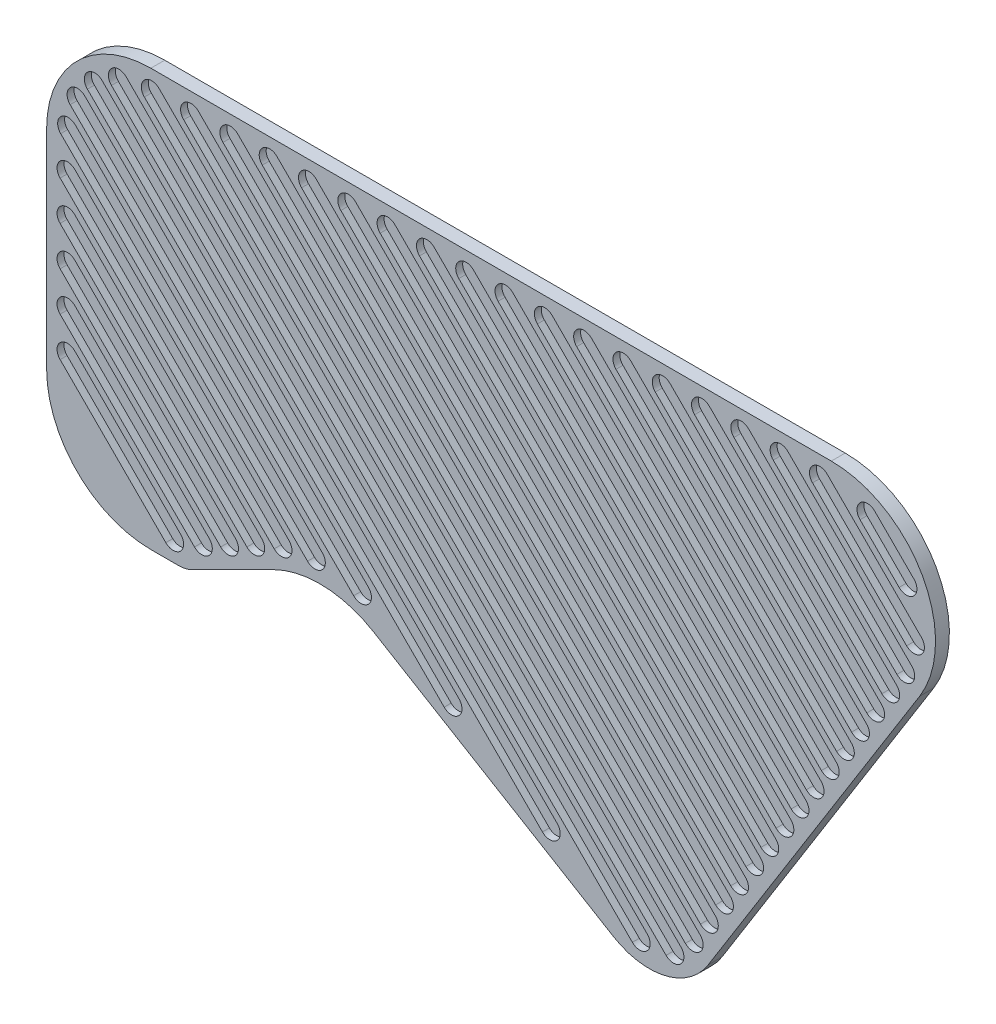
ISO-10303-21;
HEADER;
FILE_DESCRIPTION(('STEP AP214'),'2;1');
FILE_NAME('part.step','',(''),(''),'','','');
FILE_SCHEMA(('AUTOMOTIVE_DESIGN { 1 0 10303 214 1 1 1 1 }'));
ENDSEC;
DATA;
#1=APPLICATION_CONTEXT('core data for automotive mechanical design processes');
#2=APPLICATION_PROTOCOL_DEFINITION('international standard','automotive_design',2000,#1);
#3=PRODUCT_CONTEXT('',#1,'mechanical');
#4=PRODUCT('Part','Part','',(#3));
#5=PRODUCT_RELATED_PRODUCT_CATEGORY('part','',(#4));
#6=PRODUCT_DEFINITION_FORMATION('','',#4);
#7=PRODUCT_DEFINITION_CONTEXT('part definition',#1,'design');
#8=PRODUCT_DEFINITION('design','',#6,#7);
#9=PRODUCT_DEFINITION_SHAPE('','',#8);
#10=(LENGTH_UNIT() NAMED_UNIT(*) SI_UNIT(.MILLI.,.METRE.));
#11=(NAMED_UNIT(*) PLANE_ANGLE_UNIT() SI_UNIT($,.RADIAN.));
#12=(NAMED_UNIT(*) SI_UNIT($,.STERADIAN.) SOLID_ANGLE_UNIT());
#13=UNCERTAINTY_MEASURE_WITH_UNIT(LENGTH_MEASURE(1.E-05),#10,'distance_accuracy_value','');
#14=(GEOMETRIC_REPRESENTATION_CONTEXT(3) GLOBAL_UNCERTAINTY_ASSIGNED_CONTEXT((#13)) GLOBAL_UNIT_ASSIGNED_CONTEXT((#10,
#11,#12)) REPRESENTATION_CONTEXT('',''));
#15=CARTESIAN_POINT('',(0.,0.,0.));
#16=DIRECTION('',(0.,0.,1.));
#17=DIRECTION('',(1.,0.,0.));
#18=AXIS2_PLACEMENT_3D('',#15,#16,#17);
#19=CARTESIAN_POINT('',(75.,225.,10.));
#20=DIRECTION('',(0.,0.,-1.));
#21=DIRECTION('',(-1.,0.,0.));
#22=AXIS2_PLACEMENT_3D('',#19,#20,#21);
#23=CYLINDRICAL_SURFACE('',#22,75.);
#24=CARTESIAN_POINT('',(75.,225.,0.));
#25=DIRECTION('',(0.,0.,1.));
#26=DIRECTION('',(-1.,0.,0.));
#27=AXIS2_PLACEMENT_3D('',#24,#25,#26);
#28=CIRCLE('',#27,75.);
#29=CARTESIAN_POINT('',(75.,300.,0.));
#30=VERTEX_POINT('',#29);
#31=CARTESIAN_POINT('',(0.,225.,0.));
#32=VERTEX_POINT('',#31);
#33=EDGE_CURVE('E1685',#30,#32,#28,.T.);
#34=ORIENTED_EDGE('',*,*,#33,.T.);
#35=DIRECTION('',(0.,0.,-1.));
#36=VECTOR('',#35,1.);
#37=CARTESIAN_POINT('',(0.,225.,10.));
#38=LINE('',#37,#36);
#39=CARTESIAN_POINT('',(0.,225.,10.));
#40=VERTEX_POINT('',#39);
#41=EDGE_CURVE('E11',#40,#32,#38,.T.);
#42=ORIENTED_EDGE('',*,*,#41,.F.);
#43=CARTESIAN_POINT('',(75.,225.,10.));
#44=DIRECTION('',(0.,0.,1.));
#45=DIRECTION('',(-1.,0.,0.));
#46=AXIS2_PLACEMENT_3D('',#43,#44,#45);
#47=CIRCLE('',#46,75.);
#48=CARTESIAN_POINT('',(75.,300.,10.));
#49=VERTEX_POINT('',#48);
#50=EDGE_CURVE('E1692',#49,#40,#47,.T.);
#51=ORIENTED_EDGE('',*,*,#50,.F.);
#52=DIRECTION('',(0.,0.,-1.));
#53=VECTOR('',#52,1.);
#54=CARTESIAN_POINT('',(75.,300.,10.));
#55=LINE('',#54,#53);
#56=EDGE_CURVE('E1718',#49,#30,#55,.T.);
#57=ORIENTED_EDGE('',*,*,#56,.T.);
#58=EDGE_LOOP('',(#34,#42,#51,#57));
#59=FACE_BOUND('',#58,.T.);
#60=ADVANCED_FACE('F31',(#59),#23,.T.);
#61=CARTESIAN_POINT('',(0.,75.,10.));
#62=DIRECTION('',(1.,0.,0.));
#63=DIRECTION('',(0.,0.,-1.));
#64=AXIS2_PLACEMENT_3D('',#61,#62,#63);
#65=PLANE('',#64);
#66=DIRECTION('',(0.,-1.,0.));
#67=VECTOR('',#66,1.);
#68=CARTESIAN_POINT('',(0.,75.,0.));
#69=LINE('',#68,#67);
#70=CARTESIAN_POINT('',(0.,75.,0.));
#71=VERTEX_POINT('',#70);
#72=EDGE_CURVE('E1721',#32,#71,#69,.T.);
#73=ORIENTED_EDGE('',*,*,#72,.T.);
#74=DIRECTION('',(0.,0.,-1.));
#75=VECTOR('',#74,1.);
#76=CARTESIAN_POINT('',(0.,75.,10.));
#77=LINE('',#76,#75);
#78=CARTESIAN_POINT('',(0.,75.,10.));
#79=VERTEX_POINT('',#78);
#80=EDGE_CURVE('E38',#79,#71,#77,.T.);
#81=ORIENTED_EDGE('',*,*,#80,.F.);
#82=DIRECTION('',(0.,-1.,0.));
#83=VECTOR('',#82,1.);
#84=CARTESIAN_POINT('',(0.,75.,10.));
#85=LINE('',#84,#83);
#86=EDGE_CURVE('E1695',#40,#79,#85,.T.);
#87=ORIENTED_EDGE('',*,*,#86,.F.);
#88=ORIENTED_EDGE('',*,*,#41,.T.);
#89=EDGE_LOOP('',(#73,#81,#87,#88));
#90=FACE_BOUND('',#89,.T.);
#91=ADVANCED_FACE('F1798',(#90),#65,.F.);
#92=CARTESIAN_POINT('',(75.,75.,10.));
#93=DIRECTION('',(0.,0.,-1.));
#94=DIRECTION('',(-1.,0.,0.));
#95=AXIS2_PLACEMENT_3D('',#92,#93,#94);
#96=CYLINDRICAL_SURFACE('',#95,75.);
#97=CARTESIAN_POINT('',(75.,75.,0.));
#98=DIRECTION('',(0.,0.,1.));
#99=DIRECTION('',(1.,0.,0.));
#100=AXIS2_PLACEMENT_3D('',#97,#98,#99);
#101=CIRCLE('',#100,75.);
#102=CARTESIAN_POINT('',(75.,0.,0.));
#103=VERTEX_POINT('',#102);
#104=EDGE_CURVE('E1723',#71,#103,#101,.T.);
#105=ORIENTED_EDGE('',*,*,#104,.T.);
#106=DIRECTION('',(0.,0.,-1.));
#107=VECTOR('',#106,1.);
#108=CARTESIAN_POINT('',(75.,0.,10.));
#109=LINE('',#108,#107);
#110=CARTESIAN_POINT('',(75.,0.,10.));
#111=VERTEX_POINT('',#110);
#112=EDGE_CURVE('E1768',#111,#103,#109,.T.);
#113=ORIENTED_EDGE('',*,*,#112,.F.);
#114=CARTESIAN_POINT('',(75.,75.,10.));
#115=DIRECTION('',(0.,0.,1.));
#116=DIRECTION('',(1.,0.,0.));
#117=AXIS2_PLACEMENT_3D('',#114,#115,#116);
#118=CIRCLE('',#117,75.);
#119=EDGE_CURVE('E1698',#79,#111,#118,.T.);
#120=ORIENTED_EDGE('',*,*,#119,.F.);
#121=ORIENTED_EDGE('',*,*,#80,.T.);
#122=EDGE_LOOP('',(#105,#113,#120,#121));
#123=FACE_BOUND('',#122,.T.);
#124=ADVANCED_FACE('F1775',(#123),#96,.T.);
#125=CARTESIAN_POINT('',(95.2786404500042,0.,10.));
#126=DIRECTION('',(0.,1.,0.));
#127=DIRECTION('',(-1.,0.,0.));
#128=AXIS2_PLACEMENT_3D('',#125,#126,#127);
#129=PLANE('',#128);
#130=DIRECTION('',(1.,0.,0.));
#131=VECTOR('',#130,1.);
#132=CARTESIAN_POINT('',(95.2786404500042,0.,0.));
#133=LINE('',#132,#131);
#134=CARTESIAN_POINT('',(95.2786404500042,0.,0.));
#135=VERTEX_POINT('',#134);
#136=EDGE_CURVE('E1725',#103,#135,#133,.T.);
#137=ORIENTED_EDGE('',*,*,#136,.T.);
#138=DIRECTION('',(0.,0.,-1.));
#139=VECTOR('',#138,1.);
#140=CARTESIAN_POINT('',(95.2786404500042,0.,10.));
#141=LINE('',#140,#139);
#142=CARTESIAN_POINT('',(95.2786404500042,0.,10.));
#143=VERTEX_POINT('',#142);
#144=EDGE_CURVE('E1765',#143,#135,#141,.T.);
#145=ORIENTED_EDGE('',*,*,#144,.F.);
#146=DIRECTION('',(1.,0.,0.));
#147=VECTOR('',#146,1.);
#148=CARTESIAN_POINT('',(95.2786404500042,0.,10.));
#149=LINE('',#148,#147);
#150=EDGE_CURVE('E1700',#111,#143,#149,.T.);
#151=ORIENTED_EDGE('',*,*,#150,.F.);
#152=ORIENTED_EDGE('',*,*,#112,.T.);
#153=EDGE_LOOP('',(#137,#145,#151,#152));
#154=FACE_BOUND('',#153,.T.);
#155=ADVANCED_FACE('F1786',(#154),#129,.F.);
#156=CARTESIAN_POINT('',(95.2786404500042,20.,10.));
#157=DIRECTION('',(0.,0.,-1.));
#158=DIRECTION('',(-1.,0.,0.));
#159=AXIS2_PLACEMENT_3D('',#156,#157,#158);
#160=CYLINDRICAL_SURFACE('',#159,20.);
#161=CARTESIAN_POINT('',(95.2786404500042,20.,0.));
#162=DIRECTION('',(0.,0.,1.));
#163=DIRECTION('',(-1.,0.,0.));
#164=AXIS2_PLACEMENT_3D('',#161,#162,#163);
#165=CIRCLE('',#164,20.);
#166=CARTESIAN_POINT('',(104.222912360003,2.11145618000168,0.));
#167=VERTEX_POINT('',#166);
#168=EDGE_CURVE('E1727',#135,#167,#165,.T.);
#169=ORIENTED_EDGE('',*,*,#168,.T.);
#170=DIRECTION('',(0.,0.,-1.));
#171=VECTOR('',#170,1.);
#172=CARTESIAN_POINT('',(104.222912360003,2.11145618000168,10.));
#173=LINE('',#172,#171);
#174=CARTESIAN_POINT('',(104.222912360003,2.11145618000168,10.));
#175=VERTEX_POINT('',#174);
#176=EDGE_CURVE('E1762',#175,#167,#173,.T.);
#177=ORIENTED_EDGE('',*,*,#176,.F.);
#178=CARTESIAN_POINT('',(95.2786404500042,20.,10.));
#179=DIRECTION('',(0.,0.,1.));
#180=DIRECTION('',(-1.,0.,0.));
#181=AXIS2_PLACEMENT_3D('',#178,#179,#180);
#182=CIRCLE('',#181,20.);
#183=EDGE_CURVE('E1702',#143,#175,#182,.T.);
#184=ORIENTED_EDGE('',*,*,#183,.F.);
#185=ORIENTED_EDGE('',*,*,#144,.T.);
#186=EDGE_LOOP('',(#169,#177,#184,#185));
#187=FACE_BOUND('',#186,.T.);
#188=ADVANCED_FACE('F1790',(#187),#160,.T.);
#189=CARTESIAN_POINT('',(163.175590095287,31.5877950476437,10.));
#190=DIRECTION('',(-0.447213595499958,0.894427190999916,0.));
#191=DIRECTION('',(-0.894427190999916,-0.447213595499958,0.));
#192=AXIS2_PLACEMENT_3D('',#189,#190,#191);
#193=PLANE('',#192);
#194=DIRECTION('',(0.894427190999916,0.447213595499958,0.));
#195=VECTOR('',#194,1.);
#196=CARTESIAN_POINT('',(163.175590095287,31.5877950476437,0.));
#197=LINE('',#196,#195);
#198=CARTESIAN_POINT('',(163.175590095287,31.5877950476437,0.));
#199=VERTEX_POINT('',#198);
#200=EDGE_CURVE('E1729',#167,#199,#197,.T.);
#201=ORIENTED_EDGE('',*,*,#200,.T.);
#202=DIRECTION('',(0.,0.,-1.));
#203=VECTOR('',#202,1.);
#204=CARTESIAN_POINT('',(163.175590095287,31.5877950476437,10.));
#205=LINE('',#204,#203);
#206=CARTESIAN_POINT('',(163.175590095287,31.5877950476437,10.));
#207=VERTEX_POINT('',#206);
#208=EDGE_CURVE('E1759',#207,#199,#205,.T.);
#209=ORIENTED_EDGE('',*,*,#208,.F.);
#210=DIRECTION('',(0.894427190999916,0.447213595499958,0.));
#211=VECTOR('',#210,1.);
#212=CARTESIAN_POINT('',(163.175590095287,31.5877950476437,10.));
#213=LINE('',#212,#211);
#214=EDGE_CURVE('E1704',#175,#207,#213,.T.);
#215=ORIENTED_EDGE('',*,*,#214,.F.);
#216=ORIENTED_EDGE('',*,*,#176,.T.);
#217=EDGE_LOOP('',(#201,#209,#215,#216));
#218=FACE_BOUND('',#217,.T.);
#219=ADVANCED_FACE('F1831',(#218),#193,.F.);
#220=CARTESIAN_POINT('',(196.716609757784,-35.49424427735,10.));
#221=DIRECTION('',(0.,0.,-1.));
#222=DIRECTION('',(-1.,0.,0.));
#223=AXIS2_PLACEMENT_3D('',#220,#221,#222);
#224=CYLINDRICAL_SURFACE('',#223,75.);
#225=CARTESIAN_POINT('',(196.716609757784,-35.49424427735,0.));
#226=DIRECTION('',(0.,0.,-1.));
#227=DIRECTION('',(1.,0.,0.));
#228=AXIS2_PLACEMENT_3D('',#225,#226,#227);
#229=CIRCLE('',#228,75.);
#230=CARTESIAN_POINT('',(235.303791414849,28.8177251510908,0.));
#231=VERTEX_POINT('',#230);
#232=EDGE_CURVE('E1731',#199,#231,#229,.T.);
#233=ORIENTED_EDGE('',*,*,#232,.T.);
#234=DIRECTION('',(0.,0.,-1.));
#235=VECTOR('',#234,1.);
#236=CARTESIAN_POINT('',(235.303791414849,28.8177251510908,10.));
#237=LINE('',#236,#235);
#238=CARTESIAN_POINT('',(235.303791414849,28.8177251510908,10.));
#239=VERTEX_POINT('',#238);
#240=EDGE_CURVE('E1756',#239,#231,#237,.T.);
#241=ORIENTED_EDGE('',*,*,#240,.F.);
#242=CARTESIAN_POINT('',(196.716609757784,-35.49424427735,10.));
#243=DIRECTION('',(0.,0.,-1.));
#244=DIRECTION('',(1.,0.,0.));
#245=AXIS2_PLACEMENT_3D('',#242,#243,#244);
#246=CIRCLE('',#245,75.);
#247=EDGE_CURVE('E1706',#207,#239,#246,.T.);
#248=ORIENTED_EDGE('',*,*,#247,.F.);
#249=ORIENTED_EDGE('',*,*,#208,.T.);
#250=EDGE_LOOP('',(#233,#241,#248,#249));
#251=FACE_BOUND('',#250,.T.);
#252=ADVANCED_FACE('F1829',(#251),#224,.F.);
#253=CARTESIAN_POINT('',(407.897806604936,-74.7386839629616,10.));
#254=DIRECTION('',(0.514495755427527,0.857492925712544,0.));
#255=DIRECTION('',(-0.857492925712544,0.514495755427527,0.));
#256=AXIS2_PLACEMENT_3D('',#253,#254,#255);
#257=PLANE('',#256);
#258=DIRECTION('',(0.857492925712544,-0.514495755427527,0.));
#259=VECTOR('',#258,1.);
#260=CARTESIAN_POINT('',(407.897806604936,-74.7386839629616,0.));
#261=LINE('',#260,#259);
#262=CARTESIAN_POINT('',(407.897806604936,-74.7386839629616,0.));
#263=VERTEX_POINT('',#262);
#264=EDGE_CURVE('E1733',#231,#263,#261,.T.);
#265=ORIENTED_EDGE('',*,*,#264,.T.);
#266=DIRECTION('',(0.,0.,-1.));
#267=VECTOR('',#266,1.);
#268=CARTESIAN_POINT('',(407.897806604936,-74.7386839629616,10.));
#269=LINE('',#268,#267);
#270=CARTESIAN_POINT('',(407.897806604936,-74.7386839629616,10.));
#271=VERTEX_POINT('',#270);
#272=EDGE_CURVE('E1753',#271,#263,#269,.T.);
#273=ORIENTED_EDGE('',*,*,#272,.F.);
#274=DIRECTION('',(0.857492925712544,-0.514495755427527,0.));
#275=VECTOR('',#274,1.);
#276=CARTESIAN_POINT('',(407.897806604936,-74.7386839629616,10.));
#277=LINE('',#276,#275);
#278=EDGE_CURVE('E1708',#239,#271,#277,.T.);
#279=ORIENTED_EDGE('',*,*,#278,.F.);
#280=ORIENTED_EDGE('',*,*,#240,.T.);
#281=EDGE_LOOP('',(#265,#273,#279,#280));
#282=FACE_BOUND('',#281,.T.);
#283=ADVANCED_FACE('F1825',(#282),#257,.F.);
#284=CARTESIAN_POINT('',(433.622594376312,-31.8640376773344,10.));
#285=DIRECTION('',(0.,0.,-1.));
#286=DIRECTION('',(-1.,0.,0.));
#287=AXIS2_PLACEMENT_3D('',#284,#285,#286);
#288=CYLINDRICAL_SURFACE('',#287,50.);
#289=CARTESIAN_POINT('',(433.622594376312,-31.8640376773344,0.));
#290=DIRECTION('',(0.,0.,1.));
#291=DIRECTION('',(-1.,0.,0.));
#292=AXIS2_PLACEMENT_3D('',#289,#290,#291);
#293=CIRCLE('',#292,50.);
#294=CARTESIAN_POINT('',(476.022509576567,-58.3639846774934,0.));
#295=VERTEX_POINT('',#294);
#296=EDGE_CURVE('E1735',#263,#295,#293,.T.);
#297=ORIENTED_EDGE('',*,*,#296,.T.);
#298=DIRECTION('',(0.,0.,-1.));
#299=VECTOR('',#298,1.);
#300=CARTESIAN_POINT('',(476.022509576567,-58.3639846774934,10.));
#301=LINE('',#300,#299);
#302=CARTESIAN_POINT('',(476.022509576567,-58.3639846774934,10.));
#303=VERTEX_POINT('',#302);
#304=EDGE_CURVE('E1750',#303,#295,#301,.T.);
#305=ORIENTED_EDGE('',*,*,#304,.F.);
#306=CARTESIAN_POINT('',(433.622594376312,-31.8640376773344,10.));
#307=DIRECTION('',(0.,0.,1.));
#308=DIRECTION('',(-1.,0.,0.));
#309=AXIS2_PLACEMENT_3D('',#306,#307,#308);
#310=CIRCLE('',#309,50.);
#311=EDGE_CURVE('E1710',#271,#303,#310,.T.);
#312=ORIENTED_EDGE('',*,*,#311,.F.);
#313=ORIENTED_EDGE('',*,*,#272,.T.);
#314=EDGE_LOOP('',(#297,#305,#312,#313));
#315=FACE_BOUND('',#314,.T.);
#316=ADVANCED_FACE('F1820',(#315),#288,.T.);
#317=CARTESIAN_POINT('',(628.281299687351,185.250079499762,10.));
#318=DIRECTION('',(-0.847998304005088,0.52999894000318,0.));
#319=DIRECTION('',(-0.52999894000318,-0.847998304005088,0.));
#320=AXIS2_PLACEMENT_3D('',#317,#318,#319);
#321=PLANE('',#320);
#322=DIRECTION('',(0.52999894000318,0.847998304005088,0.));
#323=VECTOR('',#322,1.);
#324=CARTESIAN_POINT('',(628.281299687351,185.250079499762,0.));
#325=LINE('',#324,#323);
#326=CARTESIAN_POINT('',(628.281299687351,185.250079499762,0.));
#327=VERTEX_POINT('',#326);
#328=EDGE_CURVE('E1737',#295,#327,#325,.T.);
#329=ORIENTED_EDGE('',*,*,#328,.T.);
#330=DIRECTION('',(0.,0.,-1.));
#331=VECTOR('',#330,1.);
#332=CARTESIAN_POINT('',(628.281299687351,185.250079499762,10.));
#333=LINE('',#332,#331);
#334=CARTESIAN_POINT('',(628.281299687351,185.250079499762,10.));
#335=VERTEX_POINT('',#334);
#336=EDGE_CURVE('E1747',#335,#327,#333,.T.);
#337=ORIENTED_EDGE('',*,*,#336,.F.);
#338=DIRECTION('',(0.52999894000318,0.847998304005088,0.));
#339=VECTOR('',#338,1.);
#340=CARTESIAN_POINT('',(628.281299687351,185.250079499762,10.));
#341=LINE('',#340,#339);
#342=EDGE_CURVE('E1712',#303,#335,#341,.T.);
#343=ORIENTED_EDGE('',*,*,#342,.F.);
#344=ORIENTED_EDGE('',*,*,#304,.T.);
#345=EDGE_LOOP('',(#329,#337,#343,#344));
#346=FACE_BOUND('',#345,.T.);
#347=ADVANCED_FACE('F1814',(#346),#321,.F.);
#348=CARTESIAN_POINT('',(564.681426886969,225.,10.));
#349=DIRECTION('',(0.,0.,-1.));
#350=DIRECTION('',(-1.,0.,0.));
#351=AXIS2_PLACEMENT_3D('',#348,#349,#350);
#352=CYLINDRICAL_SURFACE('',#351,74.9999999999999);
#353=CARTESIAN_POINT('',(564.681426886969,225.,0.));
#354=DIRECTION('',(0.,0.,1.));
#355=DIRECTION('',(-1.,0.,0.));
#356=AXIS2_PLACEMENT_3D('',#353,#354,#355);
#357=CIRCLE('',#356,74.9999999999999);
#358=CARTESIAN_POINT('',(564.681426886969,300.,0.));
#359=VERTEX_POINT('',#358);
#360=EDGE_CURVE('E1739',#327,#359,#357,.T.);
#361=ORIENTED_EDGE('',*,*,#360,.T.);
#362=DIRECTION('',(0.,0.,-1.));
#363=VECTOR('',#362,1.);
#364=CARTESIAN_POINT('',(564.681426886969,300.,10.));
#365=LINE('',#364,#363);
#366=CARTESIAN_POINT('',(564.681426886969,300.,10.));
#367=VERTEX_POINT('',#366);
#368=EDGE_CURVE('E1744',#367,#359,#365,.T.);
#369=ORIENTED_EDGE('',*,*,#368,.F.);
#370=CARTESIAN_POINT('',(564.681426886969,225.,10.));
#371=DIRECTION('',(0.,0.,1.));
#372=DIRECTION('',(-1.,0.,0.));
#373=AXIS2_PLACEMENT_3D('',#370,#371,#372);
#374=CIRCLE('',#373,74.9999999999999);
#375=EDGE_CURVE('E1714',#335,#367,#374,.T.);
#376=ORIENTED_EDGE('',*,*,#375,.F.);
#377=ORIENTED_EDGE('',*,*,#336,.T.);
#378=EDGE_LOOP('',(#361,#369,#376,#377));
#379=FACE_BOUND('',#378,.T.);
#380=ADVANCED_FACE('F1810',(#379),#352,.T.);
#381=CARTESIAN_POINT('',(75.,300.,10.));
#382=DIRECTION('',(0.,-1.,0.));
#383=DIRECTION('',(0.,0.,-1.));
#384=AXIS2_PLACEMENT_3D('',#381,#382,#383);
#385=PLANE('',#384);
#386=DIRECTION('',(-1.,0.,0.));
#387=VECTOR('',#386,1.);
#388=CARTESIAN_POINT('',(75.,300.,0.));
#389=LINE('',#388,#387);
#390=EDGE_CURVE('E1696',#359,#30,#389,.T.);
#391=ORIENTED_EDGE('',*,*,#390,.T.);
#392=ORIENTED_EDGE('',*,*,#56,.F.);
#393=DIRECTION('',(-1.,0.,0.));
#394=VECTOR('',#393,1.);
#395=CARTESIAN_POINT('',(75.,300.,10.));
#396=LINE('',#395,#394);
#397=EDGE_CURVE('E1716',#367,#49,#396,.T.);
#398=ORIENTED_EDGE('',*,*,#397,.F.);
#399=ORIENTED_EDGE('',*,*,#368,.T.);
#400=EDGE_LOOP('',(#391,#392,#398,#399));
#401=FACE_BOUND('',#400,.T.);
#402=ADVANCED_FACE('F1805',(#401),#385,.F.);
#403=CARTESIAN_POINT('',(75.,225.,10.));
#404=DIRECTION('',(0.,0.,-1.));
#405=DIRECTION('',(-1.,0.,0.));
#406=AXIS2_PLACEMENT_3D('',#403,#404,#405);
#407=PLANE('',#406);
#408=DIRECTION('',(0.707106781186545,-0.70710678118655,0.));
#409=VECTOR('',#408,1.);
#410=CARTESIAN_POINT('',(585.350965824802,273.783773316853,10.));
#411=LINE('',#410,#409);
#412=CARTESIAN_POINT('',(585.350965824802,273.783773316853,10.));
#413=VERTEX_POINT('',#412);
#414=CARTESIAN_POINT('',(613.465200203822,245.669538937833,10.));
#415=VERTEX_POINT('',#414);
#416=EDGE_CURVE('E820',#413,#415,#411,.T.);
#417=ORIENTED_EDGE('',*,*,#416,.F.);
#418=CARTESIAN_POINT('',(590.654266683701,279.087074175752,10.));
#419=DIRECTION('',(0.,0.,1.));
#420=DIRECTION('',(1.,0.,0.));
#421=AXIS2_PLACEMENT_3D('',#418,#419,#420);
#422=CIRCLE('',#421,7.49999999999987);
#423=CARTESIAN_POINT('',(595.9575675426,284.390375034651,10.));
#424=VERTEX_POINT('',#423);
#425=EDGE_CURVE('E45',#424,#413,#422,.T.);
#426=ORIENTED_EDGE('',*,*,#425,.F.);
#427=DIRECTION('',(-0.707106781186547,0.707106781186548,0.));
#428=VECTOR('',#427,1.);
#429=CARTESIAN_POINT('',(595.9575675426,284.390375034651,10.));
#430=LINE('',#429,#428);
#431=CARTESIAN_POINT('',(624.07180192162,256.276140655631,10.));
#432=VERTEX_POINT('',#431);
#433=EDGE_CURVE('E811',#432,#424,#430,.T.);
#434=ORIENTED_EDGE('',*,*,#433,.F.);
#435=CARTESIAN_POINT('',(618.768501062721,250.972839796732,10.));
#436=DIRECTION('',(0.,0.,1.));
#437=DIRECTION('',(1.,0.,0.));
#438=AXIS2_PLACEMENT_3D('',#435,#436,#437);
#439=CIRCLE('',#438,7.49999999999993);
#440=EDGE_CURVE('E814',#415,#432,#439,.T.);
#441=ORIENTED_EDGE('',*,*,#440,.F.);
#442=EDGE_LOOP('',(#417,#426,#434,#441));
#443=FACE_BOUND('',#442,.T.);
#444=DIRECTION('',(0.707106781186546,-0.707106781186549,0.));
#445=VECTOR('',#444,1.);
#446=CARTESIAN_POINT('',(551.153768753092,279.696699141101,10.));
#447=LINE('',#446,#445);
#448=CARTESIAN_POINT('',(551.153768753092,279.696699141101,10.));
#449=VERTEX_POINT('',#448);
#450=CARTESIAN_POINT('',(618.878753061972,211.97171483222,10.));
#451=VERTEX_POINT('',#450);
#452=EDGE_CURVE('E844',#449,#451,#447,.T.);
#453=ORIENTED_EDGE('',*,*,#452,.F.);
#454=CARTESIAN_POINT('',(556.457069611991,285.,10.));
#455=DIRECTION('',(0.,0.,1.));
#456=DIRECTION('',(1.,0.,0.));
#457=AXIS2_PLACEMENT_3D('',#454,#455,#456);
#458=CIRCLE('',#457,7.50000000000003);
#459=CARTESIAN_POINT('',(561.76037047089,290.303300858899,10.));
#460=VERTEX_POINT('',#459);
#461=EDGE_CURVE('E53',#460,#449,#458,.T.);
#462=ORIENTED_EDGE('',*,*,#461,.F.);
#463=DIRECTION('',(-0.707106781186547,0.707106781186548,0.));
#464=VECTOR('',#463,1.);
#465=CARTESIAN_POINT('',(561.76037047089,290.303300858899,10.));
#466=LINE('',#465,#464);
#467=CARTESIAN_POINT('',(629.485354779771,222.578316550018,10.));
#468=VERTEX_POINT('',#467);
#469=EDGE_CURVE('E833',#468,#460,#466,.T.);
#470=ORIENTED_EDGE('',*,*,#469,.F.);
#471=CARTESIAN_POINT('',(624.182053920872,217.275015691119,10.));
#472=DIRECTION('',(0.,0.,1.));
#473=DIRECTION('',(1.,0.,0.));
#474=AXIS2_PLACEMENT_3D('',#471,#472,#473);
#475=CIRCLE('',#474,7.50000000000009);
#476=EDGE_CURVE('E847',#451,#468,#475,.T.);
#477=ORIENTED_EDGE('',*,*,#476,.F.);
#478=EDGE_LOOP('',(#453,#462,#470,#477));
#479=FACE_BOUND('',#478,.T.);
#480=DIRECTION('',(0.707106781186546,-0.707106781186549,0.));
#481=VECTOR('',#480,1.);
#482=CARTESIAN_POINT('',(522.86949750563,279.696699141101,10.));
#483=LINE('',#482,#481);
#484=CARTESIAN_POINT('',(522.86949750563,279.696699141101,10.));
#485=VERTEX_POINT('',#484);
#486=CARTESIAN_POINT('',(611.891922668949,190.674273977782,10.));
#487=VERTEX_POINT('',#486);
#488=EDGE_CURVE('E875',#485,#487,#483,.T.);
#489=ORIENTED_EDGE('',*,*,#488,.F.);
#490=CARTESIAN_POINT('',(528.172798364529,285.,10.));
#491=DIRECTION('',(0.,0.,1.));
#492=DIRECTION('',(1.,0.,0.));
#493=AXIS2_PLACEMENT_3D('',#490,#491,#492);
#494=CIRCLE('',#493,7.50000000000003);
#495=CARTESIAN_POINT('',(533.476099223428,290.303300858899,10.));
#496=VERTEX_POINT('',#495);
#497=EDGE_CURVE('E854',#496,#485,#494,.T.);
#498=ORIENTED_EDGE('',*,*,#497,.F.);
#499=DIRECTION('',(-0.707106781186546,0.707106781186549,0.));
#500=VECTOR('',#499,1.);
#501=CARTESIAN_POINT('',(533.476099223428,290.303300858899,10.));
#502=LINE('',#501,#500);
#503=CARTESIAN_POINT('',(622.498524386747,201.28087569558,10.));
#504=VERTEX_POINT('',#503);
#505=EDGE_CURVE('E864',#504,#496,#502,.T.);
#506=ORIENTED_EDGE('',*,*,#505,.F.);
#507=CARTESIAN_POINT('',(617.195223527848,195.977574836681,10.));
#508=DIRECTION('',(0.,0.,1.));
#509=DIRECTION('',(1.,0.,0.));
#510=AXIS2_PLACEMENT_3D('',#507,#508,#509);
#511=CIRCLE('',#510,7.5);
#512=EDGE_CURVE('E878',#487,#504,#511,.T.);
#513=ORIENTED_EDGE('',*,*,#512,.F.);
#514=EDGE_LOOP('',(#489,#498,#506,#513));
#515=FACE_BOUND('',#514,.T.);
#516=DIRECTION('',(0.707106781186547,-0.707106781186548,0.));
#517=VECTOR('',#516,1.);
#518=CARTESIAN_POINT('',(494.585226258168,279.696699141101,10.));
#519=LINE('',#518,#517);
#520=CARTESIAN_POINT('',(494.585226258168,279.696699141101,10.));
#521=VERTEX_POINT('',#520);
#522=CARTESIAN_POINT('',(601.076154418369,173.2057709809,10.));
#523=VERTEX_POINT('',#522);
#524=EDGE_CURVE('E907',#521,#523,#519,.T.);
#525=ORIENTED_EDGE('',*,*,#524,.F.);
#526=CARTESIAN_POINT('',(499.888527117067,285.,10.));
#527=DIRECTION('',(0.,0.,1.));
#528=DIRECTION('',(1.,0.,0.));
#529=AXIS2_PLACEMENT_3D('',#526,#527,#528);
#530=CIRCLE('',#529,7.50000000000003);
#531=CARTESIAN_POINT('',(505.191827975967,290.303300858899,10.));
#532=VERTEX_POINT('',#531);
#533=EDGE_CURVE('E885',#532,#521,#530,.T.);
#534=ORIENTED_EDGE('',*,*,#533,.F.);
#535=DIRECTION('',(-0.707106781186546,0.707106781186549,0.));
#536=VECTOR('',#535,1.);
#537=CARTESIAN_POINT('',(505.191827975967,290.303300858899,10.));
#538=LINE('',#537,#536);
#539=CARTESIAN_POINT('',(611.682756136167,183.812372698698,10.));
#540=VERTEX_POINT('',#539);
#541=EDGE_CURVE('E896',#540,#532,#538,.T.);
#542=ORIENTED_EDGE('',*,*,#541,.F.);
#543=CARTESIAN_POINT('',(606.379455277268,178.509071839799,10.));
#544=DIRECTION('',(0.,0.,1.));
#545=DIRECTION('',(1.,0.,0.));
#546=AXIS2_PLACEMENT_3D('',#543,#544,#545);
#547=CIRCLE('',#546,7.49999999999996);
#548=EDGE_CURVE('E910',#523,#540,#547,.T.);
#549=ORIENTED_EDGE('',*,*,#548,.F.);
#550=EDGE_LOOP('',(#525,#534,#542,#549));
#551=FACE_BOUND('',#550,.T.);
#552=DIRECTION('',(0.707106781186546,-0.707106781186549,0.));
#553=VECTOR('',#552,1.);
#554=CARTESIAN_POINT('',(466.300955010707,279.696699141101,10.));
#555=LINE('',#554,#553);
#556=CARTESIAN_POINT('',(466.300955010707,279.696699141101,10.));
#557=VERTEX_POINT('',#556);
#558=CARTESIAN_POINT('',(590.19758855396,155.800065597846,10.));
#559=VERTEX_POINT('',#558);
#560=EDGE_CURVE('E939',#557,#559,#555,.T.);
#561=ORIENTED_EDGE('',*,*,#560,.F.);
#562=CARTESIAN_POINT('',(471.604255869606,285.,10.));
#563=DIRECTION('',(0.,0.,1.));
#564=DIRECTION('',(1.,0.,0.));
#565=AXIS2_PLACEMENT_3D('',#562,#563,#564);
#566=CIRCLE('',#565,7.49999999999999);
#567=CARTESIAN_POINT('',(476.907556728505,290.303300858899,10.));
#568=VERTEX_POINT('',#567);
#569=EDGE_CURVE('E917',#568,#557,#566,.T.);
#570=ORIENTED_EDGE('',*,*,#569,.F.);
#571=DIRECTION('',(-0.707106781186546,0.707106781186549,0.));
#572=VECTOR('',#571,1.);
#573=CARTESIAN_POINT('',(476.907556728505,290.303300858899,10.));
#574=LINE('',#573,#572);
#575=CARTESIAN_POINT('',(600.804190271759,166.406667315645,10.));
#576=VERTEX_POINT('',#575);
#577=EDGE_CURVE('E928',#576,#568,#574,.T.);
#578=ORIENTED_EDGE('',*,*,#577,.F.);
#579=CARTESIAN_POINT('',(595.50088941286,161.103366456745,10.));
#580=DIRECTION('',(0.,0.,1.));
#581=DIRECTION('',(1.,0.,0.));
#582=AXIS2_PLACEMENT_3D('',#579,#580,#581);
#583=CIRCLE('',#582,7.50000000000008);
#584=EDGE_CURVE('E942',#559,#576,#583,.T.);
#585=ORIENTED_EDGE('',*,*,#584,.F.);
#586=EDGE_LOOP('',(#561,#570,#578,#585));
#587=FACE_BOUND('',#586,.T.);
#588=DIRECTION('',(0.707106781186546,-0.707106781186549,0.));
#589=VECTOR('',#588,1.);
#590=CARTESIAN_POINT('',(438.016683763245,279.696699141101,10.));
#591=LINE('',#590,#589);
#592=CARTESIAN_POINT('',(438.016683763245,279.696699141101,10.));
#593=VERTEX_POINT('',#592);
#594=CARTESIAN_POINT('',(579.319022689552,138.394360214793,10.));
#595=VERTEX_POINT('',#594);
#596=EDGE_CURVE('E971',#593,#595,#591,.T.);
#597=ORIENTED_EDGE('',*,*,#596,.F.);
#598=CARTESIAN_POINT('',(443.319984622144,285.,10.));
#599=DIRECTION('',(0.,0.,1.));
#600=DIRECTION('',(1.,0.,0.));
#601=AXIS2_PLACEMENT_3D('',#598,#599,#600);
#602=CIRCLE('',#601,7.50000000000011);
#603=CARTESIAN_POINT('',(448.623285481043,290.303300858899,10.));
#604=VERTEX_POINT('',#603);
#605=EDGE_CURVE('E949',#604,#593,#602,.T.);
#606=ORIENTED_EDGE('',*,*,#605,.F.);
#607=DIRECTION('',(-0.707106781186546,0.707106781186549,0.));
#608=VECTOR('',#607,1.);
#609=CARTESIAN_POINT('',(448.623285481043,290.303300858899,10.));
#610=LINE('',#609,#608);
#611=CARTESIAN_POINT('',(589.92562440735,149.000961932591,10.));
#612=VERTEX_POINT('',#611);
#613=EDGE_CURVE('E960',#612,#604,#610,.T.);
#614=ORIENTED_EDGE('',*,*,#613,.F.);
#615=CARTESIAN_POINT('',(584.622323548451,143.697661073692,10.));
#616=DIRECTION('',(0.,0.,1.));
#617=DIRECTION('',(1.,0.,0.));
#618=AXIS2_PLACEMENT_3D('',#615,#616,#617);
#619=CIRCLE('',#618,7.5000000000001);
#620=EDGE_CURVE('E974',#595,#612,#619,.T.);
#621=ORIENTED_EDGE('',*,*,#620,.F.);
#622=EDGE_LOOP('',(#597,#606,#614,#621));
#623=FACE_BOUND('',#622,.T.);
#624=DIRECTION('',(0.707106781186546,-0.707106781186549,0.));
#625=VECTOR('',#624,1.);
#626=CARTESIAN_POINT('',(409.732412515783,279.696699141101,10.));
#627=LINE('',#626,#625);
#628=CARTESIAN_POINT('',(409.732412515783,279.696699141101,10.));
#629=VERTEX_POINT('',#628);
#630=CARTESIAN_POINT('',(568.440456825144,120.988654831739,10.));
#631=VERTEX_POINT('',#630);
#632=EDGE_CURVE('E1003',#629,#631,#627,.T.);
#633=ORIENTED_EDGE('',*,*,#632,.F.);
#634=CARTESIAN_POINT('',(415.035713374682,285.,10.));
#635=DIRECTION('',(0.,0.,1.));
#636=DIRECTION('',(1.,0.,0.));
#637=AXIS2_PLACEMENT_3D('',#634,#635,#636);
#638=CIRCLE('',#637,7.49999999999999);
#639=CARTESIAN_POINT('',(420.339014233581,290.303300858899,10.));
#640=VERTEX_POINT('',#639);
#641=EDGE_CURVE('E981',#640,#629,#638,.T.);
#642=ORIENTED_EDGE('',*,*,#641,.F.);
#643=DIRECTION('',(-0.707106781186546,0.707106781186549,0.));
#644=VECTOR('',#643,1.);
#645=CARTESIAN_POINT('',(420.339014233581,290.303300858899,10.));
#646=LINE('',#645,#644);
#647=CARTESIAN_POINT('',(579.047058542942,131.595256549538,10.));
#648=VERTEX_POINT('',#647);
#649=EDGE_CURVE('E992',#648,#640,#646,.T.);
#650=ORIENTED_EDGE('',*,*,#649,.F.);
#651=CARTESIAN_POINT('',(573.743757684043,126.291955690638,10.));
#652=DIRECTION('',(0.,0.,1.));
#653=DIRECTION('',(1.,0.,0.));
#654=AXIS2_PLACEMENT_3D('',#651,#652,#653);
#655=CIRCLE('',#654,7.50000000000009);
#656=EDGE_CURVE('E1006',#631,#648,#655,.T.);
#657=ORIENTED_EDGE('',*,*,#656,.F.);
#658=EDGE_LOOP('',(#633,#642,#650,#657));
#659=FACE_BOUND('',#658,.T.);
#660=DIRECTION('',(0.707106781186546,-0.707106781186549,0.));
#661=VECTOR('',#660,1.);
#662=CARTESIAN_POINT('',(381.448141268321,279.696699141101,10.));
#663=LINE('',#662,#661);
#664=CARTESIAN_POINT('',(381.448141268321,279.696699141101,10.));
#665=VERTEX_POINT('',#664);
#666=CARTESIAN_POINT('',(557.561890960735,103.582949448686,10.));
#667=VERTEX_POINT('',#666);
#668=EDGE_CURVE('E1035',#665,#667,#663,.T.);
#669=ORIENTED_EDGE('',*,*,#668,.F.);
#670=CARTESIAN_POINT('',(386.75144212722,285.,10.));
#671=DIRECTION('',(0.,0.,1.));
#672=DIRECTION('',(1.,0.,0.));
#673=AXIS2_PLACEMENT_3D('',#670,#671,#672);
#674=CIRCLE('',#673,7.50000000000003);
#675=CARTESIAN_POINT('',(392.054742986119,290.303300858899,10.));
#676=VERTEX_POINT('',#675);
#677=EDGE_CURVE('E1013',#676,#665,#674,.T.);
#678=ORIENTED_EDGE('',*,*,#677,.F.);
#679=DIRECTION('',(-0.707106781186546,0.707106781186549,0.));
#680=VECTOR('',#679,1.);
#681=CARTESIAN_POINT('',(392.054742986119,290.303300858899,10.));
#682=LINE('',#681,#680);
#683=CARTESIAN_POINT('',(568.168492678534,114.189551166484,10.));
#684=VERTEX_POINT('',#683);
#685=EDGE_CURVE('E1024',#684,#676,#682,.T.);
#686=ORIENTED_EDGE('',*,*,#685,.F.);
#687=CARTESIAN_POINT('',(562.865191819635,108.886250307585,10.));
#688=DIRECTION('',(0.,0.,1.));
#689=DIRECTION('',(1.,0.,0.));
#690=AXIS2_PLACEMENT_3D('',#687,#688,#689);
#691=CIRCLE('',#690,7.50000000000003);
#692=EDGE_CURVE('E1038',#667,#684,#691,.T.);
#693=ORIENTED_EDGE('',*,*,#692,.F.);
#694=EDGE_LOOP('',(#669,#678,#686,#693));
#695=FACE_BOUND('',#694,.T.);
#696=DIRECTION('',(0.707106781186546,-0.707106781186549,0.));
#697=VECTOR('',#696,1.);
#698=CARTESIAN_POINT('',(353.163870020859,279.696699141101,10.));
#699=LINE('',#698,#697);
#700=CARTESIAN_POINT('',(353.163870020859,279.696699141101,10.));
#701=VERTEX_POINT('',#700);
#702=CARTESIAN_POINT('',(546.683325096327,86.1772440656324,10.));
#703=VERTEX_POINT('',#702);
#704=EDGE_CURVE('E1067',#701,#703,#699,.T.);
#705=ORIENTED_EDGE('',*,*,#704,.F.);
#706=CARTESIAN_POINT('',(358.467170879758,285.,10.));
#707=DIRECTION('',(0.,0.,1.));
#708=DIRECTION('',(1.,0.,0.));
#709=AXIS2_PLACEMENT_3D('',#706,#707,#708);
#710=CIRCLE('',#709,7.49999999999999);
#711=CARTESIAN_POINT('',(363.770471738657,290.303300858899,10.));
#712=VERTEX_POINT('',#711);
#713=EDGE_CURVE('E1045',#712,#701,#710,.T.);
#714=ORIENTED_EDGE('',*,*,#713,.F.);
#715=DIRECTION('',(-0.707106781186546,0.707106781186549,0.));
#716=VECTOR('',#715,1.);
#717=CARTESIAN_POINT('',(363.770471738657,290.303300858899,10.));
#718=LINE('',#717,#716);
#719=CARTESIAN_POINT('',(557.289926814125,96.7838457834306,10.));
#720=VERTEX_POINT('',#719);
#721=EDGE_CURVE('E1056',#720,#712,#718,.T.);
#722=ORIENTED_EDGE('',*,*,#721,.F.);
#723=CARTESIAN_POINT('',(551.986625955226,91.4805449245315,10.));
#724=DIRECTION('',(0.,0.,1.));
#725=DIRECTION('',(1.,0.,0.));
#726=AXIS2_PLACEMENT_3D('',#723,#724,#725);
#727=CIRCLE('',#726,7.50000000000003);
#728=EDGE_CURVE('E1070',#703,#720,#727,.T.);
#729=ORIENTED_EDGE('',*,*,#728,.F.);
#730=EDGE_LOOP('',(#705,#714,#722,#729));
#731=FACE_BOUND('',#730,.T.);
#732=DIRECTION('',(0.707106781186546,-0.707106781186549,0.));
#733=VECTOR('',#732,1.);
#734=CARTESIAN_POINT('',(324.879598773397,279.696699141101,10.));
#735=LINE('',#734,#733);
#736=CARTESIAN_POINT('',(324.879598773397,279.696699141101,10.));
#737=VERTEX_POINT('',#736);
#738=CARTESIAN_POINT('',(535.804759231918,68.7715386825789,10.));
#739=VERTEX_POINT('',#738);
#740=EDGE_CURVE('E1099',#737,#739,#735,.T.);
#741=ORIENTED_EDGE('',*,*,#740,.F.);
#742=CARTESIAN_POINT('',(330.182899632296,285.,10.));
#743=DIRECTION('',(0.,0.,1.));
#744=DIRECTION('',(1.,0.,0.));
#745=AXIS2_PLACEMENT_3D('',#742,#743,#744);
#746=CIRCLE('',#745,7.49999999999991);
#747=CARTESIAN_POINT('',(335.486200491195,290.303300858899,10.));
#748=VERTEX_POINT('',#747);
#749=EDGE_CURVE('E1077',#748,#737,#746,.T.);
#750=ORIENTED_EDGE('',*,*,#749,.F.);
#751=DIRECTION('',(-0.707106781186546,0.707106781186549,0.));
#752=VECTOR('',#751,1.);
#753=CARTESIAN_POINT('',(335.486200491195,290.303300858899,10.));
#754=LINE('',#753,#752);
#755=CARTESIAN_POINT('',(546.411360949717,79.378140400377,10.));
#756=VERTEX_POINT('',#755);
#757=EDGE_CURVE('E1088',#756,#748,#754,.T.);
#758=ORIENTED_EDGE('',*,*,#757,.F.);
#759=CARTESIAN_POINT('',(541.108060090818,74.074839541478,10.));
#760=DIRECTION('',(0.,0.,1.));
#761=DIRECTION('',(1.,0.,0.));
#762=AXIS2_PLACEMENT_3D('',#759,#760,#761);
#763=CIRCLE('',#762,7.49999999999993);
#764=EDGE_CURVE('E1102',#739,#756,#763,.T.);
#765=ORIENTED_EDGE('',*,*,#764,.F.);
#766=EDGE_LOOP('',(#741,#750,#758,#765));
#767=FACE_BOUND('',#766,.T.);
#768=DIRECTION('',(0.707106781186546,-0.707106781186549,0.));
#769=VECTOR('',#768,1.);
#770=CARTESIAN_POINT('',(296.595327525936,279.696699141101,10.));
#771=LINE('',#770,#769);
#772=CARTESIAN_POINT('',(296.595327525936,279.696699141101,10.));
#773=VERTEX_POINT('',#772);
#774=CARTESIAN_POINT('',(524.92619336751,51.3658332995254,10.));
#775=VERTEX_POINT('',#774);
#776=EDGE_CURVE('E1131',#773,#775,#771,.T.);
#777=ORIENTED_EDGE('',*,*,#776,.F.);
#778=CARTESIAN_POINT('',(301.898628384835,285.,10.));
#779=DIRECTION('',(0.,0.,1.));
#780=DIRECTION('',(1.,0.,0.));
#781=AXIS2_PLACEMENT_3D('',#778,#779,#780);
#782=CIRCLE('',#781,7.49999999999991);
#783=CARTESIAN_POINT('',(307.201929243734,290.303300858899,10.));
#784=VERTEX_POINT('',#783);
#785=EDGE_CURVE('E1109',#784,#773,#782,.T.);
#786=ORIENTED_EDGE('',*,*,#785,.F.);
#787=DIRECTION('',(-0.707106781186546,0.707106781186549,0.));
#788=VECTOR('',#787,1.);
#789=CARTESIAN_POINT('',(307.201929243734,290.303300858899,10.));
#790=LINE('',#789,#788);
#791=CARTESIAN_POINT('',(535.532795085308,61.9724350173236,10.));
#792=VERTEX_POINT('',#791);
#793=EDGE_CURVE('E1120',#792,#784,#790,.T.);
#794=ORIENTED_EDGE('',*,*,#793,.F.);
#795=CARTESIAN_POINT('',(530.229494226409,56.6691341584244,10.));
#796=DIRECTION('',(0.,0.,1.));
#797=DIRECTION('',(1.,0.,0.));
#798=AXIS2_PLACEMENT_3D('',#795,#796,#797);
#799=CIRCLE('',#798,7.49999999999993);
#800=EDGE_CURVE('E1134',#775,#792,#799,.T.);
#801=ORIENTED_EDGE('',*,*,#800,.F.);
#802=EDGE_LOOP('',(#777,#786,#794,#801));
#803=FACE_BOUND('',#802,.T.);
#804=DIRECTION('',(0.707106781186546,-0.707106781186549,0.));
#805=VECTOR('',#804,1.);
#806=CARTESIAN_POINT('',(268.311056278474,279.696699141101,10.));
#807=LINE('',#806,#805);
#808=CARTESIAN_POINT('',(268.311056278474,279.696699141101,10.));
#809=VERTEX_POINT('',#808);
#810=CARTESIAN_POINT('',(514.047627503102,33.9601279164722,10.));
#811=VERTEX_POINT('',#810);
#812=EDGE_CURVE('E1163',#809,#811,#807,.T.);
#813=ORIENTED_EDGE('',*,*,#812,.F.);
#814=CARTESIAN_POINT('',(273.614357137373,285.,10.));
#815=DIRECTION('',(0.,0.,1.));
#816=DIRECTION('',(1.,0.,0.));
#817=AXIS2_PLACEMENT_3D('',#814,#815,#816);
#818=CIRCLE('',#817,7.49999999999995);
#819=CARTESIAN_POINT('',(278.917657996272,290.303300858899,10.));
#820=VERTEX_POINT('',#819);
#821=EDGE_CURVE('E1141',#820,#809,#818,.T.);
#822=ORIENTED_EDGE('',*,*,#821,.F.);
#823=DIRECTION('',(-0.707106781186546,0.707106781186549,0.));
#824=VECTOR('',#823,1.);
#825=CARTESIAN_POINT('',(278.917657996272,290.303300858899,10.));
#826=LINE('',#825,#824);
#827=CARTESIAN_POINT('',(524.6542292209,44.5667296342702,10.));
#828=VERTEX_POINT('',#827);
#829=EDGE_CURVE('E1152',#828,#820,#826,.T.);
#830=ORIENTED_EDGE('',*,*,#829,.F.);
#831=CARTESIAN_POINT('',(519.350928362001,39.2634287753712,10.));
#832=DIRECTION('',(0.,0.,1.));
#833=DIRECTION('',(1.,0.,0.));
#834=AXIS2_PLACEMENT_3D('',#831,#832,#833);
#835=CIRCLE('',#834,7.49999999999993);
#836=EDGE_CURVE('E1166',#811,#828,#835,.T.);
#837=ORIENTED_EDGE('',*,*,#836,.F.);
#838=EDGE_LOOP('',(#813,#822,#830,#837));
#839=FACE_BOUND('',#838,.T.);
#840=DIRECTION('',(0.707106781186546,-0.707106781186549,0.));
#841=VECTOR('',#840,1.);
#842=CARTESIAN_POINT('',(240.026785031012,279.696699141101,10.));
#843=LINE('',#842,#841);
#844=CARTESIAN_POINT('',(240.026785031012,279.696699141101,10.));
#845=VERTEX_POINT('',#844);
#846=CARTESIAN_POINT('',(503.169061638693,16.5544225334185,10.));
#847=VERTEX_POINT('',#846);
#848=EDGE_CURVE('E1195',#845,#847,#843,.T.);
#849=ORIENTED_EDGE('',*,*,#848,.F.);
#850=CARTESIAN_POINT('',(245.330085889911,285.,10.));
#851=DIRECTION('',(0.,0.,1.));
#852=DIRECTION('',(1.,0.,0.));
#853=AXIS2_PLACEMENT_3D('',#850,#851,#852);
#854=CIRCLE('',#853,7.5);
#855=CARTESIAN_POINT('',(250.63338674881,290.303300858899,10.));
#856=VERTEX_POINT('',#855);
#857=EDGE_CURVE('E1173',#856,#845,#854,.T.);
#858=ORIENTED_EDGE('',*,*,#857,.F.);
#859=DIRECTION('',(-0.707106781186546,0.707106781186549,0.));
#860=VECTOR('',#859,1.);
#861=CARTESIAN_POINT('',(250.63338674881,290.303300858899,10.));
#862=LINE('',#861,#860);
#863=CARTESIAN_POINT('',(513.775663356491,27.1610242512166,10.));
#864=VERTEX_POINT('',#863);
#865=EDGE_CURVE('E1184',#864,#856,#862,.T.);
#866=ORIENTED_EDGE('',*,*,#865,.F.);
#867=CARTESIAN_POINT('',(508.472362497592,21.8577233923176,10.));
#868=DIRECTION('',(0.,0.,1.));
#869=DIRECTION('',(1.,0.,0.));
#870=AXIS2_PLACEMENT_3D('',#867,#868,#869);
#871=CIRCLE('',#870,7.49999999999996);
#872=EDGE_CURVE('E1198',#847,#864,#871,.T.);
#873=ORIENTED_EDGE('',*,*,#872,.F.);
#874=EDGE_LOOP('',(#849,#858,#866,#873));
#875=FACE_BOUND('',#874,.T.);
#876=DIRECTION('',(0.707106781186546,-0.707106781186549,0.));
#877=VECTOR('',#876,1.);
#878=CARTESIAN_POINT('',(211.74251378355,279.696699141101,10.));
#879=LINE('',#878,#877);
#880=CARTESIAN_POINT('',(211.74251378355,279.696699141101,10.));
#881=VERTEX_POINT('',#880);
#882=CARTESIAN_POINT('',(492.290495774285,-0.851282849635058,10.));
#883=VERTEX_POINT('',#882);
#884=EDGE_CURVE('E1227',#881,#883,#879,.T.);
#885=ORIENTED_EDGE('',*,*,#884,.F.);
#886=CARTESIAN_POINT('',(217.045814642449,285.,10.));
#887=DIRECTION('',(0.,0.,1.));
#888=DIRECTION('',(1.,0.,0.));
#889=AXIS2_PLACEMENT_3D('',#886,#887,#888);
#890=CIRCLE('',#889,7.49999999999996);
#891=CARTESIAN_POINT('',(222.349115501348,290.303300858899,10.));
#892=VERTEX_POINT('',#891);
#893=EDGE_CURVE('E1205',#892,#881,#890,.T.);
#894=ORIENTED_EDGE('',*,*,#893,.F.);
#895=DIRECTION('',(-0.707106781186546,0.707106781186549,0.));
#896=VECTOR('',#895,1.);
#897=CARTESIAN_POINT('',(222.349115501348,290.303300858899,10.));
#898=LINE('',#897,#896);
#899=CARTESIAN_POINT('',(502.897097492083,9.75531886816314,10.));
#900=VERTEX_POINT('',#899);
#901=EDGE_CURVE('E1216',#900,#892,#898,.T.);
#902=ORIENTED_EDGE('',*,*,#901,.F.);
#903=CARTESIAN_POINT('',(497.593796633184,4.45201800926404,10.));
#904=DIRECTION('',(0.,0.,1.));
#905=DIRECTION('',(1.,0.,0.));
#906=AXIS2_PLACEMENT_3D('',#903,#904,#905);
#907=CIRCLE('',#906,7.50000000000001);
#908=EDGE_CURVE('E1230',#883,#900,#907,.T.);
#909=ORIENTED_EDGE('',*,*,#908,.F.);
#910=EDGE_LOOP('',(#885,#894,#902,#909));
#911=FACE_BOUND('',#910,.T.);
#912=DIRECTION('',(0.707106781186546,-0.707106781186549,0.));
#913=VECTOR('',#912,1.);
#914=CARTESIAN_POINT('',(183.458242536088,279.696699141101,10.));
#915=LINE('',#914,#913);
#916=CARTESIAN_POINT('',(183.458242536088,279.696699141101,10.));
#917=VERTEX_POINT('',#916);
#918=CARTESIAN_POINT('',(481.411929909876,-18.2569882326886,10.));
#919=VERTEX_POINT('',#918);
#920=EDGE_CURVE('E1259',#917,#919,#915,.T.);
#921=ORIENTED_EDGE('',*,*,#920,.F.);
#922=CARTESIAN_POINT('',(188.761543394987,285.,10.));
#923=DIRECTION('',(0.,0.,1.));
#924=DIRECTION('',(1.,0.,0.));
#925=AXIS2_PLACEMENT_3D('',#922,#923,#924);
#926=CIRCLE('',#925,7.49999999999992);
#927=CARTESIAN_POINT('',(194.064844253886,290.303300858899,10.));
#928=VERTEX_POINT('',#927);
#929=EDGE_CURVE('E1237',#928,#917,#926,.T.);
#930=ORIENTED_EDGE('',*,*,#929,.F.);
#931=DIRECTION('',(-0.707106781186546,0.707106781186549,0.));
#932=VECTOR('',#931,1.);
#933=CARTESIAN_POINT('',(194.064844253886,290.303300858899,10.));
#934=LINE('',#933,#932);
#935=CARTESIAN_POINT('',(492.018531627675,-7.65038651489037,10.));
#936=VERTEX_POINT('',#935);
#937=EDGE_CURVE('E1248',#936,#928,#934,.T.);
#938=ORIENTED_EDGE('',*,*,#937,.F.);
#939=CARTESIAN_POINT('',(486.715230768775,-12.9536873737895,10.));
#940=DIRECTION('',(0.,0.,1.));
#941=DIRECTION('',(1.,0.,0.));
#942=AXIS2_PLACEMENT_3D('',#939,#940,#941);
#943=CIRCLE('',#942,7.50000000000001);
#944=EDGE_CURVE('E1262',#919,#936,#943,.T.);
#945=ORIENTED_EDGE('',*,*,#944,.F.);
#946=EDGE_LOOP('',(#921,#930,#938,#945));
#947=FACE_BOUND('',#946,.T.);
#948=DIRECTION('',(0.707106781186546,-0.707106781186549,0.));
#949=VECTOR('',#948,1.);
#950=CARTESIAN_POINT('',(155.173971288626,279.696699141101,10.));
#951=LINE('',#950,#949);
#952=CARTESIAN_POINT('',(155.173971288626,279.696699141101,10.));
#953=VERTEX_POINT('',#952);
#954=CARTESIAN_POINT('',(470.533364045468,-35.6626936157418,10.));
#955=VERTEX_POINT('',#954);
#956=EDGE_CURVE('E1291',#953,#955,#951,.T.);
#957=ORIENTED_EDGE('',*,*,#956,.F.);
#958=CARTESIAN_POINT('',(160.477272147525,285.,10.));
#959=DIRECTION('',(0.,0.,1.));
#960=DIRECTION('',(1.,0.,0.));
#961=AXIS2_PLACEMENT_3D('',#958,#959,#960);
#962=CIRCLE('',#961,7.50000000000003);
#963=CARTESIAN_POINT('',(165.780573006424,290.303300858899,10.));
#964=VERTEX_POINT('',#963);
#965=EDGE_CURVE('E1269',#964,#953,#962,.T.);
#966=ORIENTED_EDGE('',*,*,#965,.F.);
#967=DIRECTION('',(-0.707106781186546,0.707106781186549,0.));
#968=VECTOR('',#967,1.);
#969=CARTESIAN_POINT('',(165.780573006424,290.303300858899,10.));
#970=LINE('',#969,#968);
#971=CARTESIAN_POINT('',(481.139965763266,-25.0560918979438,10.));
#972=VERTEX_POINT('',#971);
#973=EDGE_CURVE('E1280',#972,#964,#970,.T.);
#974=ORIENTED_EDGE('',*,*,#973,.F.);
#975=CARTESIAN_POINT('',(475.836664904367,-30.3593927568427,10.));
#976=DIRECTION('',(0.,0.,1.));
#977=DIRECTION('',(1.,0.,0.));
#978=AXIS2_PLACEMENT_3D('',#975,#976,#977);
#979=CIRCLE('',#978,7.49999999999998);
#980=EDGE_CURVE('E1294',#955,#972,#979,.T.);
#981=ORIENTED_EDGE('',*,*,#980,.F.);
#982=EDGE_LOOP('',(#957,#966,#974,#981));
#983=FACE_BOUND('',#982,.T.);
#984=DIRECTION('',(0.707106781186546,-0.707106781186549,0.));
#985=VECTOR('',#984,1.);
#986=CARTESIAN_POINT('',(126.889700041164,279.696699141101,10.));
#987=LINE('',#986,#985);
#988=CARTESIAN_POINT('',(126.889700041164,279.696699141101,10.));
#989=VERTEX_POINT('',#988);
#990=CARTESIAN_POINT('',(459.65479818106,-53.0683989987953,10.));
#991=VERTEX_POINT('',#990);
#992=EDGE_CURVE('E1323',#989,#991,#987,.T.);
#993=ORIENTED_EDGE('',*,*,#992,.F.);
#994=CARTESIAN_POINT('',(132.193000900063,285.,10.));
#995=DIRECTION('',(0.,0.,1.));
#996=DIRECTION('',(1.,0.,0.));
#997=AXIS2_PLACEMENT_3D('',#994,#995,#996);
#998=CIRCLE('',#997,7.49999999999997);
#999=CARTESIAN_POINT('',(137.496301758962,290.303300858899,10.));
#1000=VERTEX_POINT('',#999);
#1001=EDGE_CURVE('E1301',#1000,#989,#998,.T.);
#1002=ORIENTED_EDGE('',*,*,#1001,.F.);
#1003=DIRECTION('',(-0.707106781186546,0.707106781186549,0.));
#1004=VECTOR('',#1003,1.);
#1005=CARTESIAN_POINT('',(137.496301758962,290.303300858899,10.));
#1006=LINE('',#1005,#1004);
#1007=CARTESIAN_POINT('',(470.261399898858,-42.4617972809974,10.));
#1008=VERTEX_POINT('',#1007);
#1009=EDGE_CURVE('E1312',#1008,#1000,#1006,.T.);
#1010=ORIENTED_EDGE('',*,*,#1009,.F.);
#1011=CARTESIAN_POINT('',(464.958099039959,-47.7650981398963,10.));
#1012=DIRECTION('',(0.,0.,1.));
#1013=DIRECTION('',(1.,0.,0.));
#1014=AXIS2_PLACEMENT_3D('',#1011,#1012,#1013);
#1015=CIRCLE('',#1014,7.49999999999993);
#1016=EDGE_CURVE('E1326',#991,#1008,#1015,.T.);
#1017=ORIENTED_EDGE('',*,*,#1016,.F.);
#1018=EDGE_LOOP('',(#993,#1002,#1010,#1017));
#1019=FACE_BOUND('',#1018,.T.);
#1020=DIRECTION('',(0.707106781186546,-0.707106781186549,0.));
#1021=VECTOR('',#1020,1.);
#1022=CARTESIAN_POINT('',(98.6054287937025,279.696699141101,10.));
#1023=LINE('',#1022,#1021);
#1024=CARTESIAN_POINT('',(98.6054287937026,279.696699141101,10.));
#1025=VERTEX_POINT('',#1024);
#1026=CARTESIAN_POINT('',(445.794599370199,-67.4924714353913,10.));
#1027=VERTEX_POINT('',#1026);
#1028=EDGE_CURVE('E1355',#1025,#1027,#1023,.T.);
#1029=ORIENTED_EDGE('',*,*,#1028,.F.);
#1030=CARTESIAN_POINT('',(103.908729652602,285.,10.));
#1031=DIRECTION('',(0.,0.,1.));
#1032=DIRECTION('',(1.,0.,0.));
#1033=AXIS2_PLACEMENT_3D('',#1030,#1031,#1032);
#1034=CIRCLE('',#1033,7.49999999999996);
#1035=CARTESIAN_POINT('',(109.212030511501,290.303300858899,10.));
#1036=VERTEX_POINT('',#1035);
#1037=EDGE_CURVE('E1333',#1036,#1025,#1034,.T.);
#1038=ORIENTED_EDGE('',*,*,#1037,.F.);
#1039=DIRECTION('',(-0.707106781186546,0.707106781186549,0.));
#1040=VECTOR('',#1039,1.);
#1041=CARTESIAN_POINT('',(109.212030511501,290.303300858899,10.));
#1042=LINE('',#1041,#1040);
#1043=CARTESIAN_POINT('',(456.401201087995,-56.8858697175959,10.));
#1044=VERTEX_POINT('',#1043);
#1045=EDGE_CURVE('E1344',#1044,#1036,#1042,.T.);
#1046=ORIENTED_EDGE('',*,*,#1045,.F.);
#1047=CARTESIAN_POINT('',(451.097900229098,-62.1891705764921,10.));
#1048=DIRECTION('',(0.,0.,1.));
#1049=DIRECTION('',(1.,0.,0.));
#1050=AXIS2_PLACEMENT_3D('',#1047,#1048,#1049);
#1051=CIRCLE('',#1050,7.50000000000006);
#1052=EDGE_CURVE('E1358',#1027,#1044,#1051,.T.);
#1053=ORIENTED_EDGE('',*,*,#1052,.F.);
#1054=EDGE_LOOP('',(#1029,#1038,#1046,#1053));
#1055=FACE_BOUND('',#1054,.T.);
#1056=DIRECTION('',(0.707106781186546,-0.707106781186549,0.));
#1057=VECTOR('',#1056,1.);
#1058=CARTESIAN_POINT('',(70.3211575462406,279.696699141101,10.));
#1059=LINE('',#1058,#1057);
#1060=CARTESIAN_POINT('',(70.3211575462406,279.696699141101,10.));
#1061=VERTEX_POINT('',#1060);
#1062=CARTESIAN_POINT('',(421.518016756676,-71.5001600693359,10.));
#1063=VERTEX_POINT('',#1062);
#1064=EDGE_CURVE('E1387',#1061,#1063,#1059,.T.);
#1065=ORIENTED_EDGE('',*,*,#1064,.F.);
#1066=CARTESIAN_POINT('',(75.6244584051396,285.,10.));
#1067=DIRECTION('',(0.,0.,1.));
#1068=DIRECTION('',(1.,0.,0.));
#1069=AXIS2_PLACEMENT_3D('',#1066,#1067,#1068);
#1070=CIRCLE('',#1069,7.49999999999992);
#1071=CARTESIAN_POINT('',(80.9277592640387,290.303300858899,10.));
#1072=VERTEX_POINT('',#1071);
#1073=EDGE_CURVE('E1365',#1072,#1061,#1070,.T.);
#1074=ORIENTED_EDGE('',*,*,#1073,.F.);
#1075=DIRECTION('',(-0.707106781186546,0.707106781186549,0.));
#1076=VECTOR('',#1075,1.);
#1077=CARTESIAN_POINT('',(80.9277592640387,290.303300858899,10.));
#1078=LINE('',#1077,#1076);
#1079=CARTESIAN_POINT('',(432.124618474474,-60.8935583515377,10.));
#1080=VERTEX_POINT('',#1079);
#1081=EDGE_CURVE('E1376',#1080,#1072,#1078,.T.);
#1082=ORIENTED_EDGE('',*,*,#1081,.F.);
#1083=CARTESIAN_POINT('',(426.821317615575,-66.1968592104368,10.));
#1084=DIRECTION('',(0.,0.,1.));
#1085=DIRECTION('',(1.,0.,0.));
#1086=AXIS2_PLACEMENT_3D('',#1083,#1084,#1085);
#1087=CIRCLE('',#1086,7.50000000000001);
#1088=EDGE_CURVE('E1390',#1063,#1080,#1087,.T.);
#1089=ORIENTED_EDGE('',*,*,#1088,.F.);
#1090=EDGE_LOOP('',(#1065,#1074,#1082,#1089));
#1091=FACE_BOUND('',#1090,.T.);
#1092=DIRECTION('',(0.707106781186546,-0.707106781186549,0.));
#1093=VECTOR('',#1092,1.);
#1094=CARTESIAN_POINT('',(46.642717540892,275.090867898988,10.));
#1095=LINE('',#1094,#1093);
#1096=CARTESIAN_POINT('',(46.642717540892,275.090867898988,10.));
#1097=VERTEX_POINT('',#1096);
#1098=CARTESIAN_POINT('',(356.815027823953,-35.0814423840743,10.));
#1099=VERTEX_POINT('',#1098);
#1100=EDGE_CURVE('E1419',#1097,#1099,#1095,.T.);
#1101=ORIENTED_EDGE('',*,*,#1100,.F.);
#1102=CARTESIAN_POINT('',(51.9460183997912,280.394168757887,10.));
#1103=DIRECTION('',(0.,0.,1.));
#1104=DIRECTION('',(1.,0.,0.));
#1105=AXIS2_PLACEMENT_3D('',#1102,#1103,#1104);
#1106=CIRCLE('',#1105,7.50000000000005);
#1107=CARTESIAN_POINT('',(57.2493192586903,285.697469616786,10.));
#1108=VERTEX_POINT('',#1107);
#1109=EDGE_CURVE('E1397',#1108,#1097,#1106,.T.);
#1110=ORIENTED_EDGE('',*,*,#1109,.F.);
#1111=DIRECTION('',(-0.707106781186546,0.707106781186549,0.));
#1112=VECTOR('',#1111,1.);
#1113=CARTESIAN_POINT('',(57.2493192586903,285.697469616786,10.));
#1114=LINE('',#1113,#1112);
#1115=CARTESIAN_POINT('',(367.421629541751,-24.474840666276,10.));
#1116=VERTEX_POINT('',#1115);
#1117=EDGE_CURVE('E1408',#1116,#1108,#1114,.T.);
#1118=ORIENTED_EDGE('',*,*,#1117,.F.);
#1119=CARTESIAN_POINT('',(362.118328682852,-29.7781415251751,10.));
#1120=DIRECTION('',(0.,0.,1.));
#1121=DIRECTION('',(1.,0.,0.));
#1122=AXIS2_PLACEMENT_3D('',#1119,#1120,#1121);
#1123=CIRCLE('',#1122,7.50000000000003);
#1124=EDGE_CURVE('E1422',#1099,#1116,#1123,.T.);
#1125=ORIENTED_EDGE('',*,*,#1124,.F.);
#1126=EDGE_LOOP('',(#1101,#1110,#1118,#1125));
#1127=FACE_BOUND('',#1126,.T.);
#1128=DIRECTION('',(0.707106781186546,-0.707106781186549,0.));
#1129=VECTOR('',#1128,1.);
#1130=CARTESIAN_POINT('',(29.3467455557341,264.102568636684,10.));
#1131=LINE('',#1130,#1129);
#1132=CARTESIAN_POINT('',(29.3467455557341,264.102568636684,10.));
#1133=VERTEX_POINT('',#1132);
#1134=CARTESIAN_POINT('',(286.104349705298,7.34496448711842,10.));
#1135=VERTEX_POINT('',#1134);
#1136=EDGE_CURVE('E1451',#1133,#1135,#1131,.T.);
#1137=ORIENTED_EDGE('',*,*,#1136,.F.);
#1138=CARTESIAN_POINT('',(34.6500464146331,269.405869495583,10.));
#1139=DIRECTION('',(0.,0.,1.));
#1140=DIRECTION('',(1.,0.,0.));
#1141=AXIS2_PLACEMENT_3D('',#1138,#1139,#1140);
#1142=CIRCLE('',#1141,7.49999999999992);
#1143=CARTESIAN_POINT('',(39.9533472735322,274.709170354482,10.));
#1144=VERTEX_POINT('',#1143);
#1145=EDGE_CURVE('E1429',#1144,#1133,#1142,.T.);
#1146=ORIENTED_EDGE('',*,*,#1145,.F.);
#1147=DIRECTION('',(-0.707106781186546,0.707106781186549,0.));
#1148=VECTOR('',#1147,1.);
#1149=CARTESIAN_POINT('',(39.9533472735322,274.709170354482,10.));
#1150=LINE('',#1149,#1148);
#1151=CARTESIAN_POINT('',(296.710951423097,17.9515662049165,10.));
#1152=VERTEX_POINT('',#1151);
#1153=EDGE_CURVE('E1440',#1152,#1144,#1150,.T.);
#1154=ORIENTED_EDGE('',*,*,#1153,.F.);
#1155=CARTESIAN_POINT('',(291.407650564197,12.6482653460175,10.));
#1156=DIRECTION('',(0.,0.,1.));
#1157=DIRECTION('',(1.,0.,0.));
#1158=AXIS2_PLACEMENT_3D('',#1155,#1156,#1157);
#1159=CIRCLE('',#1158,7.49999999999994);
#1160=EDGE_CURVE('E1454',#1135,#1152,#1159,.T.);
#1161=ORIENTED_EDGE('',*,*,#1160,.F.);
#1162=EDGE_LOOP('',(#1137,#1146,#1154,#1161));
#1163=FACE_BOUND('',#1162,.T.);
#1164=DIRECTION('',(0.707106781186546,-0.707106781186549,0.));
#1165=VECTOR('',#1164,1.);
#1166=CARTESIAN_POINT('',(16.9223849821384,248.242657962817,10.));
#1167=LINE('',#1166,#1165);
#1168=CARTESIAN_POINT('',(16.9223849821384,248.242657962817,10.));
#1169=VERTEX_POINT('',#1168);
#1170=CARTESIAN_POINT('',(220.946000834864,44.2190421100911,10.));
#1171=VERTEX_POINT('',#1170);
#1172=EDGE_CURVE('E1483',#1169,#1171,#1167,.T.);
#1173=ORIENTED_EDGE('',*,*,#1172,.F.);
#1174=CARTESIAN_POINT('',(22.2256858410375,253.545958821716,10.));
#1175=DIRECTION('',(0.,0.,1.));
#1176=DIRECTION('',(1.,0.,0.));
#1177=AXIS2_PLACEMENT_3D('',#1174,#1175,#1176);
#1178=CIRCLE('',#1177,7.49999999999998);
#1179=CARTESIAN_POINT('',(27.5289866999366,258.849259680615,10.));
#1180=VERTEX_POINT('',#1179);
#1181=EDGE_CURVE('E1461',#1180,#1169,#1178,.T.);
#1182=ORIENTED_EDGE('',*,*,#1181,.F.);
#1183=DIRECTION('',(-0.707106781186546,0.707106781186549,0.));
#1184=VECTOR('',#1183,1.);
#1185=CARTESIAN_POINT('',(27.5289866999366,258.849259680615,10.));
#1186=LINE('',#1185,#1184);
#1187=CARTESIAN_POINT('',(231.552602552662,54.8256438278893,10.));
#1188=VERTEX_POINT('',#1187);
#1189=EDGE_CURVE('E1472',#1188,#1180,#1186,.T.);
#1190=ORIENTED_EDGE('',*,*,#1189,.F.);
#1191=CARTESIAN_POINT('',(226.249301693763,49.5223429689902,10.));
#1192=DIRECTION('',(0.,0.,1.));
#1193=DIRECTION('',(1.,0.,0.));
#1194=AXIS2_PLACEMENT_3D('',#1191,#1192,#1193);
#1195=CIRCLE('',#1194,7.49999999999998);
#1196=EDGE_CURVE('E1486',#1171,#1188,#1195,.T.);
#1197=ORIENTED_EDGE('',*,*,#1196,.F.);
#1198=EDGE_LOOP('',(#1173,#1182,#1190,#1197));
#1199=FACE_BOUND('',#1198,.T.);
#1200=DIRECTION('',(0.707106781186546,-0.707106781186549,0.));
#1201=VECTOR('',#1200,1.);
#1202=CARTESIAN_POINT('',(10.114629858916,226.766141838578,10.));
#1203=LINE('',#1202,#1201);
#1204=CARTESIAN_POINT('',(10.114629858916,226.766141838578,10.));
#1205=VERTEX_POINT('',#1204);
#1206=CARTESIAN_POINT('',(187.752788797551,49.1279828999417,10.));
#1207=VERTEX_POINT('',#1206);
#1208=EDGE_CURVE('E1515',#1205,#1207,#1203,.T.);
#1209=ORIENTED_EDGE('',*,*,#1208,.F.);
#1210=CARTESIAN_POINT('',(15.4179307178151,232.069442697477,10.));
#1211=DIRECTION('',(0.,0.,1.));
#1212=DIRECTION('',(1.,0.,0.));
#1213=AXIS2_PLACEMENT_3D('',#1210,#1211,#1212);
#1214=CIRCLE('',#1213,7.49999999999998);
#1215=CARTESIAN_POINT('',(20.7212315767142,237.372743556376,10.));
#1216=VERTEX_POINT('',#1215);
#1217=EDGE_CURVE('E1493',#1216,#1205,#1214,.T.);
#1218=ORIENTED_EDGE('',*,*,#1217,.F.);
#1219=DIRECTION('',(-0.707106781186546,0.707106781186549,0.));
#1220=VECTOR('',#1219,1.);
#1221=CARTESIAN_POINT('',(20.7212315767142,237.372743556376,10.));
#1222=LINE('',#1221,#1220);
#1223=CARTESIAN_POINT('',(198.35939051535,59.7345846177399,10.));
#1224=VERTEX_POINT('',#1223);
#1225=EDGE_CURVE('E1504',#1224,#1216,#1222,.T.);
#1226=ORIENTED_EDGE('',*,*,#1225,.F.);
#1227=CARTESIAN_POINT('',(193.05608965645,54.4312837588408,10.));
#1228=DIRECTION('',(0.,0.,1.));
#1229=DIRECTION('',(1.,0.,0.));
#1230=AXIS2_PLACEMENT_3D('',#1227,#1228,#1229);
#1231=CIRCLE('',#1230,7.5);
#1232=EDGE_CURVE('E1518',#1207,#1224,#1231,.T.);
#1233=ORIENTED_EDGE('',*,*,#1232,.F.);
#1234=EDGE_LOOP('',(#1209,#1218,#1226,#1233));
#1235=FACE_BOUND('',#1234,.T.);
#1236=DIRECTION('',(0.707106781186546,-0.707106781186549,0.));
#1237=VECTOR('',#1236,1.);
#1238=CARTESIAN_POINT('',(9.69669914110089,198.899801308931,10.));
#1239=LINE('',#1238,#1237);
#1240=CARTESIAN_POINT('',(9.69669914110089,198.899801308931,10.));
#1241=VERTEX_POINT('',#1240);
#1242=CARTESIAN_POINT('',(163.750711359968,44.8457890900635,10.));
#1243=VERTEX_POINT('',#1242);
#1244=EDGE_CURVE('E1547',#1241,#1243,#1239,.T.);
#1245=ORIENTED_EDGE('',*,*,#1244,.F.);
#1246=CARTESIAN_POINT('',(15.,204.20310216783,10.));
#1247=DIRECTION('',(0.,0.,1.));
#1248=DIRECTION('',(1.,0.,0.));
#1249=AXIS2_PLACEMENT_3D('',#1246,#1247,#1248);
#1250=CIRCLE('',#1249,7.50000000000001);
#1251=CARTESIAN_POINT('',(20.3033008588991,209.506403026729,10.));
#1252=VERTEX_POINT('',#1251);
#1253=EDGE_CURVE('E1525',#1252,#1241,#1250,.T.);
#1254=ORIENTED_EDGE('',*,*,#1253,.F.);
#1255=DIRECTION('',(-0.707106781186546,0.707106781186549,0.));
#1256=VECTOR('',#1255,1.);
#1257=CARTESIAN_POINT('',(20.3033008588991,209.506403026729,10.));
#1258=LINE('',#1257,#1256);
#1259=CARTESIAN_POINT('',(174.357313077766,55.4523908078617,10.));
#1260=VERTEX_POINT('',#1259);
#1261=EDGE_CURVE('E1536',#1260,#1252,#1258,.T.);
#1262=ORIENTED_EDGE('',*,*,#1261,.F.);
#1263=CARTESIAN_POINT('',(169.054012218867,50.1490899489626,10.));
#1264=DIRECTION('',(0.,0.,1.));
#1265=DIRECTION('',(1.,0.,0.));
#1266=AXIS2_PLACEMENT_3D('',#1263,#1264,#1265);
#1267=CIRCLE('',#1266,7.5);
#1268=EDGE_CURVE('E1550',#1243,#1260,#1267,.T.);
#1269=ORIENTED_EDGE('',*,*,#1268,.F.);
#1270=EDGE_LOOP('',(#1245,#1254,#1262,#1269));
#1271=FACE_BOUND('',#1270,.T.);
#1272=DIRECTION('',(0.707106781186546,-0.707106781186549,0.));
#1273=VECTOR('',#1272,1.);
#1274=CARTESIAN_POINT('',(9.69669914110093,170.615530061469,10.));
#1275=LINE('',#1274,#1273);
#1276=CARTESIAN_POINT('',(9.69669914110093,170.615530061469,10.));
#1277=VERTEX_POINT('',#1276);
#1278=CARTESIAN_POINT('',(144.128913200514,36.1833160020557,10.));
#1279=VERTEX_POINT('',#1278);
#1280=EDGE_CURVE('E1579',#1277,#1279,#1275,.T.);
#1281=ORIENTED_EDGE('',*,*,#1280,.F.);
#1282=CARTESIAN_POINT('',(15.,175.918830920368,10.));
#1283=DIRECTION('',(0.,0.,1.));
#1284=DIRECTION('',(1.,0.,0.));
#1285=AXIS2_PLACEMENT_3D('',#1282,#1283,#1284);
#1286=CIRCLE('',#1285,7.50000000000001);
#1287=CARTESIAN_POINT('',(20.3033008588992,181.222131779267,10.));
#1288=VERTEX_POINT('',#1287);
#1289=EDGE_CURVE('E1557',#1288,#1277,#1286,.T.);
#1290=ORIENTED_EDGE('',*,*,#1289,.F.);
#1291=DIRECTION('',(-0.707106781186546,0.707106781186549,0.));
#1292=VECTOR('',#1291,1.);
#1293=CARTESIAN_POINT('',(20.3033008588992,181.222131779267,10.));
#1294=LINE('',#1293,#1292);
#1295=CARTESIAN_POINT('',(154.735514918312,46.7899177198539,10.));
#1296=VERTEX_POINT('',#1295);
#1297=EDGE_CURVE('E1568',#1296,#1288,#1294,.T.);
#1298=ORIENTED_EDGE('',*,*,#1297,.F.);
#1299=CARTESIAN_POINT('',(149.432214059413,41.4866168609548,10.));
#1300=DIRECTION('',(0.,0.,1.));
#1301=DIRECTION('',(1.,0.,0.));
#1302=AXIS2_PLACEMENT_3D('',#1299,#1300,#1301);
#1303=CIRCLE('',#1302,7.50000000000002);
#1304=EDGE_CURVE('E1582',#1279,#1296,#1303,.T.);
#1305=ORIENTED_EDGE('',*,*,#1304,.F.);
#1306=EDGE_LOOP('',(#1281,#1290,#1298,#1305));
#1307=FACE_BOUND('',#1306,.T.);
#1308=DIRECTION('',(0.707106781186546,-0.707106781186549,0.));
#1309=VECTOR('',#1308,1.);
#1310=CARTESIAN_POINT('',(9.69669914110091,142.331258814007,10.));
#1311=LINE('',#1310,#1309);
#1312=CARTESIAN_POINT('',(9.69669914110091,142.331258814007,10.));
#1313=VERTEX_POINT('',#1312);
#1314=CARTESIAN_POINT('',(125.272732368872,26.7552255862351,10.));
#1315=VERTEX_POINT('',#1314);
#1316=EDGE_CURVE('E1611',#1313,#1315,#1311,.T.);
#1317=ORIENTED_EDGE('',*,*,#1316,.F.);
#1318=CARTESIAN_POINT('',(15.,147.634559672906,10.));
#1319=DIRECTION('',(0.,0.,1.));
#1320=DIRECTION('',(1.,0.,0.));
#1321=AXIS2_PLACEMENT_3D('',#1318,#1319,#1320);
#1322=CIRCLE('',#1321,7.49999999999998);
#1323=CARTESIAN_POINT('',(20.3033008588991,152.937860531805,10.));
#1324=VERTEX_POINT('',#1323);
#1325=EDGE_CURVE('E1589',#1324,#1313,#1322,.T.);
#1326=ORIENTED_EDGE('',*,*,#1325,.F.);
#1327=DIRECTION('',(-0.707106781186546,0.707106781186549,0.));
#1328=VECTOR('',#1327,1.);
#1329=CARTESIAN_POINT('',(20.3033008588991,152.937860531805,10.));
#1330=LINE('',#1329,#1328);
#1331=CARTESIAN_POINT('',(135.879334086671,37.3618273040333,10.));
#1332=VERTEX_POINT('',#1331);
#1333=EDGE_CURVE('E1600',#1332,#1324,#1330,.T.);
#1334=ORIENTED_EDGE('',*,*,#1333,.F.);
#1335=CARTESIAN_POINT('',(130.576033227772,32.0585264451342,10.));
#1336=DIRECTION('',(0.,0.,1.));
#1337=DIRECTION('',(1.,0.,0.));
#1338=AXIS2_PLACEMENT_3D('',#1335,#1336,#1337);
#1339=CIRCLE('',#1338,7.5);
#1340=EDGE_CURVE('E1614',#1315,#1332,#1339,.T.);
#1341=ORIENTED_EDGE('',*,*,#1340,.F.);
#1342=EDGE_LOOP('',(#1317,#1326,#1334,#1341));
#1343=FACE_BOUND('',#1342,.T.);
#1344=DIRECTION('',(0.707106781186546,-0.707106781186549,0.));
#1345=VECTOR('',#1344,1.);
#1346=CARTESIAN_POINT('',(9.69669914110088,114.046987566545,10.));
#1347=LINE('',#1346,#1345);
#1348=CARTESIAN_POINT('',(9.6966991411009,114.046987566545,10.));
#1349=VERTEX_POINT('',#1348);
#1350=CARTESIAN_POINT('',(106.416551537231,17.3271351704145,10.));
#1351=VERTEX_POINT('',#1350);
#1352=EDGE_CURVE('E1643',#1349,#1351,#1347,.T.);
#1353=ORIENTED_EDGE('',*,*,#1352,.F.);
#1354=CARTESIAN_POINT('',(15.,119.350288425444,10.));
#1355=DIRECTION('',(0.,0.,1.));
#1356=DIRECTION('',(1.,0.,0.));
#1357=AXIS2_PLACEMENT_3D('',#1354,#1355,#1356);
#1358=CIRCLE('',#1357,7.5);
#1359=CARTESIAN_POINT('',(20.3033008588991,124.653589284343,10.));
#1360=VERTEX_POINT('',#1359);
#1361=EDGE_CURVE('E1621',#1360,#1349,#1358,.T.);
#1362=ORIENTED_EDGE('',*,*,#1361,.F.);
#1363=DIRECTION('',(-0.707106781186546,0.707106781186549,0.));
#1364=VECTOR('',#1363,1.);
#1365=CARTESIAN_POINT('',(20.3033008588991,124.653589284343,10.));
#1366=LINE('',#1365,#1364);
#1367=CARTESIAN_POINT('',(117.023153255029,27.9337368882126,10.));
#1368=VERTEX_POINT('',#1367);
#1369=EDGE_CURVE('E1632',#1368,#1360,#1366,.T.);
#1370=ORIENTED_EDGE('',*,*,#1369,.F.);
#1371=CARTESIAN_POINT('',(111.71985239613,22.6304360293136,10.));
#1372=DIRECTION('',(0.,0.,1.));
#1373=DIRECTION('',(1.,0.,0.));
#1374=AXIS2_PLACEMENT_3D('',#1371,#1372,#1373);
#1375=CIRCLE('',#1374,7.50000000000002);
#1376=EDGE_CURVE('E1646',#1351,#1368,#1375,.T.);
#1377=ORIENTED_EDGE('',*,*,#1376,.F.);
#1378=EDGE_LOOP('',(#1353,#1362,#1370,#1377));
#1379=FACE_BOUND('',#1378,.T.);
#1380=DIRECTION('',(0.707106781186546,-0.707106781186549,0.));
#1381=VECTOR('',#1380,1.);
#1382=CARTESIAN_POINT('',(9.6966991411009,85.7627163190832,10.));
#1383=LINE('',#1382,#1381);
#1384=CARTESIAN_POINT('',(9.6966991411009,85.7627163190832,10.));
#1385=VERTEX_POINT('',#1384);
#1386=CARTESIAN_POINT('',(85.7627163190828,9.69669914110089,10.));
#1387=VERTEX_POINT('',#1386);
#1388=EDGE_CURVE('E1675',#1385,#1387,#1383,.T.);
#1389=ORIENTED_EDGE('',*,*,#1388,.F.);
#1390=CARTESIAN_POINT('',(15.,91.0660171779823,10.));
#1391=DIRECTION('',(0.,0.,1.));
#1392=DIRECTION('',(1.,0.,0.));
#1393=AXIS2_PLACEMENT_3D('',#1390,#1391,#1392);
#1394=CIRCLE('',#1393,7.49999999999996);
#1395=CARTESIAN_POINT('',(20.3033008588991,96.3693180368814,10.));
#1396=VERTEX_POINT('',#1395);
#1397=EDGE_CURVE('E1653',#1396,#1385,#1394,.T.);
#1398=ORIENTED_EDGE('',*,*,#1397,.F.);
#1399=DIRECTION('',(-0.707106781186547,0.707106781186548,0.));
#1400=VECTOR('',#1399,1.);
#1401=CARTESIAN_POINT('',(20.3033008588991,96.3693180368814,10.));
#1402=LINE('',#1401,#1400);
#1403=CARTESIAN_POINT('',(96.3693180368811,20.3033008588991,10.));
#1404=VERTEX_POINT('',#1403);
#1405=EDGE_CURVE('E1664',#1404,#1396,#1402,.T.);
#1406=ORIENTED_EDGE('',*,*,#1405,.F.);
#1407=CARTESIAN_POINT('',(91.066017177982,15.,10.));
#1408=DIRECTION('',(0.,0.,1.));
#1409=DIRECTION('',(1.,0.,0.));
#1410=AXIS2_PLACEMENT_3D('',#1407,#1408,#1409);
#1411=CIRCLE('',#1410,7.50000000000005);
#1412=EDGE_CURVE('E1678',#1387,#1404,#1411,.T.);
#1413=ORIENTED_EDGE('',*,*,#1412,.F.);
#1414=EDGE_LOOP('',(#1389,#1398,#1406,#1413));
#1415=FACE_BOUND('',#1414,.T.);
#1416=ORIENTED_EDGE('',*,*,#50,.T.);
#1417=ORIENTED_EDGE('',*,*,#86,.T.);
#1418=ORIENTED_EDGE('',*,*,#119,.T.);
#1419=ORIENTED_EDGE('',*,*,#150,.T.);
#1420=ORIENTED_EDGE('',*,*,#183,.T.);
#1421=ORIENTED_EDGE('',*,*,#214,.T.);
#1422=ORIENTED_EDGE('',*,*,#247,.T.);
#1423=ORIENTED_EDGE('',*,*,#278,.T.);
#1424=ORIENTED_EDGE('',*,*,#311,.T.);
#1425=ORIENTED_EDGE('',*,*,#342,.T.);
#1426=ORIENTED_EDGE('',*,*,#375,.T.);
#1427=ORIENTED_EDGE('',*,*,#397,.T.);
#1428=EDGE_LOOP('',(#1416,#1417,#1418,#1419,#1420,#1421,#1422,#1423,#1424,#1425,#1426,#1427));
#1429=FACE_BOUND('',#1428,.T.);
#1430=ADVANCED_FACE('F1794',(#443,#479,#515,#551,#587,#623,#659,#695,#731,#767,#803,#839,#875,
#911,#947,#983,#1019,#1055,#1091,#1127,#1163,#1199,#1235,#1271,#1307,#1343,#1379,#1415,#1429),
#407,.F.);
#1431=CARTESIAN_POINT('',(75.,225.,0.));
#1432=DIRECTION('',(0.,0.,-1.));
#1433=DIRECTION('',(-1.,0.,0.));
#1434=AXIS2_PLACEMENT_3D('',#1431,#1432,#1433);
#1435=PLANE('',#1434);
#1436=ORIENTED_EDGE('',*,*,#33,.F.);
#1437=ORIENTED_EDGE('',*,*,#390,.F.);
#1438=ORIENTED_EDGE('',*,*,#360,.F.);
#1439=ORIENTED_EDGE('',*,*,#328,.F.);
#1440=ORIENTED_EDGE('',*,*,#296,.F.);
#1441=ORIENTED_EDGE('',*,*,#264,.F.);
#1442=ORIENTED_EDGE('',*,*,#232,.F.);
#1443=ORIENTED_EDGE('',*,*,#200,.F.);
#1444=ORIENTED_EDGE('',*,*,#168,.F.);
#1445=ORIENTED_EDGE('',*,*,#136,.F.);
#1446=ORIENTED_EDGE('',*,*,#104,.F.);
#1447=ORIENTED_EDGE('',*,*,#72,.F.);
#1448=EDGE_LOOP('',(#1436,#1437,#1438,#1439,#1440,#1441,#1442,#1443,#1444,#1445,#1446,#1447));
#1449=FACE_BOUND('',#1448,.T.);
#1450=ADVANCED_FACE('F1781',(#1449),#1435,.T.);
#1451=CARTESIAN_POINT('',(15.,91.0660171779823,5.));
#1452=DIRECTION('',(0.,0.,1.));
#1453=DIRECTION('',(1.,0.,0.));
#1454=AXIS2_PLACEMENT_3D('',#1451,#1452,#1453);
#1455=CYLINDRICAL_SURFACE('',#1454,7.49999999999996);
#1456=ORIENTED_EDGE('',*,*,#1397,.T.);
#1457=DIRECTION('',(0.,0.,1.));
#1458=VECTOR('',#1457,1.);
#1459=CARTESIAN_POINT('',(9.6966991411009,85.7627163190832,5.));
#1460=LINE('',#1459,#1458);
#1461=CARTESIAN_POINT('',(9.6966991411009,85.7627163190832,5.));
#1462=VERTEX_POINT('',#1461);
#1463=EDGE_CURVE('E1673',#1462,#1385,#1460,.T.);
#1464=ORIENTED_EDGE('',*,*,#1463,.F.);
#1465=CARTESIAN_POINT('',(15.,91.0660171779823,5.));
#1466=DIRECTION('',(0.,0.,1.));
#1467=DIRECTION('',(1.,0.,0.));
#1468=AXIS2_PLACEMENT_3D('',#1465,#1466,#1467);
#1469=CIRCLE('',#1468,7.49999999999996);
#1470=CARTESIAN_POINT('',(20.3033008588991,96.3693180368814,5.));
#1471=VERTEX_POINT('',#1470);
#1472=EDGE_CURVE('E1660',#1471,#1462,#1469,.T.);
#1473=ORIENTED_EDGE('',*,*,#1472,.F.);
#1474=DIRECTION('',(0.,0.,1.));
#1475=VECTOR('',#1474,1.);
#1476=CARTESIAN_POINT('',(20.3033008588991,96.3693180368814,5.));
#1477=LINE('',#1476,#1475);
#1478=EDGE_CURVE('E1683',#1471,#1396,#1477,.T.);
#1479=ORIENTED_EDGE('',*,*,#1478,.T.);
#1480=EDGE_LOOP('',(#1456,#1464,#1473,#1479));
#1481=FACE_BOUND('',#1480,.T.);
#1482=ADVANCED_FACE('F1919',(#1481),#1455,.F.);
#1483=CARTESIAN_POINT('',(20.3033008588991,96.3693180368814,5.));
#1484=DIRECTION('',(0.707106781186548,0.707106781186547,0.));
#1485=DIRECTION('',(-0.707106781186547,0.707106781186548,0.));
#1486=AXIS2_PLACEMENT_3D('',#1483,#1484,#1485);
#1487=PLANE('',#1486);
#1488=ORIENTED_EDGE('',*,*,#1405,.T.);
#1489=ORIENTED_EDGE('',*,*,#1478,.F.);
#1490=DIRECTION('',(-0.707106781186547,0.707106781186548,0.));
#1491=VECTOR('',#1490,1.);
#1492=CARTESIAN_POINT('',(20.3033008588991,96.3693180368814,5.));
#1493=LINE('',#1492,#1491);
#1494=CARTESIAN_POINT('',(96.3693180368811,20.3033008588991,5.));
#1495=VERTEX_POINT('',#1494);
#1496=EDGE_CURVE('E1670',#1495,#1471,#1493,.T.);
#1497=ORIENTED_EDGE('',*,*,#1496,.F.);
#1498=DIRECTION('',(0.,0.,1.));
#1499=VECTOR('',#1498,1.);
#1500=CARTESIAN_POINT('',(96.3693180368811,20.3033008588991,5.));
#1501=LINE('',#1500,#1499);
#1502=EDGE_CURVE('E1686',#1495,#1404,#1501,.T.);
#1503=ORIENTED_EDGE('',*,*,#1502,.T.);
#1504=EDGE_LOOP('',(#1488,#1489,#1497,#1503));
#1505=FACE_BOUND('',#1504,.T.);
#1506=ADVANCED_FACE('F1928',(#1505),#1487,.F.);
#1507=CARTESIAN_POINT('',(91.066017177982,15.,5.));
#1508=DIRECTION('',(0.,0.,1.));
#1509=DIRECTION('',(1.,0.,0.));
#1510=AXIS2_PLACEMENT_3D('',#1507,#1508,#1509);
#1511=CYLINDRICAL_SURFACE('',#1510,7.50000000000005);
#1512=ORIENTED_EDGE('',*,*,#1412,.T.);
#1513=ORIENTED_EDGE('',*,*,#1502,.F.);
#1514=CARTESIAN_POINT('',(91.066017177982,15.,5.));
#1515=DIRECTION('',(0.,0.,1.));
#1516=DIRECTION('',(1.,0.,0.));
#1517=AXIS2_PLACEMENT_3D('',#1514,#1515,#1516);
#1518=CIRCLE('',#1517,7.50000000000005);
#1519=CARTESIAN_POINT('',(85.7627163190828,9.69669914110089,5.));
#1520=VERTEX_POINT('',#1519);
#1521=EDGE_CURVE('E1667',#1520,#1495,#1518,.T.);
#1522=ORIENTED_EDGE('',*,*,#1521,.F.);
#1523=DIRECTION('',(0.,0.,1.));
#1524=VECTOR('',#1523,1.);
#1525=CARTESIAN_POINT('',(85.7627163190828,9.69669914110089,5.));
#1526=LINE('',#1525,#1524);
#1527=EDGE_CURVE('E1688',#1520,#1387,#1526,.T.);
#1528=ORIENTED_EDGE('',*,*,#1527,.T.);
#1529=EDGE_LOOP('',(#1512,#1513,#1522,#1528));
#1530=FACE_BOUND('',#1529,.T.);
#1531=ADVANCED_FACE('F1938',(#1530),#1511,.F.);
#1532=CARTESIAN_POINT('',(9.6966991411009,85.7627163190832,5.));
#1533=DIRECTION('',(-0.707106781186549,-0.707106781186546,0.));
#1534=DIRECTION('',(0.707106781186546,-0.707106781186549,0.));
#1535=AXIS2_PLACEMENT_3D('',#1532,#1533,#1534);
#1536=PLANE('',#1535);
#1537=ORIENTED_EDGE('',*,*,#1388,.T.);
#1538=ORIENTED_EDGE('',*,*,#1527,.F.);
#1539=DIRECTION('',(0.707106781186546,-0.707106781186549,0.));
#1540=VECTOR('',#1539,1.);
#1541=CARTESIAN_POINT('',(9.6966991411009,85.7627163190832,5.));
#1542=LINE('',#1541,#1540);
#1543=EDGE_CURVE('E1663',#1462,#1520,#1542,.T.);
#1544=ORIENTED_EDGE('',*,*,#1543,.F.);
#1545=ORIENTED_EDGE('',*,*,#1463,.T.);
#1546=EDGE_LOOP('',(#1537,#1538,#1544,#1545));
#1547=FACE_BOUND('',#1546,.T.);
#1548=ADVANCED_FACE('F1948',(#1547),#1536,.F.);
#1549=CARTESIAN_POINT('',(15.,91.0660171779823,5.));
#1550=DIRECTION('',(0.,0.,1.));
#1551=DIRECTION('',(1.,0.,0.));
#1552=AXIS2_PLACEMENT_3D('',#1549,#1550,#1551);
#1553=PLANE('',#1552);
#1554=ORIENTED_EDGE('',*,*,#1472,.T.);
#1555=ORIENTED_EDGE('',*,*,#1543,.T.);
#1556=ORIENTED_EDGE('',*,*,#1521,.T.);
#1557=ORIENTED_EDGE('',*,*,#1496,.T.);
#1558=EDGE_LOOP('',(#1554,#1555,#1556,#1557));
#1559=FACE_BOUND('',#1558,.T.);
#1560=ADVANCED_FACE('F1958',(#1559),#1553,.T.);
#1561=CARTESIAN_POINT('',(15.,119.350288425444,5.));
#1562=DIRECTION('',(0.,0.,1.));
#1563=DIRECTION('',(1.,0.,0.));
#1564=AXIS2_PLACEMENT_3D('',#1561,#1562,#1563);
#1565=CYLINDRICAL_SURFACE('',#1564,7.5);
#1566=ORIENTED_EDGE('',*,*,#1361,.T.);
#1567=DIRECTION('',(0.,0.,1.));
#1568=VECTOR('',#1567,1.);
#1569=CARTESIAN_POINT('',(9.69669914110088,114.046987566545,5.));
#1570=LINE('',#1569,#1568);
#1571=CARTESIAN_POINT('',(9.69669914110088,114.046987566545,5.));
#1572=VERTEX_POINT('',#1571);
#1573=EDGE_CURVE('E1641',#1572,#1349,#1570,.T.);
#1574=ORIENTED_EDGE('',*,*,#1573,.F.);
#1575=CARTESIAN_POINT('',(15.,119.350288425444,5.));
#1576=DIRECTION('',(0.,0.,1.));
#1577=DIRECTION('',(1.,0.,0.));
#1578=AXIS2_PLACEMENT_3D('',#1575,#1576,#1577);
#1579=CIRCLE('',#1578,7.5);
#1580=CARTESIAN_POINT('',(20.3033008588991,124.653589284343,5.));
#1581=VERTEX_POINT('',#1580);
#1582=EDGE_CURVE('E1628',#1581,#1572,#1579,.T.);
#1583=ORIENTED_EDGE('',*,*,#1582,.F.);
#1584=DIRECTION('',(0.,0.,1.));
#1585=VECTOR('',#1584,1.);
#1586=CARTESIAN_POINT('',(20.3033008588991,124.653589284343,5.));
#1587=LINE('',#1586,#1585);
#1588=EDGE_CURVE('E1651',#1581,#1360,#1587,.T.);
#1589=ORIENTED_EDGE('',*,*,#1588,.T.);
#1590=EDGE_LOOP('',(#1566,#1574,#1583,#1589));
#1591=FACE_BOUND('',#1590,.T.);
#1592=ADVANCED_FACE('F1968',(#1591),#1565,.F.);
#1593=CARTESIAN_POINT('',(20.3033008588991,124.653589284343,5.));
#1594=DIRECTION('',(0.707106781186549,0.707106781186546,0.));
#1595=DIRECTION('',(-0.707106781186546,0.707106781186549,0.));
#1596=AXIS2_PLACEMENT_3D('',#1593,#1594,#1595);
#1597=PLANE('',#1596);
#1598=ORIENTED_EDGE('',*,*,#1369,.T.);
#1599=ORIENTED_EDGE('',*,*,#1588,.F.);
#1600=DIRECTION('',(-0.707106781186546,0.707106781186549,0.));
#1601=VECTOR('',#1600,1.);
#1602=CARTESIAN_POINT('',(20.3033008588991,124.653589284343,5.));
#1603=LINE('',#1602,#1601);
#1604=CARTESIAN_POINT('',(117.023153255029,27.9337368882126,5.));
#1605=VERTEX_POINT('',#1604);
#1606=EDGE_CURVE('E1638',#1605,#1581,#1603,.T.);
#1607=ORIENTED_EDGE('',*,*,#1606,.F.);
#1608=DIRECTION('',(0.,0.,1.));
#1609=VECTOR('',#1608,1.);
#1610=CARTESIAN_POINT('',(117.023153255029,27.9337368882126,5.));
#1611=LINE('',#1610,#1609);
#1612=EDGE_CURVE('E1654',#1605,#1368,#1611,.T.);
#1613=ORIENTED_EDGE('',*,*,#1612,.T.);
#1614=EDGE_LOOP('',(#1598,#1599,#1607,#1613));
#1615=FACE_BOUND('',#1614,.T.);
#1616=ADVANCED_FACE('F1985',(#1615),#1597,.F.);
#1617=CARTESIAN_POINT('',(111.71985239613,22.6304360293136,5.));
#1618=DIRECTION('',(0.,0.,1.));
#1619=DIRECTION('',(1.,0.,0.));
#1620=AXIS2_PLACEMENT_3D('',#1617,#1618,#1619);
#1621=CYLINDRICAL_SURFACE('',#1620,7.50000000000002);
#1622=ORIENTED_EDGE('',*,*,#1376,.T.);
#1623=ORIENTED_EDGE('',*,*,#1612,.F.);
#1624=CARTESIAN_POINT('',(111.71985239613,22.6304360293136,5.));
#1625=DIRECTION('',(0.,0.,1.));
#1626=DIRECTION('',(1.,0.,0.));
#1627=AXIS2_PLACEMENT_3D('',#1624,#1625,#1626);
#1628=CIRCLE('',#1627,7.50000000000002);
#1629=CARTESIAN_POINT('',(106.416551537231,17.3271351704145,5.));
#1630=VERTEX_POINT('',#1629);
#1631=EDGE_CURVE('E1635',#1630,#1605,#1628,.T.);
#1632=ORIENTED_EDGE('',*,*,#1631,.F.);
#1633=DIRECTION('',(0.,0.,1.));
#1634=VECTOR('',#1633,1.);
#1635=CARTESIAN_POINT('',(106.416551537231,17.3271351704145,5.));
#1636=LINE('',#1635,#1634);
#1637=EDGE_CURVE('E1656',#1630,#1351,#1636,.T.);
#1638=ORIENTED_EDGE('',*,*,#1637,.T.);
#1639=EDGE_LOOP('',(#1622,#1623,#1632,#1638));
#1640=FACE_BOUND('',#1639,.T.);
#1641=ADVANCED_FACE('F1995',(#1640),#1621,.F.);
#1642=CARTESIAN_POINT('',(9.69669914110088,114.046987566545,5.));
#1643=DIRECTION('',(-0.707106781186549,-0.707106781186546,0.));
#1644=DIRECTION('',(0.707106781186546,-0.707106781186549,0.));
#1645=AXIS2_PLACEMENT_3D('',#1642,#1643,#1644);
#1646=PLANE('',#1645);
#1647=ORIENTED_EDGE('',*,*,#1352,.T.);
#1648=ORIENTED_EDGE('',*,*,#1637,.F.);
#1649=DIRECTION('',(0.707106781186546,-0.707106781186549,0.));
#1650=VECTOR('',#1649,1.);
#1651=CARTESIAN_POINT('',(9.69669914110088,114.046987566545,5.));
#1652=LINE('',#1651,#1650);
#1653=EDGE_CURVE('E1631',#1572,#1630,#1652,.T.);
#1654=ORIENTED_EDGE('',*,*,#1653,.F.);
#1655=ORIENTED_EDGE('',*,*,#1573,.T.);
#1656=EDGE_LOOP('',(#1647,#1648,#1654,#1655));
#1657=FACE_BOUND('',#1656,.T.);
#1658=ADVANCED_FACE('F2005',(#1657),#1646,.F.);
#1659=CARTESIAN_POINT('',(15.,119.350288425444,5.));
#1660=DIRECTION('',(0.,0.,1.));
#1661=DIRECTION('',(1.,0.,0.));
#1662=AXIS2_PLACEMENT_3D('',#1659,#1660,#1661);
#1663=PLANE('',#1662);
#1664=ORIENTED_EDGE('',*,*,#1582,.T.);
#1665=ORIENTED_EDGE('',*,*,#1653,.T.);
#1666=ORIENTED_EDGE('',*,*,#1631,.T.);
#1667=ORIENTED_EDGE('',*,*,#1606,.T.);
#1668=EDGE_LOOP('',(#1664,#1665,#1666,#1667));
#1669=FACE_BOUND('',#1668,.T.);
#1670=ADVANCED_FACE('F2015',(#1669),#1663,.T.);
#1671=CARTESIAN_POINT('',(15.,147.634559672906,5.));
#1672=DIRECTION('',(0.,0.,1.));
#1673=DIRECTION('',(1.,0.,0.));
#1674=AXIS2_PLACEMENT_3D('',#1671,#1672,#1673);
#1675=CYLINDRICAL_SURFACE('',#1674,7.49999999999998);
#1676=ORIENTED_EDGE('',*,*,#1325,.T.);
#1677=DIRECTION('',(0.,0.,1.));
#1678=VECTOR('',#1677,1.);
#1679=CARTESIAN_POINT('',(9.69669914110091,142.331258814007,5.));
#1680=LINE('',#1679,#1678);
#1681=CARTESIAN_POINT('',(9.69669914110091,142.331258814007,5.));
#1682=VERTEX_POINT('',#1681);
#1683=EDGE_CURVE('E1609',#1682,#1313,#1680,.T.);
#1684=ORIENTED_EDGE('',*,*,#1683,.F.);
#1685=CARTESIAN_POINT('',(15.,147.634559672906,5.));
#1686=DIRECTION('',(0.,0.,1.));
#1687=DIRECTION('',(1.,0.,0.));
#1688=AXIS2_PLACEMENT_3D('',#1685,#1686,#1687);
#1689=CIRCLE('',#1688,7.49999999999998);
#1690=CARTESIAN_POINT('',(20.3033008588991,152.937860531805,5.));
#1691=VERTEX_POINT('',#1690);
#1692=EDGE_CURVE('E1596',#1691,#1682,#1689,.T.);
#1693=ORIENTED_EDGE('',*,*,#1692,.F.);
#1694=DIRECTION('',(0.,0.,1.));
#1695=VECTOR('',#1694,1.);
#1696=CARTESIAN_POINT('',(20.3033008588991,152.937860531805,5.));
#1697=LINE('',#1696,#1695);
#1698=EDGE_CURVE('E1619',#1691,#1324,#1697,.T.);
#1699=ORIENTED_EDGE('',*,*,#1698,.T.);
#1700=EDGE_LOOP('',(#1676,#1684,#1693,#1699));
#1701=FACE_BOUND('',#1700,.T.);
#1702=ADVANCED_FACE('F2025',(#1701),#1675,.F.);
#1703=CARTESIAN_POINT('',(20.3033008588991,152.937860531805,5.));
#1704=DIRECTION('',(0.707106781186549,0.707106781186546,0.));
#1705=DIRECTION('',(-0.707106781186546,0.707106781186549,0.));
#1706=AXIS2_PLACEMENT_3D('',#1703,#1704,#1705);
#1707=PLANE('',#1706);
#1708=ORIENTED_EDGE('',*,*,#1333,.T.);
#1709=ORIENTED_EDGE('',*,*,#1698,.F.);
#1710=DIRECTION('',(-0.707106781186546,0.707106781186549,0.));
#1711=VECTOR('',#1710,1.);
#1712=CARTESIAN_POINT('',(20.3033008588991,152.937860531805,5.));
#1713=LINE('',#1712,#1711);
#1714=CARTESIAN_POINT('',(135.879334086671,37.3618273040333,5.));
#1715=VERTEX_POINT('',#1714);
#1716=EDGE_CURVE('E1606',#1715,#1691,#1713,.T.);
#1717=ORIENTED_EDGE('',*,*,#1716,.F.);
#1718=DIRECTION('',(0.,0.,1.));
#1719=VECTOR('',#1718,1.);
#1720=CARTESIAN_POINT('',(135.879334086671,37.3618273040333,5.));
#1721=LINE('',#1720,#1719);
#1722=EDGE_CURVE('E1622',#1715,#1332,#1721,.T.);
#1723=ORIENTED_EDGE('',*,*,#1722,.T.);
#1724=EDGE_LOOP('',(#1708,#1709,#1717,#1723));
#1725=FACE_BOUND('',#1724,.T.);
#1726=ADVANCED_FACE('F2035',(#1725),#1707,.F.);
#1727=CARTESIAN_POINT('',(130.576033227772,32.0585264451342,5.));
#1728=DIRECTION('',(0.,0.,1.));
#1729=DIRECTION('',(1.,0.,0.));
#1730=AXIS2_PLACEMENT_3D('',#1727,#1728,#1729);
#1731=CYLINDRICAL_SURFACE('',#1730,7.5);
#1732=ORIENTED_EDGE('',*,*,#1340,.T.);
#1733=ORIENTED_EDGE('',*,*,#1722,.F.);
#1734=CARTESIAN_POINT('',(130.576033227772,32.0585264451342,5.));
#1735=DIRECTION('',(0.,0.,1.));
#1736=DIRECTION('',(1.,0.,0.));
#1737=AXIS2_PLACEMENT_3D('',#1734,#1735,#1736);
#1738=CIRCLE('',#1737,7.5);
#1739=CARTESIAN_POINT('',(125.272732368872,26.7552255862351,5.));
#1740=VERTEX_POINT('',#1739);
#1741=EDGE_CURVE('E1603',#1740,#1715,#1738,.T.);
#1742=ORIENTED_EDGE('',*,*,#1741,.F.);
#1743=DIRECTION('',(0.,0.,1.));
#1744=VECTOR('',#1743,1.);
#1745=CARTESIAN_POINT('',(125.272732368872,26.7552255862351,5.));
#1746=LINE('',#1745,#1744);
#1747=EDGE_CURVE('E1624',#1740,#1315,#1746,.T.);
#1748=ORIENTED_EDGE('',*,*,#1747,.T.);
#1749=EDGE_LOOP('',(#1732,#1733,#1742,#1748));
#1750=FACE_BOUND('',#1749,.T.);
#1751=ADVANCED_FACE('F2045',(#1750),#1731,.F.);
#1752=CARTESIAN_POINT('',(9.69669914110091,142.331258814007,5.));
#1753=DIRECTION('',(-0.707106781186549,-0.707106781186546,0.));
#1754=DIRECTION('',(0.707106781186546,-0.707106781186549,0.));
#1755=AXIS2_PLACEMENT_3D('',#1752,#1753,#1754);
#1756=PLANE('',#1755);
#1757=ORIENTED_EDGE('',*,*,#1316,.T.);
#1758=ORIENTED_EDGE('',*,*,#1747,.F.);
#1759=DIRECTION('',(0.707106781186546,-0.707106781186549,0.));
#1760=VECTOR('',#1759,1.);
#1761=CARTESIAN_POINT('',(9.69669914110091,142.331258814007,5.));
#1762=LINE('',#1761,#1760);
#1763=EDGE_CURVE('E1599',#1682,#1740,#1762,.T.);
#1764=ORIENTED_EDGE('',*,*,#1763,.F.);
#1765=ORIENTED_EDGE('',*,*,#1683,.T.);
#1766=EDGE_LOOP('',(#1757,#1758,#1764,#1765));
#1767=FACE_BOUND('',#1766,.T.);
#1768=ADVANCED_FACE('F2055',(#1767),#1756,.F.);
#1769=CARTESIAN_POINT('',(15.,147.634559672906,5.));
#1770=DIRECTION('',(0.,0.,1.));
#1771=DIRECTION('',(1.,0.,0.));
#1772=AXIS2_PLACEMENT_3D('',#1769,#1770,#1771);
#1773=PLANE('',#1772);
#1774=ORIENTED_EDGE('',*,*,#1692,.T.);
#1775=ORIENTED_EDGE('',*,*,#1763,.T.);
#1776=ORIENTED_EDGE('',*,*,#1741,.T.);
#1777=ORIENTED_EDGE('',*,*,#1716,.T.);
#1778=EDGE_LOOP('',(#1774,#1775,#1776,#1777));
#1779=FACE_BOUND('',#1778,.T.);
#1780=ADVANCED_FACE('F2065',(#1779),#1773,.T.);
#1781=CARTESIAN_POINT('',(15.,175.918830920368,5.));
#1782=DIRECTION('',(0.,0.,1.));
#1783=DIRECTION('',(1.,0.,0.));
#1784=AXIS2_PLACEMENT_3D('',#1781,#1782,#1783);
#1785=CYLINDRICAL_SURFACE('',#1784,7.50000000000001);
#1786=ORIENTED_EDGE('',*,*,#1289,.T.);
#1787=DIRECTION('',(0.,0.,1.));
#1788=VECTOR('',#1787,1.);
#1789=CARTESIAN_POINT('',(9.69669914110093,170.615530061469,5.));
#1790=LINE('',#1789,#1788);
#1791=CARTESIAN_POINT('',(9.69669914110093,170.615530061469,5.));
#1792=VERTEX_POINT('',#1791);
#1793=EDGE_CURVE('E1577',#1792,#1277,#1790,.T.);
#1794=ORIENTED_EDGE('',*,*,#1793,.F.);
#1795=CARTESIAN_POINT('',(15.,175.918830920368,5.));
#1796=DIRECTION('',(0.,0.,1.));
#1797=DIRECTION('',(1.,0.,0.));
#1798=AXIS2_PLACEMENT_3D('',#1795,#1796,#1797);
#1799=CIRCLE('',#1798,7.50000000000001);
#1800=CARTESIAN_POINT('',(20.3033008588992,181.222131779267,5.));
#1801=VERTEX_POINT('',#1800);
#1802=EDGE_CURVE('E1564',#1801,#1792,#1799,.T.);
#1803=ORIENTED_EDGE('',*,*,#1802,.F.);
#1804=DIRECTION('',(0.,0.,1.));
#1805=VECTOR('',#1804,1.);
#1806=CARTESIAN_POINT('',(20.3033008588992,181.222131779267,5.));
#1807=LINE('',#1806,#1805);
#1808=EDGE_CURVE('E1587',#1801,#1288,#1807,.T.);
#1809=ORIENTED_EDGE('',*,*,#1808,.T.);
#1810=EDGE_LOOP('',(#1786,#1794,#1803,#1809));
#1811=FACE_BOUND('',#1810,.T.);
#1812=ADVANCED_FACE('F2075',(#1811),#1785,.F.);
#1813=CARTESIAN_POINT('',(20.3033008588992,181.222131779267,5.));
#1814=DIRECTION('',(0.707106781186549,0.707106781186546,0.));
#1815=DIRECTION('',(-0.707106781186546,0.707106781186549,0.));
#1816=AXIS2_PLACEMENT_3D('',#1813,#1814,#1815);
#1817=PLANE('',#1816);
#1818=ORIENTED_EDGE('',*,*,#1297,.T.);
#1819=ORIENTED_EDGE('',*,*,#1808,.F.);
#1820=DIRECTION('',(-0.707106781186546,0.707106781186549,0.));
#1821=VECTOR('',#1820,1.);
#1822=CARTESIAN_POINT('',(20.3033008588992,181.222131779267,5.));
#1823=LINE('',#1822,#1821);
#1824=CARTESIAN_POINT('',(154.735514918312,46.7899177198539,5.));
#1825=VERTEX_POINT('',#1824);
#1826=EDGE_CURVE('E1574',#1825,#1801,#1823,.T.);
#1827=ORIENTED_EDGE('',*,*,#1826,.F.);
#1828=DIRECTION('',(0.,0.,1.));
#1829=VECTOR('',#1828,1.);
#1830=CARTESIAN_POINT('',(154.735514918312,46.7899177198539,5.));
#1831=LINE('',#1830,#1829);
#1832=EDGE_CURVE('E1590',#1825,#1296,#1831,.T.);
#1833=ORIENTED_EDGE('',*,*,#1832,.T.);
#1834=EDGE_LOOP('',(#1818,#1819,#1827,#1833));
#1835=FACE_BOUND('',#1834,.T.);
#1836=ADVANCED_FACE('F2085',(#1835),#1817,.F.);
#1837=CARTESIAN_POINT('',(149.432214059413,41.4866168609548,5.));
#1838=DIRECTION('',(0.,0.,1.));
#1839=DIRECTION('',(1.,0.,0.));
#1840=AXIS2_PLACEMENT_3D('',#1837,#1838,#1839);
#1841=CYLINDRICAL_SURFACE('',#1840,7.50000000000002);
#1842=ORIENTED_EDGE('',*,*,#1304,.T.);
#1843=ORIENTED_EDGE('',*,*,#1832,.F.);
#1844=CARTESIAN_POINT('',(149.432214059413,41.4866168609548,5.));
#1845=DIRECTION('',(0.,0.,1.));
#1846=DIRECTION('',(1.,0.,0.));
#1847=AXIS2_PLACEMENT_3D('',#1844,#1845,#1846);
#1848=CIRCLE('',#1847,7.50000000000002);
#1849=CARTESIAN_POINT('',(144.128913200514,36.1833160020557,5.));
#1850=VERTEX_POINT('',#1849);
#1851=EDGE_CURVE('E1571',#1850,#1825,#1848,.T.);
#1852=ORIENTED_EDGE('',*,*,#1851,.F.);
#1853=DIRECTION('',(0.,0.,1.));
#1854=VECTOR('',#1853,1.);
#1855=CARTESIAN_POINT('',(144.128913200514,36.1833160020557,5.));
#1856=LINE('',#1855,#1854);
#1857=EDGE_CURVE('E1592',#1850,#1279,#1856,.T.);
#1858=ORIENTED_EDGE('',*,*,#1857,.T.);
#1859=EDGE_LOOP('',(#1842,#1843,#1852,#1858));
#1860=FACE_BOUND('',#1859,.T.);
#1861=ADVANCED_FACE('F2095',(#1860),#1841,.F.);
#1862=CARTESIAN_POINT('',(9.69669914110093,170.615530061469,5.));
#1863=DIRECTION('',(-0.707106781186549,-0.707106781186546,0.));
#1864=DIRECTION('',(0.707106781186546,-0.707106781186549,0.));
#1865=AXIS2_PLACEMENT_3D('',#1862,#1863,#1864);
#1866=PLANE('',#1865);
#1867=ORIENTED_EDGE('',*,*,#1280,.T.);
#1868=ORIENTED_EDGE('',*,*,#1857,.F.);
#1869=DIRECTION('',(0.707106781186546,-0.707106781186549,0.));
#1870=VECTOR('',#1869,1.);
#1871=CARTESIAN_POINT('',(9.69669914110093,170.615530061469,5.));
#1872=LINE('',#1871,#1870);
#1873=EDGE_CURVE('E1567',#1792,#1850,#1872,.T.);
#1874=ORIENTED_EDGE('',*,*,#1873,.F.);
#1875=ORIENTED_EDGE('',*,*,#1793,.T.);
#1876=EDGE_LOOP('',(#1867,#1868,#1874,#1875));
#1877=FACE_BOUND('',#1876,.T.);
#1878=ADVANCED_FACE('F2105',(#1877),#1866,.F.);
#1879=CARTESIAN_POINT('',(15.,175.918830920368,5.));
#1880=DIRECTION('',(0.,0.,1.));
#1881=DIRECTION('',(1.,0.,0.));
#1882=AXIS2_PLACEMENT_3D('',#1879,#1880,#1881);
#1883=PLANE('',#1882);
#1884=ORIENTED_EDGE('',*,*,#1802,.T.);
#1885=ORIENTED_EDGE('',*,*,#1873,.T.);
#1886=ORIENTED_EDGE('',*,*,#1851,.T.);
#1887=ORIENTED_EDGE('',*,*,#1826,.T.);
#1888=EDGE_LOOP('',(#1884,#1885,#1886,#1887));
#1889=FACE_BOUND('',#1888,.T.);
#1890=ADVANCED_FACE('F2115',(#1889),#1883,.T.);
#1891=CARTESIAN_POINT('',(15.,204.20310216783,5.));
#1892=DIRECTION('',(0.,0.,1.));
#1893=DIRECTION('',(1.,0.,0.));
#1894=AXIS2_PLACEMENT_3D('',#1891,#1892,#1893);
#1895=CYLINDRICAL_SURFACE('',#1894,7.50000000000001);
#1896=ORIENTED_EDGE('',*,*,#1253,.T.);
#1897=DIRECTION('',(0.,0.,1.));
#1898=VECTOR('',#1897,1.);
#1899=CARTESIAN_POINT('',(9.69669914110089,198.899801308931,5.));
#1900=LINE('',#1899,#1898);
#1901=CARTESIAN_POINT('',(9.69669914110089,198.899801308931,5.));
#1902=VERTEX_POINT('',#1901);
#1903=EDGE_CURVE('E1545',#1902,#1241,#1900,.T.);
#1904=ORIENTED_EDGE('',*,*,#1903,.F.);
#1905=CARTESIAN_POINT('',(15.,204.20310216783,5.));
#1906=DIRECTION('',(0.,0.,1.));
#1907=DIRECTION('',(1.,0.,0.));
#1908=AXIS2_PLACEMENT_3D('',#1905,#1906,#1907);
#1909=CIRCLE('',#1908,7.50000000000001);
#1910=CARTESIAN_POINT('',(20.3033008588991,209.506403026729,5.));
#1911=VERTEX_POINT('',#1910);
#1912=EDGE_CURVE('E1532',#1911,#1902,#1909,.T.);
#1913=ORIENTED_EDGE('',*,*,#1912,.F.);
#1914=DIRECTION('',(0.,0.,1.));
#1915=VECTOR('',#1914,1.);
#1916=CARTESIAN_POINT('',(20.3033008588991,209.506403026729,5.));
#1917=LINE('',#1916,#1915);
#1918=EDGE_CURVE('E1555',#1911,#1252,#1917,.T.);
#1919=ORIENTED_EDGE('',*,*,#1918,.T.);
#1920=EDGE_LOOP('',(#1896,#1904,#1913,#1919));
#1921=FACE_BOUND('',#1920,.T.);
#1922=ADVANCED_FACE('F2125',(#1921),#1895,.F.);
#1923=CARTESIAN_POINT('',(20.3033008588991,209.506403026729,5.));
#1924=DIRECTION('',(0.707106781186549,0.707106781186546,0.));
#1925=DIRECTION('',(-0.707106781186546,0.707106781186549,0.));
#1926=AXIS2_PLACEMENT_3D('',#1923,#1924,#1925);
#1927=PLANE('',#1926);
#1928=ORIENTED_EDGE('',*,*,#1261,.T.);
#1929=ORIENTED_EDGE('',*,*,#1918,.F.);
#1930=DIRECTION('',(-0.707106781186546,0.707106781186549,0.));
#1931=VECTOR('',#1930,1.);
#1932=CARTESIAN_POINT('',(20.3033008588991,209.506403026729,5.));
#1933=LINE('',#1932,#1931);
#1934=CARTESIAN_POINT('',(174.357313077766,55.4523908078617,5.));
#1935=VERTEX_POINT('',#1934);
#1936=EDGE_CURVE('E1542',#1935,#1911,#1933,.T.);
#1937=ORIENTED_EDGE('',*,*,#1936,.F.);
#1938=DIRECTION('',(0.,0.,1.));
#1939=VECTOR('',#1938,1.);
#1940=CARTESIAN_POINT('',(174.357313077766,55.4523908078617,5.));
#1941=LINE('',#1940,#1939);
#1942=EDGE_CURVE('E1558',#1935,#1260,#1941,.T.);
#1943=ORIENTED_EDGE('',*,*,#1942,.T.);
#1944=EDGE_LOOP('',(#1928,#1929,#1937,#1943));
#1945=FACE_BOUND('',#1944,.T.);
#1946=ADVANCED_FACE('F2135',(#1945),#1927,.F.);
#1947=CARTESIAN_POINT('',(169.054012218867,50.1490899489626,5.));
#1948=DIRECTION('',(0.,0.,1.));
#1949=DIRECTION('',(1.,0.,0.));
#1950=AXIS2_PLACEMENT_3D('',#1947,#1948,#1949);
#1951=CYLINDRICAL_SURFACE('',#1950,7.5);
#1952=ORIENTED_EDGE('',*,*,#1268,.T.);
#1953=ORIENTED_EDGE('',*,*,#1942,.F.);
#1954=CARTESIAN_POINT('',(169.054012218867,50.1490899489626,5.));
#1955=DIRECTION('',(0.,0.,1.));
#1956=DIRECTION('',(1.,0.,0.));
#1957=AXIS2_PLACEMENT_3D('',#1954,#1955,#1956);
#1958=CIRCLE('',#1957,7.5);
#1959=CARTESIAN_POINT('',(163.750711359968,44.8457890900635,5.));
#1960=VERTEX_POINT('',#1959);
#1961=EDGE_CURVE('E1539',#1960,#1935,#1958,.T.);
#1962=ORIENTED_EDGE('',*,*,#1961,.F.);
#1963=DIRECTION('',(0.,0.,1.));
#1964=VECTOR('',#1963,1.);
#1965=CARTESIAN_POINT('',(163.750711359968,44.8457890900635,5.));
#1966=LINE('',#1965,#1964);
#1967=EDGE_CURVE('E1560',#1960,#1243,#1966,.T.);
#1968=ORIENTED_EDGE('',*,*,#1967,.T.);
#1969=EDGE_LOOP('',(#1952,#1953,#1962,#1968));
#1970=FACE_BOUND('',#1969,.T.);
#1971=ADVANCED_FACE('F2145',(#1970),#1951,.F.);
#1972=CARTESIAN_POINT('',(9.69669914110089,198.899801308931,5.));
#1973=DIRECTION('',(-0.707106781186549,-0.707106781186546,0.));
#1974=DIRECTION('',(0.707106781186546,-0.707106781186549,0.));
#1975=AXIS2_PLACEMENT_3D('',#1972,#1973,#1974);
#1976=PLANE('',#1975);
#1977=ORIENTED_EDGE('',*,*,#1244,.T.);
#1978=ORIENTED_EDGE('',*,*,#1967,.F.);
#1979=DIRECTION('',(0.707106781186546,-0.707106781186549,0.));
#1980=VECTOR('',#1979,1.);
#1981=CARTESIAN_POINT('',(9.69669914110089,198.899801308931,5.));
#1982=LINE('',#1981,#1980);
#1983=EDGE_CURVE('E1535',#1902,#1960,#1982,.T.);
#1984=ORIENTED_EDGE('',*,*,#1983,.F.);
#1985=ORIENTED_EDGE('',*,*,#1903,.T.);
#1986=EDGE_LOOP('',(#1977,#1978,#1984,#1985));
#1987=FACE_BOUND('',#1986,.T.);
#1988=ADVANCED_FACE('F2155',(#1987),#1976,.F.);
#1989=CARTESIAN_POINT('',(15.,204.20310216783,5.));
#1990=DIRECTION('',(0.,0.,1.));
#1991=DIRECTION('',(1.,0.,0.));
#1992=AXIS2_PLACEMENT_3D('',#1989,#1990,#1991);
#1993=PLANE('',#1992);
#1994=ORIENTED_EDGE('',*,*,#1912,.T.);
#1995=ORIENTED_EDGE('',*,*,#1983,.T.);
#1996=ORIENTED_EDGE('',*,*,#1961,.T.);
#1997=ORIENTED_EDGE('',*,*,#1936,.T.);
#1998=EDGE_LOOP('',(#1994,#1995,#1996,#1997));
#1999=FACE_BOUND('',#1998,.T.);
#2000=ADVANCED_FACE('F2165',(#1999),#1993,.T.);
#2001=CARTESIAN_POINT('',(15.4179307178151,232.069442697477,5.));
#2002=DIRECTION('',(0.,0.,1.));
#2003=DIRECTION('',(1.,0.,0.));
#2004=AXIS2_PLACEMENT_3D('',#2001,#2002,#2003);
#2005=CYLINDRICAL_SURFACE('',#2004,7.49999999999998);
#2006=ORIENTED_EDGE('',*,*,#1217,.T.);
#2007=DIRECTION('',(0.,0.,1.));
#2008=VECTOR('',#2007,1.);
#2009=CARTESIAN_POINT('',(10.114629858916,226.766141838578,5.));
#2010=LINE('',#2009,#2008);
#2011=CARTESIAN_POINT('',(10.114629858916,226.766141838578,5.));
#2012=VERTEX_POINT('',#2011);
#2013=EDGE_CURVE('E1513',#2012,#1205,#2010,.T.);
#2014=ORIENTED_EDGE('',*,*,#2013,.F.);
#2015=CARTESIAN_POINT('',(15.4179307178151,232.069442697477,5.));
#2016=DIRECTION('',(0.,0.,1.));
#2017=DIRECTION('',(1.,0.,0.));
#2018=AXIS2_PLACEMENT_3D('',#2015,#2016,#2017);
#2019=CIRCLE('',#2018,7.49999999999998);
#2020=CARTESIAN_POINT('',(20.7212315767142,237.372743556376,5.));
#2021=VERTEX_POINT('',#2020);
#2022=EDGE_CURVE('E1500',#2021,#2012,#2019,.T.);
#2023=ORIENTED_EDGE('',*,*,#2022,.F.);
#2024=DIRECTION('',(0.,0.,1.));
#2025=VECTOR('',#2024,1.);
#2026=CARTESIAN_POINT('',(20.7212315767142,237.372743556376,5.));
#2027=LINE('',#2026,#2025);
#2028=EDGE_CURVE('E1523',#2021,#1216,#2027,.T.);
#2029=ORIENTED_EDGE('',*,*,#2028,.T.);
#2030=EDGE_LOOP('',(#2006,#2014,#2023,#2029));
#2031=FACE_BOUND('',#2030,.T.);
#2032=ADVANCED_FACE('F2175',(#2031),#2005,.F.);
#2033=CARTESIAN_POINT('',(20.7212315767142,237.372743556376,5.));
#2034=DIRECTION('',(0.707106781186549,0.707106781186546,0.));
#2035=DIRECTION('',(-0.707106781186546,0.707106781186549,0.));
#2036=AXIS2_PLACEMENT_3D('',#2033,#2034,#2035);
#2037=PLANE('',#2036);
#2038=ORIENTED_EDGE('',*,*,#1225,.T.);
#2039=ORIENTED_EDGE('',*,*,#2028,.F.);
#2040=DIRECTION('',(-0.707106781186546,0.707106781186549,0.));
#2041=VECTOR('',#2040,1.);
#2042=CARTESIAN_POINT('',(20.7212315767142,237.372743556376,5.));
#2043=LINE('',#2042,#2041);
#2044=CARTESIAN_POINT('',(198.35939051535,59.7345846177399,5.));
#2045=VERTEX_POINT('',#2044);
#2046=EDGE_CURVE('E1510',#2045,#2021,#2043,.T.);
#2047=ORIENTED_EDGE('',*,*,#2046,.F.);
#2048=DIRECTION('',(0.,0.,1.));
#2049=VECTOR('',#2048,1.);
#2050=CARTESIAN_POINT('',(198.35939051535,59.7345846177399,5.));
#2051=LINE('',#2050,#2049);
#2052=EDGE_CURVE('E1526',#2045,#1224,#2051,.T.);
#2053=ORIENTED_EDGE('',*,*,#2052,.T.);
#2054=EDGE_LOOP('',(#2038,#2039,#2047,#2053));
#2055=FACE_BOUND('',#2054,.T.);
#2056=ADVANCED_FACE('F2185',(#2055),#2037,.F.);
#2057=CARTESIAN_POINT('',(193.05608965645,54.4312837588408,5.));
#2058=DIRECTION('',(0.,0.,1.));
#2059=DIRECTION('',(1.,0.,0.));
#2060=AXIS2_PLACEMENT_3D('',#2057,#2058,#2059);
#2061=CYLINDRICAL_SURFACE('',#2060,7.5);
#2062=ORIENTED_EDGE('',*,*,#1232,.T.);
#2063=ORIENTED_EDGE('',*,*,#2052,.F.);
#2064=CARTESIAN_POINT('',(193.05608965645,54.4312837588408,5.));
#2065=DIRECTION('',(0.,0.,1.));
#2066=DIRECTION('',(1.,0.,0.));
#2067=AXIS2_PLACEMENT_3D('',#2064,#2065,#2066);
#2068=CIRCLE('',#2067,7.5);
#2069=CARTESIAN_POINT('',(187.752788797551,49.1279828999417,5.));
#2070=VERTEX_POINT('',#2069);
#2071=EDGE_CURVE('E1507',#2070,#2045,#2068,.T.);
#2072=ORIENTED_EDGE('',*,*,#2071,.F.);
#2073=DIRECTION('',(0.,0.,1.));
#2074=VECTOR('',#2073,1.);
#2075=CARTESIAN_POINT('',(187.752788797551,49.1279828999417,5.));
#2076=LINE('',#2075,#2074);
#2077=EDGE_CURVE('E1528',#2070,#1207,#2076,.T.);
#2078=ORIENTED_EDGE('',*,*,#2077,.T.);
#2079=EDGE_LOOP('',(#2062,#2063,#2072,#2078));
#2080=FACE_BOUND('',#2079,.T.);
#2081=ADVANCED_FACE('F2195',(#2080),#2061,.F.);
#2082=CARTESIAN_POINT('',(10.114629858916,226.766141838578,5.));
#2083=DIRECTION('',(-0.707106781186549,-0.707106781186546,0.));
#2084=DIRECTION('',(0.707106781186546,-0.707106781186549,0.));
#2085=AXIS2_PLACEMENT_3D('',#2082,#2083,#2084);
#2086=PLANE('',#2085);
#2087=ORIENTED_EDGE('',*,*,#1208,.T.);
#2088=ORIENTED_EDGE('',*,*,#2077,.F.);
#2089=DIRECTION('',(0.707106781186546,-0.707106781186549,0.));
#2090=VECTOR('',#2089,1.);
#2091=CARTESIAN_POINT('',(10.114629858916,226.766141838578,5.));
#2092=LINE('',#2091,#2090);
#2093=EDGE_CURVE('E1503',#2012,#2070,#2092,.T.);
#2094=ORIENTED_EDGE('',*,*,#2093,.F.);
#2095=ORIENTED_EDGE('',*,*,#2013,.T.);
#2096=EDGE_LOOP('',(#2087,#2088,#2094,#2095));
#2097=FACE_BOUND('',#2096,.T.);
#2098=ADVANCED_FACE('F2205',(#2097),#2086,.F.);
#2099=CARTESIAN_POINT('',(15.4179307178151,232.069442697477,5.));
#2100=DIRECTION('',(0.,0.,1.));
#2101=DIRECTION('',(1.,0.,0.));
#2102=AXIS2_PLACEMENT_3D('',#2099,#2100,#2101);
#2103=PLANE('',#2102);
#2104=ORIENTED_EDGE('',*,*,#2022,.T.);
#2105=ORIENTED_EDGE('',*,*,#2093,.T.);
#2106=ORIENTED_EDGE('',*,*,#2071,.T.);
#2107=ORIENTED_EDGE('',*,*,#2046,.T.);
#2108=EDGE_LOOP('',(#2104,#2105,#2106,#2107));
#2109=FACE_BOUND('',#2108,.T.);
#2110=ADVANCED_FACE('F2215',(#2109),#2103,.T.);
#2111=CARTESIAN_POINT('',(22.2256858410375,253.545958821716,5.));
#2112=DIRECTION('',(0.,0.,1.));
#2113=DIRECTION('',(1.,0.,0.));
#2114=AXIS2_PLACEMENT_3D('',#2111,#2112,#2113);
#2115=CYLINDRICAL_SURFACE('',#2114,7.49999999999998);
#2116=ORIENTED_EDGE('',*,*,#1181,.T.);
#2117=DIRECTION('',(0.,0.,1.));
#2118=VECTOR('',#2117,1.);
#2119=CARTESIAN_POINT('',(16.9223849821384,248.242657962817,5.));
#2120=LINE('',#2119,#2118);
#2121=CARTESIAN_POINT('',(16.9223849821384,248.242657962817,5.));
#2122=VERTEX_POINT('',#2121);
#2123=EDGE_CURVE('E1481',#2122,#1169,#2120,.T.);
#2124=ORIENTED_EDGE('',*,*,#2123,.F.);
#2125=CARTESIAN_POINT('',(22.2256858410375,253.545958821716,5.));
#2126=DIRECTION('',(0.,0.,1.));
#2127=DIRECTION('',(1.,0.,0.));
#2128=AXIS2_PLACEMENT_3D('',#2125,#2126,#2127);
#2129=CIRCLE('',#2128,7.49999999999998);
#2130=CARTESIAN_POINT('',(27.5289866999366,258.849259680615,5.));
#2131=VERTEX_POINT('',#2130);
#2132=EDGE_CURVE('E1468',#2131,#2122,#2129,.T.);
#2133=ORIENTED_EDGE('',*,*,#2132,.F.);
#2134=DIRECTION('',(0.,0.,1.));
#2135=VECTOR('',#2134,1.);
#2136=CARTESIAN_POINT('',(27.5289866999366,258.849259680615,5.));
#2137=LINE('',#2136,#2135);
#2138=EDGE_CURVE('E1491',#2131,#1180,#2137,.T.);
#2139=ORIENTED_EDGE('',*,*,#2138,.T.);
#2140=EDGE_LOOP('',(#2116,#2124,#2133,#2139));
#2141=FACE_BOUND('',#2140,.T.);
#2142=ADVANCED_FACE('F2225',(#2141),#2115,.F.);
#2143=CARTESIAN_POINT('',(27.5289866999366,258.849259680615,5.));
#2144=DIRECTION('',(0.707106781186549,0.707106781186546,0.));
#2145=DIRECTION('',(-0.707106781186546,0.707106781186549,0.));
#2146=AXIS2_PLACEMENT_3D('',#2143,#2144,#2145);
#2147=PLANE('',#2146);
#2148=ORIENTED_EDGE('',*,*,#1189,.T.);
#2149=ORIENTED_EDGE('',*,*,#2138,.F.);
#2150=DIRECTION('',(-0.707106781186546,0.707106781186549,0.));
#2151=VECTOR('',#2150,1.);
#2152=CARTESIAN_POINT('',(27.5289866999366,258.849259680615,5.));
#2153=LINE('',#2152,#2151);
#2154=CARTESIAN_POINT('',(231.552602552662,54.8256438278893,5.));
#2155=VERTEX_POINT('',#2154);
#2156=EDGE_CURVE('E1478',#2155,#2131,#2153,.T.);
#2157=ORIENTED_EDGE('',*,*,#2156,.F.);
#2158=DIRECTION('',(0.,0.,1.));
#2159=VECTOR('',#2158,1.);
#2160=CARTESIAN_POINT('',(231.552602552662,54.8256438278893,5.));
#2161=LINE('',#2160,#2159);
#2162=EDGE_CURVE('E1494',#2155,#1188,#2161,.T.);
#2163=ORIENTED_EDGE('',*,*,#2162,.T.);
#2164=EDGE_LOOP('',(#2148,#2149,#2157,#2163));
#2165=FACE_BOUND('',#2164,.T.);
#2166=ADVANCED_FACE('F2235',(#2165),#2147,.F.);
#2167=CARTESIAN_POINT('',(226.249301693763,49.5223429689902,5.));
#2168=DIRECTION('',(0.,0.,1.));
#2169=DIRECTION('',(1.,0.,0.));
#2170=AXIS2_PLACEMENT_3D('',#2167,#2168,#2169);
#2171=CYLINDRICAL_SURFACE('',#2170,7.49999999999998);
#2172=ORIENTED_EDGE('',*,*,#1196,.T.);
#2173=ORIENTED_EDGE('',*,*,#2162,.F.);
#2174=CARTESIAN_POINT('',(226.249301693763,49.5223429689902,5.));
#2175=DIRECTION('',(0.,0.,1.));
#2176=DIRECTION('',(1.,0.,0.));
#2177=AXIS2_PLACEMENT_3D('',#2174,#2175,#2176);
#2178=CIRCLE('',#2177,7.49999999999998);
#2179=CARTESIAN_POINT('',(220.946000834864,44.2190421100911,5.));
#2180=VERTEX_POINT('',#2179);
#2181=EDGE_CURVE('E1475',#2180,#2155,#2178,.T.);
#2182=ORIENTED_EDGE('',*,*,#2181,.F.);
#2183=DIRECTION('',(0.,0.,1.));
#2184=VECTOR('',#2183,1.);
#2185=CARTESIAN_POINT('',(220.946000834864,44.2190421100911,5.));
#2186=LINE('',#2185,#2184);
#2187=EDGE_CURVE('E1496',#2180,#1171,#2186,.T.);
#2188=ORIENTED_EDGE('',*,*,#2187,.T.);
#2189=EDGE_LOOP('',(#2172,#2173,#2182,#2188));
#2190=FACE_BOUND('',#2189,.T.);
#2191=ADVANCED_FACE('F2245',(#2190),#2171,.F.);
#2192=CARTESIAN_POINT('',(16.9223849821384,248.242657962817,5.));
#2193=DIRECTION('',(-0.707106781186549,-0.707106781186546,0.));
#2194=DIRECTION('',(0.707106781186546,-0.707106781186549,0.));
#2195=AXIS2_PLACEMENT_3D('',#2192,#2193,#2194);
#2196=PLANE('',#2195);
#2197=ORIENTED_EDGE('',*,*,#1172,.T.);
#2198=ORIENTED_EDGE('',*,*,#2187,.F.);
#2199=DIRECTION('',(0.707106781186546,-0.707106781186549,0.));
#2200=VECTOR('',#2199,1.);
#2201=CARTESIAN_POINT('',(16.9223849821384,248.242657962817,5.));
#2202=LINE('',#2201,#2200);
#2203=EDGE_CURVE('E1471',#2122,#2180,#2202,.T.);
#2204=ORIENTED_EDGE('',*,*,#2203,.F.);
#2205=ORIENTED_EDGE('',*,*,#2123,.T.);
#2206=EDGE_LOOP('',(#2197,#2198,#2204,#2205));
#2207=FACE_BOUND('',#2206,.T.);
#2208=ADVANCED_FACE('F2255',(#2207),#2196,.F.);
#2209=CARTESIAN_POINT('',(22.2256858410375,253.545958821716,5.));
#2210=DIRECTION('',(0.,0.,1.));
#2211=DIRECTION('',(1.,0.,0.));
#2212=AXIS2_PLACEMENT_3D('',#2209,#2210,#2211);
#2213=PLANE('',#2212);
#2214=ORIENTED_EDGE('',*,*,#2132,.T.);
#2215=ORIENTED_EDGE('',*,*,#2203,.T.);
#2216=ORIENTED_EDGE('',*,*,#2181,.T.);
#2217=ORIENTED_EDGE('',*,*,#2156,.T.);
#2218=EDGE_LOOP('',(#2214,#2215,#2216,#2217));
#2219=FACE_BOUND('',#2218,.T.);
#2220=ADVANCED_FACE('F2265',(#2219),#2213,.T.);
#2221=CARTESIAN_POINT('',(34.6500464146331,269.405869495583,5.));
#2222=DIRECTION('',(0.,0.,1.));
#2223=DIRECTION('',(1.,0.,0.));
#2224=AXIS2_PLACEMENT_3D('',#2221,#2222,#2223);
#2225=CYLINDRICAL_SURFACE('',#2224,7.49999999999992);
#2226=ORIENTED_EDGE('',*,*,#1145,.T.);
#2227=DIRECTION('',(0.,0.,1.));
#2228=VECTOR('',#2227,1.);
#2229=CARTESIAN_POINT('',(29.3467455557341,264.102568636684,5.));
#2230=LINE('',#2229,#2228);
#2231=CARTESIAN_POINT('',(29.3467455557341,264.102568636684,5.));
#2232=VERTEX_POINT('',#2231);
#2233=EDGE_CURVE('E1449',#2232,#1133,#2230,.T.);
#2234=ORIENTED_EDGE('',*,*,#2233,.F.);
#2235=CARTESIAN_POINT('',(34.6500464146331,269.405869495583,5.));
#2236=DIRECTION('',(0.,0.,1.));
#2237=DIRECTION('',(1.,0.,0.));
#2238=AXIS2_PLACEMENT_3D('',#2235,#2236,#2237);
#2239=CIRCLE('',#2238,7.49999999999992);
#2240=CARTESIAN_POINT('',(39.9533472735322,274.709170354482,5.));
#2241=VERTEX_POINT('',#2240);
#2242=EDGE_CURVE('E1436',#2241,#2232,#2239,.T.);
#2243=ORIENTED_EDGE('',*,*,#2242,.F.);
#2244=DIRECTION('',(0.,0.,1.));
#2245=VECTOR('',#2244,1.);
#2246=CARTESIAN_POINT('',(39.9533472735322,274.709170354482,5.));
#2247=LINE('',#2246,#2245);
#2248=EDGE_CURVE('E1459',#2241,#1144,#2247,.T.);
#2249=ORIENTED_EDGE('',*,*,#2248,.T.);
#2250=EDGE_LOOP('',(#2226,#2234,#2243,#2249));
#2251=FACE_BOUND('',#2250,.T.);
#2252=ADVANCED_FACE('F2275',(#2251),#2225,.F.);
#2253=CARTESIAN_POINT('',(39.9533472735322,274.709170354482,5.));
#2254=DIRECTION('',(0.707106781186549,0.707106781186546,0.));
#2255=DIRECTION('',(-0.707106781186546,0.707106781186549,0.));
#2256=AXIS2_PLACEMENT_3D('',#2253,#2254,#2255);
#2257=PLANE('',#2256);
#2258=ORIENTED_EDGE('',*,*,#1153,.T.);
#2259=ORIENTED_EDGE('',*,*,#2248,.F.);
#2260=DIRECTION('',(-0.707106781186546,0.707106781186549,0.));
#2261=VECTOR('',#2260,1.);
#2262=CARTESIAN_POINT('',(39.9533472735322,274.709170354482,5.));
#2263=LINE('',#2262,#2261);
#2264=CARTESIAN_POINT('',(296.710951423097,17.9515662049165,5.));
#2265=VERTEX_POINT('',#2264);
#2266=EDGE_CURVE('E1446',#2265,#2241,#2263,.T.);
#2267=ORIENTED_EDGE('',*,*,#2266,.F.);
#2268=DIRECTION('',(0.,0.,1.));
#2269=VECTOR('',#2268,1.);
#2270=CARTESIAN_POINT('',(296.710951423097,17.9515662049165,5.));
#2271=LINE('',#2270,#2269);
#2272=EDGE_CURVE('E1462',#2265,#1152,#2271,.T.);
#2273=ORIENTED_EDGE('',*,*,#2272,.T.);
#2274=EDGE_LOOP('',(#2258,#2259,#2267,#2273));
#2275=FACE_BOUND('',#2274,.T.);
#2276=ADVANCED_FACE('F2285',(#2275),#2257,.F.);
#2277=CARTESIAN_POINT('',(291.407650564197,12.6482653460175,5.));
#2278=DIRECTION('',(0.,0.,1.));
#2279=DIRECTION('',(1.,0.,0.));
#2280=AXIS2_PLACEMENT_3D('',#2277,#2278,#2279);
#2281=CYLINDRICAL_SURFACE('',#2280,7.49999999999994);
#2282=ORIENTED_EDGE('',*,*,#1160,.T.);
#2283=ORIENTED_EDGE('',*,*,#2272,.F.);
#2284=CARTESIAN_POINT('',(291.407650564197,12.6482653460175,5.));
#2285=DIRECTION('',(0.,0.,1.));
#2286=DIRECTION('',(1.,0.,0.));
#2287=AXIS2_PLACEMENT_3D('',#2284,#2285,#2286);
#2288=CIRCLE('',#2287,7.49999999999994);
#2289=CARTESIAN_POINT('',(286.104349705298,7.34496448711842,5.));
#2290=VERTEX_POINT('',#2289);
#2291=EDGE_CURVE('E1443',#2290,#2265,#2288,.T.);
#2292=ORIENTED_EDGE('',*,*,#2291,.F.);
#2293=DIRECTION('',(0.,0.,1.));
#2294=VECTOR('',#2293,1.);
#2295=CARTESIAN_POINT('',(286.104349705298,7.34496448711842,5.));
#2296=LINE('',#2295,#2294);
#2297=EDGE_CURVE('E1464',#2290,#1135,#2296,.T.);
#2298=ORIENTED_EDGE('',*,*,#2297,.T.);
#2299=EDGE_LOOP('',(#2282,#2283,#2292,#2298));
#2300=FACE_BOUND('',#2299,.T.);
#2301=ADVANCED_FACE('F2295',(#2300),#2281,.F.);
#2302=CARTESIAN_POINT('',(29.3467455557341,264.102568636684,5.));
#2303=DIRECTION('',(-0.707106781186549,-0.707106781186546,0.));
#2304=DIRECTION('',(0.707106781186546,-0.707106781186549,0.));
#2305=AXIS2_PLACEMENT_3D('',#2302,#2303,#2304);
#2306=PLANE('',#2305);
#2307=ORIENTED_EDGE('',*,*,#1136,.T.);
#2308=ORIENTED_EDGE('',*,*,#2297,.F.);
#2309=DIRECTION('',(0.707106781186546,-0.707106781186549,0.));
#2310=VECTOR('',#2309,1.);
#2311=CARTESIAN_POINT('',(29.3467455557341,264.102568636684,5.));
#2312=LINE('',#2311,#2310);
#2313=EDGE_CURVE('E1439',#2232,#2290,#2312,.T.);
#2314=ORIENTED_EDGE('',*,*,#2313,.F.);
#2315=ORIENTED_EDGE('',*,*,#2233,.T.);
#2316=EDGE_LOOP('',(#2307,#2308,#2314,#2315));
#2317=FACE_BOUND('',#2316,.T.);
#2318=ADVANCED_FACE('F2305',(#2317),#2306,.F.);
#2319=CARTESIAN_POINT('',(34.6500464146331,269.405869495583,5.));
#2320=DIRECTION('',(0.,0.,1.));
#2321=DIRECTION('',(1.,0.,0.));
#2322=AXIS2_PLACEMENT_3D('',#2319,#2320,#2321);
#2323=PLANE('',#2322);
#2324=ORIENTED_EDGE('',*,*,#2242,.T.);
#2325=ORIENTED_EDGE('',*,*,#2313,.T.);
#2326=ORIENTED_EDGE('',*,*,#2291,.T.);
#2327=ORIENTED_EDGE('',*,*,#2266,.T.);
#2328=EDGE_LOOP('',(#2324,#2325,#2326,#2327));
#2329=FACE_BOUND('',#2328,.T.);
#2330=ADVANCED_FACE('F2315',(#2329),#2323,.T.);
#2331=CARTESIAN_POINT('',(51.9460183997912,280.394168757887,5.));
#2332=DIRECTION('',(0.,0.,1.));
#2333=DIRECTION('',(1.,0.,0.));
#2334=AXIS2_PLACEMENT_3D('',#2331,#2332,#2333);
#2335=CYLINDRICAL_SURFACE('',#2334,7.50000000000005);
#2336=ORIENTED_EDGE('',*,*,#1109,.T.);
#2337=DIRECTION('',(0.,0.,1.));
#2338=VECTOR('',#2337,1.);
#2339=CARTESIAN_POINT('',(46.642717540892,275.090867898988,5.));
#2340=LINE('',#2339,#2338);
#2341=CARTESIAN_POINT('',(46.642717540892,275.090867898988,5.));
#2342=VERTEX_POINT('',#2341);
#2343=EDGE_CURVE('E1417',#2342,#1097,#2340,.T.);
#2344=ORIENTED_EDGE('',*,*,#2343,.F.);
#2345=CARTESIAN_POINT('',(51.9460183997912,280.394168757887,5.));
#2346=DIRECTION('',(0.,0.,1.));
#2347=DIRECTION('',(1.,0.,0.));
#2348=AXIS2_PLACEMENT_3D('',#2345,#2346,#2347);
#2349=CIRCLE('',#2348,7.50000000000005);
#2350=CARTESIAN_POINT('',(57.2493192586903,285.697469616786,5.));
#2351=VERTEX_POINT('',#2350);
#2352=EDGE_CURVE('E1404',#2351,#2342,#2349,.T.);
#2353=ORIENTED_EDGE('',*,*,#2352,.F.);
#2354=DIRECTION('',(0.,0.,1.));
#2355=VECTOR('',#2354,1.);
#2356=CARTESIAN_POINT('',(57.2493192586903,285.697469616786,5.));
#2357=LINE('',#2356,#2355);
#2358=EDGE_CURVE('E1427',#2351,#1108,#2357,.T.);
#2359=ORIENTED_EDGE('',*,*,#2358,.T.);
#2360=EDGE_LOOP('',(#2336,#2344,#2353,#2359));
#2361=FACE_BOUND('',#2360,.T.);
#2362=ADVANCED_FACE('F2325',(#2361),#2335,.F.);
#2363=CARTESIAN_POINT('',(57.2493192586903,285.697469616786,5.));
#2364=DIRECTION('',(0.707106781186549,0.707106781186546,0.));
#2365=DIRECTION('',(-0.707106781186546,0.707106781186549,0.));
#2366=AXIS2_PLACEMENT_3D('',#2363,#2364,#2365);
#2367=PLANE('',#2366);
#2368=ORIENTED_EDGE('',*,*,#1117,.T.);
#2369=ORIENTED_EDGE('',*,*,#2358,.F.);
#2370=DIRECTION('',(-0.707106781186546,0.707106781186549,0.));
#2371=VECTOR('',#2370,1.);
#2372=CARTESIAN_POINT('',(57.2493192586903,285.697469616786,5.));
#2373=LINE('',#2372,#2371);
#2374=CARTESIAN_POINT('',(367.421629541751,-24.474840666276,5.));
#2375=VERTEX_POINT('',#2374);
#2376=EDGE_CURVE('E1414',#2375,#2351,#2373,.T.);
#2377=ORIENTED_EDGE('',*,*,#2376,.F.);
#2378=DIRECTION('',(0.,0.,1.));
#2379=VECTOR('',#2378,1.);
#2380=CARTESIAN_POINT('',(367.421629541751,-24.474840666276,5.));
#2381=LINE('',#2380,#2379);
#2382=EDGE_CURVE('E1430',#2375,#1116,#2381,.T.);
#2383=ORIENTED_EDGE('',*,*,#2382,.T.);
#2384=EDGE_LOOP('',(#2368,#2369,#2377,#2383));
#2385=FACE_BOUND('',#2384,.T.);
#2386=ADVANCED_FACE('F2335',(#2385),#2367,.F.);
#2387=CARTESIAN_POINT('',(362.118328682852,-29.7781415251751,5.));
#2388=DIRECTION('',(0.,0.,1.));
#2389=DIRECTION('',(1.,0.,0.));
#2390=AXIS2_PLACEMENT_3D('',#2387,#2388,#2389);
#2391=CYLINDRICAL_SURFACE('',#2390,7.50000000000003);
#2392=ORIENTED_EDGE('',*,*,#1124,.T.);
#2393=ORIENTED_EDGE('',*,*,#2382,.F.);
#2394=CARTESIAN_POINT('',(362.118328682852,-29.7781415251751,5.));
#2395=DIRECTION('',(0.,0.,1.));
#2396=DIRECTION('',(1.,0.,0.));
#2397=AXIS2_PLACEMENT_3D('',#2394,#2395,#2396);
#2398=CIRCLE('',#2397,7.50000000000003);
#2399=CARTESIAN_POINT('',(356.815027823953,-35.0814423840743,5.));
#2400=VERTEX_POINT('',#2399);
#2401=EDGE_CURVE('E1411',#2400,#2375,#2398,.T.);
#2402=ORIENTED_EDGE('',*,*,#2401,.F.);
#2403=DIRECTION('',(0.,0.,1.));
#2404=VECTOR('',#2403,1.);
#2405=CARTESIAN_POINT('',(356.815027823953,-35.0814423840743,5.));
#2406=LINE('',#2405,#2404);
#2407=EDGE_CURVE('E1432',#2400,#1099,#2406,.T.);
#2408=ORIENTED_EDGE('',*,*,#2407,.T.);
#2409=EDGE_LOOP('',(#2392,#2393,#2402,#2408));
#2410=FACE_BOUND('',#2409,.T.);
#2411=ADVANCED_FACE('F2345',(#2410),#2391,.F.);
#2412=CARTESIAN_POINT('',(46.642717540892,275.090867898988,5.));
#2413=DIRECTION('',(-0.707106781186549,-0.707106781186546,0.));
#2414=DIRECTION('',(0.707106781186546,-0.707106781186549,0.));
#2415=AXIS2_PLACEMENT_3D('',#2412,#2413,#2414);
#2416=PLANE('',#2415);
#2417=ORIENTED_EDGE('',*,*,#1100,.T.);
#2418=ORIENTED_EDGE('',*,*,#2407,.F.);
#2419=DIRECTION('',(0.707106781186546,-0.707106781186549,0.));
#2420=VECTOR('',#2419,1.);
#2421=CARTESIAN_POINT('',(46.642717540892,275.090867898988,5.));
#2422=LINE('',#2421,#2420);
#2423=EDGE_CURVE('E1407',#2342,#2400,#2422,.T.);
#2424=ORIENTED_EDGE('',*,*,#2423,.F.);
#2425=ORIENTED_EDGE('',*,*,#2343,.T.);
#2426=EDGE_LOOP('',(#2417,#2418,#2424,#2425));
#2427=FACE_BOUND('',#2426,.T.);
#2428=ADVANCED_FACE('F2355',(#2427),#2416,.F.);
#2429=CARTESIAN_POINT('',(51.9460183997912,280.394168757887,5.));
#2430=DIRECTION('',(0.,0.,1.));
#2431=DIRECTION('',(1.,0.,0.));
#2432=AXIS2_PLACEMENT_3D('',#2429,#2430,#2431);
#2433=PLANE('',#2432);
#2434=ORIENTED_EDGE('',*,*,#2352,.T.);
#2435=ORIENTED_EDGE('',*,*,#2423,.T.);
#2436=ORIENTED_EDGE('',*,*,#2401,.T.);
#2437=ORIENTED_EDGE('',*,*,#2376,.T.);
#2438=EDGE_LOOP('',(#2434,#2435,#2436,#2437));
#2439=FACE_BOUND('',#2438,.T.);
#2440=ADVANCED_FACE('F2365',(#2439),#2433,.T.);
#2441=CARTESIAN_POINT('',(75.6244584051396,285.,5.));
#2442=DIRECTION('',(0.,0.,1.));
#2443=DIRECTION('',(1.,0.,0.));
#2444=AXIS2_PLACEMENT_3D('',#2441,#2442,#2443);
#2445=CYLINDRICAL_SURFACE('',#2444,7.49999999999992);
#2446=ORIENTED_EDGE('',*,*,#1073,.T.);
#2447=DIRECTION('',(0.,0.,1.));
#2448=VECTOR('',#2447,1.);
#2449=CARTESIAN_POINT('',(70.3211575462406,279.696699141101,5.));
#2450=LINE('',#2449,#2448);
#2451=CARTESIAN_POINT('',(70.3211575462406,279.696699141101,5.));
#2452=VERTEX_POINT('',#2451);
#2453=EDGE_CURVE('E1385',#2452,#1061,#2450,.T.);
#2454=ORIENTED_EDGE('',*,*,#2453,.F.);
#2455=CARTESIAN_POINT('',(75.6244584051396,285.,5.));
#2456=DIRECTION('',(0.,0.,1.));
#2457=DIRECTION('',(1.,0.,0.));
#2458=AXIS2_PLACEMENT_3D('',#2455,#2456,#2457);
#2459=CIRCLE('',#2458,7.49999999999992);
#2460=CARTESIAN_POINT('',(80.9277592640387,290.303300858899,5.));
#2461=VERTEX_POINT('',#2460);
#2462=EDGE_CURVE('E1372',#2461,#2452,#2459,.T.);
#2463=ORIENTED_EDGE('',*,*,#2462,.F.);
#2464=DIRECTION('',(0.,0.,1.));
#2465=VECTOR('',#2464,1.);
#2466=CARTESIAN_POINT('',(80.9277592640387,290.303300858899,5.));
#2467=LINE('',#2466,#2465);
#2468=EDGE_CURVE('E1395',#2461,#1072,#2467,.T.);
#2469=ORIENTED_EDGE('',*,*,#2468,.T.);
#2470=EDGE_LOOP('',(#2446,#2454,#2463,#2469));
#2471=FACE_BOUND('',#2470,.T.);
#2472=ADVANCED_FACE('F2375',(#2471),#2445,.F.);
#2473=CARTESIAN_POINT('',(80.9277592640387,290.303300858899,5.));
#2474=DIRECTION('',(0.707106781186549,0.707106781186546,0.));
#2475=DIRECTION('',(-0.707106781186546,0.707106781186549,0.));
#2476=AXIS2_PLACEMENT_3D('',#2473,#2474,#2475);
#2477=PLANE('',#2476);
#2478=ORIENTED_EDGE('',*,*,#1081,.T.);
#2479=ORIENTED_EDGE('',*,*,#2468,.F.);
#2480=DIRECTION('',(-0.707106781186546,0.707106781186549,0.));
#2481=VECTOR('',#2480,1.);
#2482=CARTESIAN_POINT('',(80.9277592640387,290.303300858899,5.));
#2483=LINE('',#2482,#2481);
#2484=CARTESIAN_POINT('',(432.124618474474,-60.8935583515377,5.));
#2485=VERTEX_POINT('',#2484);
#2486=EDGE_CURVE('E1382',#2485,#2461,#2483,.T.);
#2487=ORIENTED_EDGE('',*,*,#2486,.F.);
#2488=DIRECTION('',(0.,0.,1.));
#2489=VECTOR('',#2488,1.);
#2490=CARTESIAN_POINT('',(432.124618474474,-60.8935583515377,5.));
#2491=LINE('',#2490,#2489);
#2492=EDGE_CURVE('E1398',#2485,#1080,#2491,.T.);
#2493=ORIENTED_EDGE('',*,*,#2492,.T.);
#2494=EDGE_LOOP('',(#2478,#2479,#2487,#2493));
#2495=FACE_BOUND('',#2494,.T.);
#2496=ADVANCED_FACE('F2385',(#2495),#2477,.F.);
#2497=CARTESIAN_POINT('',(426.821317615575,-66.1968592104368,5.));
#2498=DIRECTION('',(0.,0.,1.));
#2499=DIRECTION('',(1.,0.,0.));
#2500=AXIS2_PLACEMENT_3D('',#2497,#2498,#2499);
#2501=CYLINDRICAL_SURFACE('',#2500,7.50000000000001);
#2502=ORIENTED_EDGE('',*,*,#1088,.T.);
#2503=ORIENTED_EDGE('',*,*,#2492,.F.);
#2504=CARTESIAN_POINT('',(426.821317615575,-66.1968592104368,5.));
#2505=DIRECTION('',(0.,0.,1.));
#2506=DIRECTION('',(1.,0.,0.));
#2507=AXIS2_PLACEMENT_3D('',#2504,#2505,#2506);
#2508=CIRCLE('',#2507,7.50000000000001);
#2509=CARTESIAN_POINT('',(421.518016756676,-71.5001600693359,5.));
#2510=VERTEX_POINT('',#2509);
#2511=EDGE_CURVE('E1379',#2510,#2485,#2508,.T.);
#2512=ORIENTED_EDGE('',*,*,#2511,.F.);
#2513=DIRECTION('',(0.,0.,1.));
#2514=VECTOR('',#2513,1.);
#2515=CARTESIAN_POINT('',(421.518016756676,-71.5001600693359,5.));
#2516=LINE('',#2515,#2514);
#2517=EDGE_CURVE('E1400',#2510,#1063,#2516,.T.);
#2518=ORIENTED_EDGE('',*,*,#2517,.T.);
#2519=EDGE_LOOP('',(#2502,#2503,#2512,#2518));
#2520=FACE_BOUND('',#2519,.T.);
#2521=ADVANCED_FACE('F2395',(#2520),#2501,.F.);
#2522=CARTESIAN_POINT('',(70.3211575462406,279.696699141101,5.));
#2523=DIRECTION('',(-0.707106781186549,-0.707106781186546,0.));
#2524=DIRECTION('',(0.707106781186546,-0.707106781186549,0.));
#2525=AXIS2_PLACEMENT_3D('',#2522,#2523,#2524);
#2526=PLANE('',#2525);
#2527=ORIENTED_EDGE('',*,*,#1064,.T.);
#2528=ORIENTED_EDGE('',*,*,#2517,.F.);
#2529=DIRECTION('',(0.707106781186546,-0.707106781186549,0.));
#2530=VECTOR('',#2529,1.);
#2531=CARTESIAN_POINT('',(70.3211575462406,279.696699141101,5.));
#2532=LINE('',#2531,#2530);
#2533=EDGE_CURVE('E1375',#2452,#2510,#2532,.T.);
#2534=ORIENTED_EDGE('',*,*,#2533,.F.);
#2535=ORIENTED_EDGE('',*,*,#2453,.T.);
#2536=EDGE_LOOP('',(#2527,#2528,#2534,#2535));
#2537=FACE_BOUND('',#2536,.T.);
#2538=ADVANCED_FACE('F2405',(#2537),#2526,.F.);
#2539=CARTESIAN_POINT('',(75.6244584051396,285.,5.));
#2540=DIRECTION('',(0.,0.,1.));
#2541=DIRECTION('',(1.,0.,0.));
#2542=AXIS2_PLACEMENT_3D('',#2539,#2540,#2541);
#2543=PLANE('',#2542);
#2544=ORIENTED_EDGE('',*,*,#2462,.T.);
#2545=ORIENTED_EDGE('',*,*,#2533,.T.);
#2546=ORIENTED_EDGE('',*,*,#2511,.T.);
#2547=ORIENTED_EDGE('',*,*,#2486,.T.);
#2548=EDGE_LOOP('',(#2544,#2545,#2546,#2547));
#2549=FACE_BOUND('',#2548,.T.);
#2550=ADVANCED_FACE('F2415',(#2549),#2543,.T.);
#2551=CARTESIAN_POINT('',(103.908729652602,285.,5.));
#2552=DIRECTION('',(0.,0.,1.));
#2553=DIRECTION('',(1.,0.,0.));
#2554=AXIS2_PLACEMENT_3D('',#2551,#2552,#2553);
#2555=CYLINDRICAL_SURFACE('',#2554,7.49999999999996);
#2556=ORIENTED_EDGE('',*,*,#1037,.T.);
#2557=DIRECTION('',(0.,0.,1.));
#2558=VECTOR('',#2557,1.);
#2559=CARTESIAN_POINT('',(98.6054287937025,279.696699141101,5.));
#2560=LINE('',#2559,#2558);
#2561=CARTESIAN_POINT('',(98.6054287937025,279.696699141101,5.));
#2562=VERTEX_POINT('',#2561);
#2563=EDGE_CURVE('E1353',#2562,#1025,#2560,.T.);
#2564=ORIENTED_EDGE('',*,*,#2563,.F.);
#2565=CARTESIAN_POINT('',(103.908729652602,285.,5.));
#2566=DIRECTION('',(0.,0.,1.));
#2567=DIRECTION('',(1.,0.,0.));
#2568=AXIS2_PLACEMENT_3D('',#2565,#2566,#2567);
#2569=CIRCLE('',#2568,7.49999999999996);
#2570=CARTESIAN_POINT('',(109.212030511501,290.303300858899,5.));
#2571=VERTEX_POINT('',#2570);
#2572=EDGE_CURVE('E1340',#2571,#2562,#2569,.T.);
#2573=ORIENTED_EDGE('',*,*,#2572,.F.);
#2574=DIRECTION('',(0.,0.,1.));
#2575=VECTOR('',#2574,1.);
#2576=CARTESIAN_POINT('',(109.212030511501,290.303300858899,5.));
#2577=LINE('',#2576,#2575);
#2578=EDGE_CURVE('E1363',#2571,#1036,#2577,.T.);
#2579=ORIENTED_EDGE('',*,*,#2578,.T.);
#2580=EDGE_LOOP('',(#2556,#2564,#2573,#2579));
#2581=FACE_BOUND('',#2580,.T.);
#2582=ADVANCED_FACE('F2425',(#2581),#2555,.F.);
#2583=CARTESIAN_POINT('',(109.212030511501,290.303300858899,5.));
#2584=DIRECTION('',(0.707106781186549,0.707106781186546,0.));
#2585=DIRECTION('',(-0.707106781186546,0.707106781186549,0.));
#2586=AXIS2_PLACEMENT_3D('',#2583,#2584,#2585);
#2587=PLANE('',#2586);
#2588=ORIENTED_EDGE('',*,*,#1045,.T.);
#2589=ORIENTED_EDGE('',*,*,#2578,.F.);
#2590=DIRECTION('',(-0.707106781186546,0.707106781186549,0.));
#2591=VECTOR('',#2590,1.);
#2592=CARTESIAN_POINT('',(109.212030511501,290.303300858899,5.));
#2593=LINE('',#2592,#2591);
#2594=CARTESIAN_POINT('',(456.401201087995,-56.8858697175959,5.));
#2595=VERTEX_POINT('',#2594);
#2596=EDGE_CURVE('E1350',#2595,#2571,#2593,.T.);
#2597=ORIENTED_EDGE('',*,*,#2596,.F.);
#2598=DIRECTION('',(0.,0.,1.));
#2599=VECTOR('',#2598,1.);
#2600=CARTESIAN_POINT('',(456.401201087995,-56.8858697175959,5.));
#2601=LINE('',#2600,#2599);
#2602=EDGE_CURVE('E1366',#2595,#1044,#2601,.T.);
#2603=ORIENTED_EDGE('',*,*,#2602,.T.);
#2604=EDGE_LOOP('',(#2588,#2589,#2597,#2603));
#2605=FACE_BOUND('',#2604,.T.);
#2606=ADVANCED_FACE('F2435',(#2605),#2587,.F.);
#2607=CARTESIAN_POINT('',(451.097900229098,-62.1891705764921,5.));
#2608=DIRECTION('',(0.,0.,1.));
#2609=DIRECTION('',(1.,0.,0.));
#2610=AXIS2_PLACEMENT_3D('',#2607,#2608,#2609);
#2611=CYLINDRICAL_SURFACE('',#2610,7.50000000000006);
#2612=ORIENTED_EDGE('',*,*,#1052,.T.);
#2613=ORIENTED_EDGE('',*,*,#2602,.F.);
#2614=CARTESIAN_POINT('',(451.097900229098,-62.1891705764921,5.));
#2615=DIRECTION('',(0.,0.,1.));
#2616=DIRECTION('',(1.,0.,0.));
#2617=AXIS2_PLACEMENT_3D('',#2614,#2615,#2616);
#2618=CIRCLE('',#2617,7.50000000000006);
#2619=CARTESIAN_POINT('',(445.794599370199,-67.4924714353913,5.));
#2620=VERTEX_POINT('',#2619);
#2621=EDGE_CURVE('E1347',#2620,#2595,#2618,.T.);
#2622=ORIENTED_EDGE('',*,*,#2621,.F.);
#2623=DIRECTION('',(0.,0.,1.));
#2624=VECTOR('',#2623,1.);
#2625=CARTESIAN_POINT('',(445.794599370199,-67.4924714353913,5.));
#2626=LINE('',#2625,#2624);
#2627=EDGE_CURVE('E1368',#2620,#1027,#2626,.T.);
#2628=ORIENTED_EDGE('',*,*,#2627,.T.);
#2629=EDGE_LOOP('',(#2612,#2613,#2622,#2628));
#2630=FACE_BOUND('',#2629,.T.);
#2631=ADVANCED_FACE('F2445',(#2630),#2611,.F.);
#2632=CARTESIAN_POINT('',(98.6054287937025,279.696699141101,5.));
#2633=DIRECTION('',(-0.707106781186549,-0.707106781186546,0.));
#2634=DIRECTION('',(0.707106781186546,-0.707106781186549,0.));
#2635=AXIS2_PLACEMENT_3D('',#2632,#2633,#2634);
#2636=PLANE('',#2635);
#2637=ORIENTED_EDGE('',*,*,#1028,.T.);
#2638=ORIENTED_EDGE('',*,*,#2627,.F.);
#2639=DIRECTION('',(0.707106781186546,-0.707106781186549,0.));
#2640=VECTOR('',#2639,1.);
#2641=CARTESIAN_POINT('',(98.6054287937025,279.696699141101,5.));
#2642=LINE('',#2641,#2640);
#2643=EDGE_CURVE('E1343',#2562,#2620,#2642,.T.);
#2644=ORIENTED_EDGE('',*,*,#2643,.F.);
#2645=ORIENTED_EDGE('',*,*,#2563,.T.);
#2646=EDGE_LOOP('',(#2637,#2638,#2644,#2645));
#2647=FACE_BOUND('',#2646,.T.);
#2648=ADVANCED_FACE('F2455',(#2647),#2636,.F.);
#2649=CARTESIAN_POINT('',(103.908729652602,285.,5.));
#2650=DIRECTION('',(0.,0.,1.));
#2651=DIRECTION('',(1.,0.,0.));
#2652=AXIS2_PLACEMENT_3D('',#2649,#2650,#2651);
#2653=PLANE('',#2652);
#2654=ORIENTED_EDGE('',*,*,#2572,.T.);
#2655=ORIENTED_EDGE('',*,*,#2643,.T.);
#2656=ORIENTED_EDGE('',*,*,#2621,.T.);
#2657=ORIENTED_EDGE('',*,*,#2596,.T.);
#2658=EDGE_LOOP('',(#2654,#2655,#2656,#2657));
#2659=FACE_BOUND('',#2658,.T.);
#2660=ADVANCED_FACE('F2465',(#2659),#2653,.T.);
#2661=CARTESIAN_POINT('',(132.193000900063,285.,5.));
#2662=DIRECTION('',(0.,0.,1.));
#2663=DIRECTION('',(1.,0.,0.));
#2664=AXIS2_PLACEMENT_3D('',#2661,#2662,#2663);
#2665=CYLINDRICAL_SURFACE('',#2664,7.49999999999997);
#2666=ORIENTED_EDGE('',*,*,#1001,.T.);
#2667=DIRECTION('',(0.,0.,1.));
#2668=VECTOR('',#2667,1.);
#2669=CARTESIAN_POINT('',(126.889700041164,279.696699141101,5.));
#2670=LINE('',#2669,#2668);
#2671=CARTESIAN_POINT('',(126.889700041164,279.696699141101,5.));
#2672=VERTEX_POINT('',#2671);
#2673=EDGE_CURVE('E1321',#2672,#989,#2670,.T.);
#2674=ORIENTED_EDGE('',*,*,#2673,.F.);
#2675=CARTESIAN_POINT('',(132.193000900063,285.,5.));
#2676=DIRECTION('',(0.,0.,1.));
#2677=DIRECTION('',(1.,0.,0.));
#2678=AXIS2_PLACEMENT_3D('',#2675,#2676,#2677);
#2679=CIRCLE('',#2678,7.49999999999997);
#2680=CARTESIAN_POINT('',(137.496301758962,290.303300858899,5.));
#2681=VERTEX_POINT('',#2680);
#2682=EDGE_CURVE('E1308',#2681,#2672,#2679,.T.);
#2683=ORIENTED_EDGE('',*,*,#2682,.F.);
#2684=DIRECTION('',(0.,0.,1.));
#2685=VECTOR('',#2684,1.);
#2686=CARTESIAN_POINT('',(137.496301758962,290.303300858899,5.));
#2687=LINE('',#2686,#2685);
#2688=EDGE_CURVE('E1331',#2681,#1000,#2687,.T.);
#2689=ORIENTED_EDGE('',*,*,#2688,.T.);
#2690=EDGE_LOOP('',(#2666,#2674,#2683,#2689));
#2691=FACE_BOUND('',#2690,.T.);
#2692=ADVANCED_FACE('F2475',(#2691),#2665,.F.);
#2693=CARTESIAN_POINT('',(137.496301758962,290.303300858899,5.));
#2694=DIRECTION('',(0.707106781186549,0.707106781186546,0.));
#2695=DIRECTION('',(-0.707106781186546,0.707106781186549,0.));
#2696=AXIS2_PLACEMENT_3D('',#2693,#2694,#2695);
#2697=PLANE('',#2696);
#2698=ORIENTED_EDGE('',*,*,#1009,.T.);
#2699=ORIENTED_EDGE('',*,*,#2688,.F.);
#2700=DIRECTION('',(-0.707106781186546,0.707106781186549,0.));
#2701=VECTOR('',#2700,1.);
#2702=CARTESIAN_POINT('',(137.496301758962,290.303300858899,5.));
#2703=LINE('',#2702,#2701);
#2704=CARTESIAN_POINT('',(470.261399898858,-42.4617972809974,5.));
#2705=VERTEX_POINT('',#2704);
#2706=EDGE_CURVE('E1318',#2705,#2681,#2703,.T.);
#2707=ORIENTED_EDGE('',*,*,#2706,.F.);
#2708=DIRECTION('',(0.,0.,1.));
#2709=VECTOR('',#2708,1.);
#2710=CARTESIAN_POINT('',(470.261399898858,-42.4617972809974,5.));
#2711=LINE('',#2710,#2709);
#2712=EDGE_CURVE('E1334',#2705,#1008,#2711,.T.);
#2713=ORIENTED_EDGE('',*,*,#2712,.T.);
#2714=EDGE_LOOP('',(#2698,#2699,#2707,#2713));
#2715=FACE_BOUND('',#2714,.T.);
#2716=ADVANCED_FACE('F2485',(#2715),#2697,.F.);
#2717=CARTESIAN_POINT('',(464.958099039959,-47.7650981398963,5.));
#2718=DIRECTION('',(0.,0.,1.));
#2719=DIRECTION('',(1.,0.,0.));
#2720=AXIS2_PLACEMENT_3D('',#2717,#2718,#2719);
#2721=CYLINDRICAL_SURFACE('',#2720,7.49999999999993);
#2722=ORIENTED_EDGE('',*,*,#1016,.T.);
#2723=ORIENTED_EDGE('',*,*,#2712,.F.);
#2724=CARTESIAN_POINT('',(464.958099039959,-47.7650981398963,5.));
#2725=DIRECTION('',(0.,0.,1.));
#2726=DIRECTION('',(1.,0.,0.));
#2727=AXIS2_PLACEMENT_3D('',#2724,#2725,#2726);
#2728=CIRCLE('',#2727,7.49999999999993);
#2729=CARTESIAN_POINT('',(459.65479818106,-53.0683989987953,5.));
#2730=VERTEX_POINT('',#2729);
#2731=EDGE_CURVE('E1315',#2730,#2705,#2728,.T.);
#2732=ORIENTED_EDGE('',*,*,#2731,.F.);
#2733=DIRECTION('',(0.,0.,1.));
#2734=VECTOR('',#2733,1.);
#2735=CARTESIAN_POINT('',(459.65479818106,-53.0683989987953,5.));
#2736=LINE('',#2735,#2734);
#2737=EDGE_CURVE('E1336',#2730,#991,#2736,.T.);
#2738=ORIENTED_EDGE('',*,*,#2737,.T.);
#2739=EDGE_LOOP('',(#2722,#2723,#2732,#2738));
#2740=FACE_BOUND('',#2739,.T.);
#2741=ADVANCED_FACE('F2495',(#2740),#2721,.F.);
#2742=CARTESIAN_POINT('',(126.889700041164,279.696699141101,5.));
#2743=DIRECTION('',(-0.707106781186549,-0.707106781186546,0.));
#2744=DIRECTION('',(0.707106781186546,-0.707106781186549,0.));
#2745=AXIS2_PLACEMENT_3D('',#2742,#2743,#2744);
#2746=PLANE('',#2745);
#2747=ORIENTED_EDGE('',*,*,#992,.T.);
#2748=ORIENTED_EDGE('',*,*,#2737,.F.);
#2749=DIRECTION('',(0.707106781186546,-0.707106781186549,0.));
#2750=VECTOR('',#2749,1.);
#2751=CARTESIAN_POINT('',(126.889700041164,279.696699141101,5.));
#2752=LINE('',#2751,#2750);
#2753=EDGE_CURVE('E1311',#2672,#2730,#2752,.T.);
#2754=ORIENTED_EDGE('',*,*,#2753,.F.);
#2755=ORIENTED_EDGE('',*,*,#2673,.T.);
#2756=EDGE_LOOP('',(#2747,#2748,#2754,#2755));
#2757=FACE_BOUND('',#2756,.T.);
#2758=ADVANCED_FACE('F2505',(#2757),#2746,.F.);
#2759=CARTESIAN_POINT('',(132.193000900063,285.,5.));
#2760=DIRECTION('',(0.,0.,1.));
#2761=DIRECTION('',(1.,0.,0.));
#2762=AXIS2_PLACEMENT_3D('',#2759,#2760,#2761);
#2763=PLANE('',#2762);
#2764=ORIENTED_EDGE('',*,*,#2682,.T.);
#2765=ORIENTED_EDGE('',*,*,#2753,.T.);
#2766=ORIENTED_EDGE('',*,*,#2731,.T.);
#2767=ORIENTED_EDGE('',*,*,#2706,.T.);
#2768=EDGE_LOOP('',(#2764,#2765,#2766,#2767));
#2769=FACE_BOUND('',#2768,.T.);
#2770=ADVANCED_FACE('F2515',(#2769),#2763,.T.);
#2771=CARTESIAN_POINT('',(160.477272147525,285.,5.));
#2772=DIRECTION('',(0.,0.,1.));
#2773=DIRECTION('',(1.,0.,0.));
#2774=AXIS2_PLACEMENT_3D('',#2771,#2772,#2773);
#2775=CYLINDRICAL_SURFACE('',#2774,7.50000000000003);
#2776=ORIENTED_EDGE('',*,*,#965,.T.);
#2777=DIRECTION('',(0.,0.,1.));
#2778=VECTOR('',#2777,1.);
#2779=CARTESIAN_POINT('',(155.173971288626,279.696699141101,5.));
#2780=LINE('',#2779,#2778);
#2781=CARTESIAN_POINT('',(155.173971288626,279.696699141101,5.));
#2782=VERTEX_POINT('',#2781);
#2783=EDGE_CURVE('E1289',#2782,#953,#2780,.T.);
#2784=ORIENTED_EDGE('',*,*,#2783,.F.);
#2785=CARTESIAN_POINT('',(160.477272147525,285.,5.));
#2786=DIRECTION('',(0.,0.,1.));
#2787=DIRECTION('',(1.,0.,0.));
#2788=AXIS2_PLACEMENT_3D('',#2785,#2786,#2787);
#2789=CIRCLE('',#2788,7.50000000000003);
#2790=CARTESIAN_POINT('',(165.780573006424,290.303300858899,5.));
#2791=VERTEX_POINT('',#2790);
#2792=EDGE_CURVE('E1276',#2791,#2782,#2789,.T.);
#2793=ORIENTED_EDGE('',*,*,#2792,.F.);
#2794=DIRECTION('',(0.,0.,1.));
#2795=VECTOR('',#2794,1.);
#2796=CARTESIAN_POINT('',(165.780573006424,290.303300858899,5.));
#2797=LINE('',#2796,#2795);
#2798=EDGE_CURVE('E1299',#2791,#964,#2797,.T.);
#2799=ORIENTED_EDGE('',*,*,#2798,.T.);
#2800=EDGE_LOOP('',(#2776,#2784,#2793,#2799));
#2801=FACE_BOUND('',#2800,.T.);
#2802=ADVANCED_FACE('F2525',(#2801),#2775,.F.);
#2803=CARTESIAN_POINT('',(165.780573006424,290.303300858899,5.));
#2804=DIRECTION('',(0.707106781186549,0.707106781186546,0.));
#2805=DIRECTION('',(-0.707106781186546,0.707106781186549,0.));
#2806=AXIS2_PLACEMENT_3D('',#2803,#2804,#2805);
#2807=PLANE('',#2806);
#2808=ORIENTED_EDGE('',*,*,#973,.T.);
#2809=ORIENTED_EDGE('',*,*,#2798,.F.);
#2810=DIRECTION('',(-0.707106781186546,0.707106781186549,0.));
#2811=VECTOR('',#2810,1.);
#2812=CARTESIAN_POINT('',(165.780573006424,290.303300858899,5.));
#2813=LINE('',#2812,#2811);
#2814=CARTESIAN_POINT('',(481.139965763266,-25.0560918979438,5.));
#2815=VERTEX_POINT('',#2814);
#2816=EDGE_CURVE('E1286',#2815,#2791,#2813,.T.);
#2817=ORIENTED_EDGE('',*,*,#2816,.F.);
#2818=DIRECTION('',(0.,0.,1.));
#2819=VECTOR('',#2818,1.);
#2820=CARTESIAN_POINT('',(481.139965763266,-25.0560918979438,5.));
#2821=LINE('',#2820,#2819);
#2822=EDGE_CURVE('E1302',#2815,#972,#2821,.T.);
#2823=ORIENTED_EDGE('',*,*,#2822,.T.);
#2824=EDGE_LOOP('',(#2808,#2809,#2817,#2823));
#2825=FACE_BOUND('',#2824,.T.);
#2826=ADVANCED_FACE('F2535',(#2825),#2807,.F.);
#2827=CARTESIAN_POINT('',(475.836664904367,-30.3593927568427,5.));
#2828=DIRECTION('',(0.,0.,1.));
#2829=DIRECTION('',(1.,0.,0.));
#2830=AXIS2_PLACEMENT_3D('',#2827,#2828,#2829);
#2831=CYLINDRICAL_SURFACE('',#2830,7.49999999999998);
#2832=ORIENTED_EDGE('',*,*,#980,.T.);
#2833=ORIENTED_EDGE('',*,*,#2822,.F.);
#2834=CARTESIAN_POINT('',(475.836664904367,-30.3593927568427,5.));
#2835=DIRECTION('',(0.,0.,1.));
#2836=DIRECTION('',(1.,0.,0.));
#2837=AXIS2_PLACEMENT_3D('',#2834,#2835,#2836);
#2838=CIRCLE('',#2837,7.49999999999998);
#2839=CARTESIAN_POINT('',(470.533364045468,-35.6626936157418,5.));
#2840=VERTEX_POINT('',#2839);
#2841=EDGE_CURVE('E1283',#2840,#2815,#2838,.T.);
#2842=ORIENTED_EDGE('',*,*,#2841,.F.);
#2843=DIRECTION('',(0.,0.,1.));
#2844=VECTOR('',#2843,1.);
#2845=CARTESIAN_POINT('',(470.533364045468,-35.6626936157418,5.));
#2846=LINE('',#2845,#2844);
#2847=EDGE_CURVE('E1304',#2840,#955,#2846,.T.);
#2848=ORIENTED_EDGE('',*,*,#2847,.T.);
#2849=EDGE_LOOP('',(#2832,#2833,#2842,#2848));
#2850=FACE_BOUND('',#2849,.T.);
#2851=ADVANCED_FACE('F2545',(#2850),#2831,.F.);
#2852=CARTESIAN_POINT('',(155.173971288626,279.696699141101,5.));
#2853=DIRECTION('',(-0.707106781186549,-0.707106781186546,0.));
#2854=DIRECTION('',(0.707106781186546,-0.707106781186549,0.));
#2855=AXIS2_PLACEMENT_3D('',#2852,#2853,#2854);
#2856=PLANE('',#2855);
#2857=ORIENTED_EDGE('',*,*,#956,.T.);
#2858=ORIENTED_EDGE('',*,*,#2847,.F.);
#2859=DIRECTION('',(0.707106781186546,-0.707106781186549,0.));
#2860=VECTOR('',#2859,1.);
#2861=CARTESIAN_POINT('',(155.173971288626,279.696699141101,5.));
#2862=LINE('',#2861,#2860);
#2863=EDGE_CURVE('E1279',#2782,#2840,#2862,.T.);
#2864=ORIENTED_EDGE('',*,*,#2863,.F.);
#2865=ORIENTED_EDGE('',*,*,#2783,.T.);
#2866=EDGE_LOOP('',(#2857,#2858,#2864,#2865));
#2867=FACE_BOUND('',#2866,.T.);
#2868=ADVANCED_FACE('F2555',(#2867),#2856,.F.);
#2869=CARTESIAN_POINT('',(160.477272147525,285.,5.));
#2870=DIRECTION('',(0.,0.,1.));
#2871=DIRECTION('',(1.,0.,0.));
#2872=AXIS2_PLACEMENT_3D('',#2869,#2870,#2871);
#2873=PLANE('',#2872);
#2874=ORIENTED_EDGE('',*,*,#2792,.T.);
#2875=ORIENTED_EDGE('',*,*,#2863,.T.);
#2876=ORIENTED_EDGE('',*,*,#2841,.T.);
#2877=ORIENTED_EDGE('',*,*,#2816,.T.);
#2878=EDGE_LOOP('',(#2874,#2875,#2876,#2877));
#2879=FACE_BOUND('',#2878,.T.);
#2880=ADVANCED_FACE('F2565',(#2879),#2873,.T.);
#2881=CARTESIAN_POINT('',(188.761543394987,285.,5.));
#2882=DIRECTION('',(0.,0.,1.));
#2883=DIRECTION('',(1.,0.,0.));
#2884=AXIS2_PLACEMENT_3D('',#2881,#2882,#2883);
#2885=CYLINDRICAL_SURFACE('',#2884,7.49999999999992);
#2886=ORIENTED_EDGE('',*,*,#929,.T.);
#2887=DIRECTION('',(0.,0.,1.));
#2888=VECTOR('',#2887,1.);
#2889=CARTESIAN_POINT('',(183.458242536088,279.696699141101,5.));
#2890=LINE('',#2889,#2888);
#2891=CARTESIAN_POINT('',(183.458242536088,279.696699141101,5.));
#2892=VERTEX_POINT('',#2891);
#2893=EDGE_CURVE('E1257',#2892,#917,#2890,.T.);
#2894=ORIENTED_EDGE('',*,*,#2893,.F.);
#2895=CARTESIAN_POINT('',(188.761543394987,285.,5.));
#2896=DIRECTION('',(0.,0.,1.));
#2897=DIRECTION('',(1.,0.,0.));
#2898=AXIS2_PLACEMENT_3D('',#2895,#2896,#2897);
#2899=CIRCLE('',#2898,7.49999999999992);
#2900=CARTESIAN_POINT('',(194.064844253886,290.303300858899,5.));
#2901=VERTEX_POINT('',#2900);
#2902=EDGE_CURVE('E1244',#2901,#2892,#2899,.T.);
#2903=ORIENTED_EDGE('',*,*,#2902,.F.);
#2904=DIRECTION('',(0.,0.,1.));
#2905=VECTOR('',#2904,1.);
#2906=CARTESIAN_POINT('',(194.064844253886,290.303300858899,5.));
#2907=LINE('',#2906,#2905);
#2908=EDGE_CURVE('E1267',#2901,#928,#2907,.T.);
#2909=ORIENTED_EDGE('',*,*,#2908,.T.);
#2910=EDGE_LOOP('',(#2886,#2894,#2903,#2909));
#2911=FACE_BOUND('',#2910,.T.);
#2912=ADVANCED_FACE('F2575',(#2911),#2885,.F.);
#2913=CARTESIAN_POINT('',(194.064844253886,290.303300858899,5.));
#2914=DIRECTION('',(0.707106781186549,0.707106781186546,0.));
#2915=DIRECTION('',(-0.707106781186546,0.707106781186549,0.));
#2916=AXIS2_PLACEMENT_3D('',#2913,#2914,#2915);
#2917=PLANE('',#2916);
#2918=ORIENTED_EDGE('',*,*,#937,.T.);
#2919=ORIENTED_EDGE('',*,*,#2908,.F.);
#2920=DIRECTION('',(-0.707106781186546,0.707106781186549,0.));
#2921=VECTOR('',#2920,1.);
#2922=CARTESIAN_POINT('',(194.064844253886,290.303300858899,5.));
#2923=LINE('',#2922,#2921);
#2924=CARTESIAN_POINT('',(492.018531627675,-7.65038651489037,5.));
#2925=VERTEX_POINT('',#2924);
#2926=EDGE_CURVE('E1254',#2925,#2901,#2923,.T.);
#2927=ORIENTED_EDGE('',*,*,#2926,.F.);
#2928=DIRECTION('',(0.,0.,1.));
#2929=VECTOR('',#2928,1.);
#2930=CARTESIAN_POINT('',(492.018531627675,-7.65038651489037,5.));
#2931=LINE('',#2930,#2929);
#2932=EDGE_CURVE('E1270',#2925,#936,#2931,.T.);
#2933=ORIENTED_EDGE('',*,*,#2932,.T.);
#2934=EDGE_LOOP('',(#2918,#2919,#2927,#2933));
#2935=FACE_BOUND('',#2934,.T.);
#2936=ADVANCED_FACE('F2585',(#2935),#2917,.F.);
#2937=CARTESIAN_POINT('',(486.715230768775,-12.9536873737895,5.));
#2938=DIRECTION('',(0.,0.,1.));
#2939=DIRECTION('',(1.,0.,0.));
#2940=AXIS2_PLACEMENT_3D('',#2937,#2938,#2939);
#2941=CYLINDRICAL_SURFACE('',#2940,7.50000000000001);
#2942=ORIENTED_EDGE('',*,*,#944,.T.);
#2943=ORIENTED_EDGE('',*,*,#2932,.F.);
#2944=CARTESIAN_POINT('',(486.715230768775,-12.9536873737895,5.));
#2945=DIRECTION('',(0.,0.,1.));
#2946=DIRECTION('',(1.,0.,0.));
#2947=AXIS2_PLACEMENT_3D('',#2944,#2945,#2946);
#2948=CIRCLE('',#2947,7.50000000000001);
#2949=CARTESIAN_POINT('',(481.411929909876,-18.2569882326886,5.));
#2950=VERTEX_POINT('',#2949);
#2951=EDGE_CURVE('E1251',#2950,#2925,#2948,.T.);
#2952=ORIENTED_EDGE('',*,*,#2951,.F.);
#2953=DIRECTION('',(0.,0.,1.));
#2954=VECTOR('',#2953,1.);
#2955=CARTESIAN_POINT('',(481.411929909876,-18.2569882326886,5.));
#2956=LINE('',#2955,#2954);
#2957=EDGE_CURVE('E1272',#2950,#919,#2956,.T.);
#2958=ORIENTED_EDGE('',*,*,#2957,.T.);
#2959=EDGE_LOOP('',(#2942,#2943,#2952,#2958));
#2960=FACE_BOUND('',#2959,.T.);
#2961=ADVANCED_FACE('F2595',(#2960),#2941,.F.);
#2962=CARTESIAN_POINT('',(183.458242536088,279.696699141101,5.));
#2963=DIRECTION('',(-0.707106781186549,-0.707106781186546,0.));
#2964=DIRECTION('',(0.707106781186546,-0.707106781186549,0.));
#2965=AXIS2_PLACEMENT_3D('',#2962,#2963,#2964);
#2966=PLANE('',#2965);
#2967=ORIENTED_EDGE('',*,*,#920,.T.);
#2968=ORIENTED_EDGE('',*,*,#2957,.F.);
#2969=DIRECTION('',(0.707106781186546,-0.707106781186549,0.));
#2970=VECTOR('',#2969,1.);
#2971=CARTESIAN_POINT('',(183.458242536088,279.696699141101,5.));
#2972=LINE('',#2971,#2970);
#2973=EDGE_CURVE('E1247',#2892,#2950,#2972,.T.);
#2974=ORIENTED_EDGE('',*,*,#2973,.F.);
#2975=ORIENTED_EDGE('',*,*,#2893,.T.);
#2976=EDGE_LOOP('',(#2967,#2968,#2974,#2975));
#2977=FACE_BOUND('',#2976,.T.);
#2978=ADVANCED_FACE('F2605',(#2977),#2966,.F.);
#2979=CARTESIAN_POINT('',(188.761543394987,285.,5.));
#2980=DIRECTION('',(0.,0.,1.));
#2981=DIRECTION('',(1.,0.,0.));
#2982=AXIS2_PLACEMENT_3D('',#2979,#2980,#2981);
#2983=PLANE('',#2982);
#2984=ORIENTED_EDGE('',*,*,#2902,.T.);
#2985=ORIENTED_EDGE('',*,*,#2973,.T.);
#2986=ORIENTED_EDGE('',*,*,#2951,.T.);
#2987=ORIENTED_EDGE('',*,*,#2926,.T.);
#2988=EDGE_LOOP('',(#2984,#2985,#2986,#2987));
#2989=FACE_BOUND('',#2988,.T.);
#2990=ADVANCED_FACE('F2615',(#2989),#2983,.T.);
#2991=CARTESIAN_POINT('',(217.045814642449,285.,5.));
#2992=DIRECTION('',(0.,0.,1.));
#2993=DIRECTION('',(1.,0.,0.));
#2994=AXIS2_PLACEMENT_3D('',#2991,#2992,#2993);
#2995=CYLINDRICAL_SURFACE('',#2994,7.49999999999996);
#2996=ORIENTED_EDGE('',*,*,#893,.T.);
#2997=DIRECTION('',(0.,0.,1.));
#2998=VECTOR('',#2997,1.);
#2999=CARTESIAN_POINT('',(211.74251378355,279.696699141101,5.));
#3000=LINE('',#2999,#2998);
#3001=CARTESIAN_POINT('',(211.74251378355,279.696699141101,5.));
#3002=VERTEX_POINT('',#3001);
#3003=EDGE_CURVE('E1225',#3002,#881,#3000,.T.);
#3004=ORIENTED_EDGE('',*,*,#3003,.F.);
#3005=CARTESIAN_POINT('',(217.045814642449,285.,5.));
#3006=DIRECTION('',(0.,0.,1.));
#3007=DIRECTION('',(1.,0.,0.));
#3008=AXIS2_PLACEMENT_3D('',#3005,#3006,#3007);
#3009=CIRCLE('',#3008,7.49999999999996);
#3010=CARTESIAN_POINT('',(222.349115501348,290.303300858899,5.));
#3011=VERTEX_POINT('',#3010);
#3012=EDGE_CURVE('E1212',#3011,#3002,#3009,.T.);
#3013=ORIENTED_EDGE('',*,*,#3012,.F.);
#3014=DIRECTION('',(0.,0.,1.));
#3015=VECTOR('',#3014,1.);
#3016=CARTESIAN_POINT('',(222.349115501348,290.303300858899,5.));
#3017=LINE('',#3016,#3015);
#3018=EDGE_CURVE('E1235',#3011,#892,#3017,.T.);
#3019=ORIENTED_EDGE('',*,*,#3018,.T.);
#3020=EDGE_LOOP('',(#2996,#3004,#3013,#3019));
#3021=FACE_BOUND('',#3020,.T.);
#3022=ADVANCED_FACE('F2625',(#3021),#2995,.F.);
#3023=CARTESIAN_POINT('',(222.349115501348,290.303300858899,5.));
#3024=DIRECTION('',(0.707106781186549,0.707106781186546,0.));
#3025=DIRECTION('',(-0.707106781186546,0.707106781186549,0.));
#3026=AXIS2_PLACEMENT_3D('',#3023,#3024,#3025);
#3027=PLANE('',#3026);
#3028=ORIENTED_EDGE('',*,*,#901,.T.);
#3029=ORIENTED_EDGE('',*,*,#3018,.F.);
#3030=DIRECTION('',(-0.707106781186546,0.707106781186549,0.));
#3031=VECTOR('',#3030,1.);
#3032=CARTESIAN_POINT('',(222.349115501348,290.303300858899,5.));
#3033=LINE('',#3032,#3031);
#3034=CARTESIAN_POINT('',(502.897097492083,9.75531886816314,5.));
#3035=VERTEX_POINT('',#3034);
#3036=EDGE_CURVE('E1222',#3035,#3011,#3033,.T.);
#3037=ORIENTED_EDGE('',*,*,#3036,.F.);
#3038=DIRECTION('',(0.,0.,1.));
#3039=VECTOR('',#3038,1.);
#3040=CARTESIAN_POINT('',(502.897097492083,9.75531886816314,5.));
#3041=LINE('',#3040,#3039);
#3042=EDGE_CURVE('E1238',#3035,#900,#3041,.T.);
#3043=ORIENTED_EDGE('',*,*,#3042,.T.);
#3044=EDGE_LOOP('',(#3028,#3029,#3037,#3043));
#3045=FACE_BOUND('',#3044,.T.);
#3046=ADVANCED_FACE('F2635',(#3045),#3027,.F.);
#3047=CARTESIAN_POINT('',(497.593796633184,4.45201800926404,5.));
#3048=DIRECTION('',(0.,0.,1.));
#3049=DIRECTION('',(1.,0.,0.));
#3050=AXIS2_PLACEMENT_3D('',#3047,#3048,#3049);
#3051=CYLINDRICAL_SURFACE('',#3050,7.50000000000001);
#3052=ORIENTED_EDGE('',*,*,#908,.T.);
#3053=ORIENTED_EDGE('',*,*,#3042,.F.);
#3054=CARTESIAN_POINT('',(497.593796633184,4.45201800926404,5.));
#3055=DIRECTION('',(0.,0.,1.));
#3056=DIRECTION('',(1.,0.,0.));
#3057=AXIS2_PLACEMENT_3D('',#3054,#3055,#3056);
#3058=CIRCLE('',#3057,7.50000000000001);
#3059=CARTESIAN_POINT('',(492.290495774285,-0.851282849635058,5.));
#3060=VERTEX_POINT('',#3059);
#3061=EDGE_CURVE('E1219',#3060,#3035,#3058,.T.);
#3062=ORIENTED_EDGE('',*,*,#3061,.F.);
#3063=DIRECTION('',(0.,0.,1.));
#3064=VECTOR('',#3063,1.);
#3065=CARTESIAN_POINT('',(492.290495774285,-0.851282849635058,5.));
#3066=LINE('',#3065,#3064);
#3067=EDGE_CURVE('E1240',#3060,#883,#3066,.T.);
#3068=ORIENTED_EDGE('',*,*,#3067,.T.);
#3069=EDGE_LOOP('',(#3052,#3053,#3062,#3068));
#3070=FACE_BOUND('',#3069,.T.);
#3071=ADVANCED_FACE('F2645',(#3070),#3051,.F.);
#3072=CARTESIAN_POINT('',(211.74251378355,279.696699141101,5.));
#3073=DIRECTION('',(-0.707106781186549,-0.707106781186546,0.));
#3074=DIRECTION('',(0.707106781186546,-0.707106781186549,0.));
#3075=AXIS2_PLACEMENT_3D('',#3072,#3073,#3074);
#3076=PLANE('',#3075);
#3077=ORIENTED_EDGE('',*,*,#884,.T.);
#3078=ORIENTED_EDGE('',*,*,#3067,.F.);
#3079=DIRECTION('',(0.707106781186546,-0.707106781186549,0.));
#3080=VECTOR('',#3079,1.);
#3081=CARTESIAN_POINT('',(211.74251378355,279.696699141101,5.));
#3082=LINE('',#3081,#3080);
#3083=EDGE_CURVE('E1215',#3002,#3060,#3082,.T.);
#3084=ORIENTED_EDGE('',*,*,#3083,.F.);
#3085=ORIENTED_EDGE('',*,*,#3003,.T.);
#3086=EDGE_LOOP('',(#3077,#3078,#3084,#3085));
#3087=FACE_BOUND('',#3086,.T.);
#3088=ADVANCED_FACE('F2655',(#3087),#3076,.F.);
#3089=CARTESIAN_POINT('',(217.045814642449,285.,5.));
#3090=DIRECTION('',(0.,0.,1.));
#3091=DIRECTION('',(1.,0.,0.));
#3092=AXIS2_PLACEMENT_3D('',#3089,#3090,#3091);
#3093=PLANE('',#3092);
#3094=ORIENTED_EDGE('',*,*,#3012,.T.);
#3095=ORIENTED_EDGE('',*,*,#3083,.T.);
#3096=ORIENTED_EDGE('',*,*,#3061,.T.);
#3097=ORIENTED_EDGE('',*,*,#3036,.T.);
#3098=EDGE_LOOP('',(#3094,#3095,#3096,#3097));
#3099=FACE_BOUND('',#3098,.T.);
#3100=ADVANCED_FACE('F2665',(#3099),#3093,.T.);
#3101=CARTESIAN_POINT('',(245.330085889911,285.,5.));
#3102=DIRECTION('',(0.,0.,1.));
#3103=DIRECTION('',(1.,0.,0.));
#3104=AXIS2_PLACEMENT_3D('',#3101,#3102,#3103);
#3105=CYLINDRICAL_SURFACE('',#3104,7.5);
#3106=ORIENTED_EDGE('',*,*,#857,.T.);
#3107=DIRECTION('',(0.,0.,1.));
#3108=VECTOR('',#3107,1.);
#3109=CARTESIAN_POINT('',(240.026785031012,279.696699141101,5.));
#3110=LINE('',#3109,#3108);
#3111=CARTESIAN_POINT('',(240.026785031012,279.696699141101,5.));
#3112=VERTEX_POINT('',#3111);
#3113=EDGE_CURVE('E1193',#3112,#845,#3110,.T.);
#3114=ORIENTED_EDGE('',*,*,#3113,.F.);
#3115=CARTESIAN_POINT('',(245.330085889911,285.,5.));
#3116=DIRECTION('',(0.,0.,1.));
#3117=DIRECTION('',(1.,0.,0.));
#3118=AXIS2_PLACEMENT_3D('',#3115,#3116,#3117);
#3119=CIRCLE('',#3118,7.5);
#3120=CARTESIAN_POINT('',(250.63338674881,290.303300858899,5.));
#3121=VERTEX_POINT('',#3120);
#3122=EDGE_CURVE('E1180',#3121,#3112,#3119,.T.);
#3123=ORIENTED_EDGE('',*,*,#3122,.F.);
#3124=DIRECTION('',(0.,0.,1.));
#3125=VECTOR('',#3124,1.);
#3126=CARTESIAN_POINT('',(250.63338674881,290.303300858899,5.));
#3127=LINE('',#3126,#3125);
#3128=EDGE_CURVE('E1203',#3121,#856,#3127,.T.);
#3129=ORIENTED_EDGE('',*,*,#3128,.T.);
#3130=EDGE_LOOP('',(#3106,#3114,#3123,#3129));
#3131=FACE_BOUND('',#3130,.T.);
#3132=ADVANCED_FACE('F2675',(#3131),#3105,.F.);
#3133=CARTESIAN_POINT('',(250.63338674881,290.303300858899,5.));
#3134=DIRECTION('',(0.707106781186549,0.707106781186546,0.));
#3135=DIRECTION('',(-0.707106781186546,0.707106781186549,0.));
#3136=AXIS2_PLACEMENT_3D('',#3133,#3134,#3135);
#3137=PLANE('',#3136);
#3138=ORIENTED_EDGE('',*,*,#865,.T.);
#3139=ORIENTED_EDGE('',*,*,#3128,.F.);
#3140=DIRECTION('',(-0.707106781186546,0.707106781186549,0.));
#3141=VECTOR('',#3140,1.);
#3142=CARTESIAN_POINT('',(250.63338674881,290.303300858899,5.));
#3143=LINE('',#3142,#3141);
#3144=CARTESIAN_POINT('',(513.775663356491,27.1610242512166,5.));
#3145=VERTEX_POINT('',#3144);
#3146=EDGE_CURVE('E1190',#3145,#3121,#3143,.T.);
#3147=ORIENTED_EDGE('',*,*,#3146,.F.);
#3148=DIRECTION('',(0.,0.,1.));
#3149=VECTOR('',#3148,1.);
#3150=CARTESIAN_POINT('',(513.775663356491,27.1610242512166,5.));
#3151=LINE('',#3150,#3149);
#3152=EDGE_CURVE('E1206',#3145,#864,#3151,.T.);
#3153=ORIENTED_EDGE('',*,*,#3152,.T.);
#3154=EDGE_LOOP('',(#3138,#3139,#3147,#3153));
#3155=FACE_BOUND('',#3154,.T.);
#3156=ADVANCED_FACE('F2685',(#3155),#3137,.F.);
#3157=CARTESIAN_POINT('',(508.472362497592,21.8577233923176,5.));
#3158=DIRECTION('',(0.,0.,1.));
#3159=DIRECTION('',(1.,0.,0.));
#3160=AXIS2_PLACEMENT_3D('',#3157,#3158,#3159);
#3161=CYLINDRICAL_SURFACE('',#3160,7.49999999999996);
#3162=ORIENTED_EDGE('',*,*,#872,.T.);
#3163=ORIENTED_EDGE('',*,*,#3152,.F.);
#3164=CARTESIAN_POINT('',(508.472362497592,21.8577233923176,5.));
#3165=DIRECTION('',(0.,0.,1.));
#3166=DIRECTION('',(1.,0.,0.));
#3167=AXIS2_PLACEMENT_3D('',#3164,#3165,#3166);
#3168=CIRCLE('',#3167,7.49999999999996);
#3169=CARTESIAN_POINT('',(503.169061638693,16.5544225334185,5.));
#3170=VERTEX_POINT('',#3169);
#3171=EDGE_CURVE('E1187',#3170,#3145,#3168,.T.);
#3172=ORIENTED_EDGE('',*,*,#3171,.F.);
#3173=DIRECTION('',(0.,0.,1.));
#3174=VECTOR('',#3173,1.);
#3175=CARTESIAN_POINT('',(503.169061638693,16.5544225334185,5.));
#3176=LINE('',#3175,#3174);
#3177=EDGE_CURVE('E1208',#3170,#847,#3176,.T.);
#3178=ORIENTED_EDGE('',*,*,#3177,.T.);
#3179=EDGE_LOOP('',(#3162,#3163,#3172,#3178));
#3180=FACE_BOUND('',#3179,.T.);
#3181=ADVANCED_FACE('F2695',(#3180),#3161,.F.);
#3182=CARTESIAN_POINT('',(240.026785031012,279.696699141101,5.));
#3183=DIRECTION('',(-0.707106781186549,-0.707106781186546,0.));
#3184=DIRECTION('',(0.707106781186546,-0.707106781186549,0.));
#3185=AXIS2_PLACEMENT_3D('',#3182,#3183,#3184);
#3186=PLANE('',#3185);
#3187=ORIENTED_EDGE('',*,*,#848,.T.);
#3188=ORIENTED_EDGE('',*,*,#3177,.F.);
#3189=DIRECTION('',(0.707106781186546,-0.707106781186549,0.));
#3190=VECTOR('',#3189,1.);
#3191=CARTESIAN_POINT('',(240.026785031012,279.696699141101,5.));
#3192=LINE('',#3191,#3190);
#3193=EDGE_CURVE('E1183',#3112,#3170,#3192,.T.);
#3194=ORIENTED_EDGE('',*,*,#3193,.F.);
#3195=ORIENTED_EDGE('',*,*,#3113,.T.);
#3196=EDGE_LOOP('',(#3187,#3188,#3194,#3195));
#3197=FACE_BOUND('',#3196,.T.);
#3198=ADVANCED_FACE('F2705',(#3197),#3186,.F.);
#3199=CARTESIAN_POINT('',(245.330085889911,285.,5.));
#3200=DIRECTION('',(0.,0.,1.));
#3201=DIRECTION('',(1.,0.,0.));
#3202=AXIS2_PLACEMENT_3D('',#3199,#3200,#3201);
#3203=PLANE('',#3202);
#3204=ORIENTED_EDGE('',*,*,#3122,.T.);
#3205=ORIENTED_EDGE('',*,*,#3193,.T.);
#3206=ORIENTED_EDGE('',*,*,#3171,.T.);
#3207=ORIENTED_EDGE('',*,*,#3146,.T.);
#3208=EDGE_LOOP('',(#3204,#3205,#3206,#3207));
#3209=FACE_BOUND('',#3208,.T.);
#3210=ADVANCED_FACE('F2715',(#3209),#3203,.T.);
#3211=CARTESIAN_POINT('',(273.614357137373,285.,5.));
#3212=DIRECTION('',(0.,0.,1.));
#3213=DIRECTION('',(1.,0.,0.));
#3214=AXIS2_PLACEMENT_3D('',#3211,#3212,#3213);
#3215=CYLINDRICAL_SURFACE('',#3214,7.49999999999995);
#3216=ORIENTED_EDGE('',*,*,#821,.T.);
#3217=DIRECTION('',(0.,0.,1.));
#3218=VECTOR('',#3217,1.);
#3219=CARTESIAN_POINT('',(268.311056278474,279.696699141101,5.));
#3220=LINE('',#3219,#3218);
#3221=CARTESIAN_POINT('',(268.311056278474,279.696699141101,5.));
#3222=VERTEX_POINT('',#3221);
#3223=EDGE_CURVE('E1161',#3222,#809,#3220,.T.);
#3224=ORIENTED_EDGE('',*,*,#3223,.F.);
#3225=CARTESIAN_POINT('',(273.614357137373,285.,5.));
#3226=DIRECTION('',(0.,0.,1.));
#3227=DIRECTION('',(1.,0.,0.));
#3228=AXIS2_PLACEMENT_3D('',#3225,#3226,#3227);
#3229=CIRCLE('',#3228,7.49999999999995);
#3230=CARTESIAN_POINT('',(278.917657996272,290.303300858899,5.));
#3231=VERTEX_POINT('',#3230);
#3232=EDGE_CURVE('E1148',#3231,#3222,#3229,.T.);
#3233=ORIENTED_EDGE('',*,*,#3232,.F.);
#3234=DIRECTION('',(0.,0.,1.));
#3235=VECTOR('',#3234,1.);
#3236=CARTESIAN_POINT('',(278.917657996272,290.303300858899,5.));
#3237=LINE('',#3236,#3235);
#3238=EDGE_CURVE('E1171',#3231,#820,#3237,.T.);
#3239=ORIENTED_EDGE('',*,*,#3238,.T.);
#3240=EDGE_LOOP('',(#3216,#3224,#3233,#3239));
#3241=FACE_BOUND('',#3240,.T.);
#3242=ADVANCED_FACE('F2725',(#3241),#3215,.F.);
#3243=CARTESIAN_POINT('',(278.917657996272,290.303300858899,5.));
#3244=DIRECTION('',(0.707106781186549,0.707106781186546,0.));
#3245=DIRECTION('',(-0.707106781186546,0.707106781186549,0.));
#3246=AXIS2_PLACEMENT_3D('',#3243,#3244,#3245);
#3247=PLANE('',#3246);
#3248=ORIENTED_EDGE('',*,*,#829,.T.);
#3249=ORIENTED_EDGE('',*,*,#3238,.F.);
#3250=DIRECTION('',(-0.707106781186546,0.707106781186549,0.));
#3251=VECTOR('',#3250,1.);
#3252=CARTESIAN_POINT('',(278.917657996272,290.303300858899,5.));
#3253=LINE('',#3252,#3251);
#3254=CARTESIAN_POINT('',(524.6542292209,44.5667296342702,5.));
#3255=VERTEX_POINT('',#3254);
#3256=EDGE_CURVE('E1158',#3255,#3231,#3253,.T.);
#3257=ORIENTED_EDGE('',*,*,#3256,.F.);
#3258=DIRECTION('',(0.,0.,1.));
#3259=VECTOR('',#3258,1.);
#3260=CARTESIAN_POINT('',(524.6542292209,44.5667296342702,5.));
#3261=LINE('',#3260,#3259);
#3262=EDGE_CURVE('E1174',#3255,#828,#3261,.T.);
#3263=ORIENTED_EDGE('',*,*,#3262,.T.);
#3264=EDGE_LOOP('',(#3248,#3249,#3257,#3263));
#3265=FACE_BOUND('',#3264,.T.);
#3266=ADVANCED_FACE('F2735',(#3265),#3247,.F.);
#3267=CARTESIAN_POINT('',(519.350928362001,39.2634287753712,5.));
#3268=DIRECTION('',(0.,0.,1.));
#3269=DIRECTION('',(1.,0.,0.));
#3270=AXIS2_PLACEMENT_3D('',#3267,#3268,#3269);
#3271=CYLINDRICAL_SURFACE('',#3270,7.49999999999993);
#3272=ORIENTED_EDGE('',*,*,#836,.T.);
#3273=ORIENTED_EDGE('',*,*,#3262,.F.);
#3274=CARTESIAN_POINT('',(519.350928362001,39.2634287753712,5.));
#3275=DIRECTION('',(0.,0.,1.));
#3276=DIRECTION('',(1.,0.,0.));
#3277=AXIS2_PLACEMENT_3D('',#3274,#3275,#3276);
#3278=CIRCLE('',#3277,7.49999999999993);
#3279=CARTESIAN_POINT('',(514.047627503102,33.9601279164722,5.));
#3280=VERTEX_POINT('',#3279);
#3281=EDGE_CURVE('E1155',#3280,#3255,#3278,.T.);
#3282=ORIENTED_EDGE('',*,*,#3281,.F.);
#3283=DIRECTION('',(0.,0.,1.));
#3284=VECTOR('',#3283,1.);
#3285=CARTESIAN_POINT('',(514.047627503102,33.9601279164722,5.));
#3286=LINE('',#3285,#3284);
#3287=EDGE_CURVE('E1176',#3280,#811,#3286,.T.);
#3288=ORIENTED_EDGE('',*,*,#3287,.T.);
#3289=EDGE_LOOP('',(#3272,#3273,#3282,#3288));
#3290=FACE_BOUND('',#3289,.T.);
#3291=ADVANCED_FACE('F2745',(#3290),#3271,.F.);
#3292=CARTESIAN_POINT('',(268.311056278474,279.696699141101,5.));
#3293=DIRECTION('',(-0.707106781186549,-0.707106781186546,0.));
#3294=DIRECTION('',(0.707106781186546,-0.707106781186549,0.));
#3295=AXIS2_PLACEMENT_3D('',#3292,#3293,#3294);
#3296=PLANE('',#3295);
#3297=ORIENTED_EDGE('',*,*,#812,.T.);
#3298=ORIENTED_EDGE('',*,*,#3287,.F.);
#3299=DIRECTION('',(0.707106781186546,-0.707106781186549,0.));
#3300=VECTOR('',#3299,1.);
#3301=CARTESIAN_POINT('',(268.311056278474,279.696699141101,5.));
#3302=LINE('',#3301,#3300);
#3303=EDGE_CURVE('E1151',#3222,#3280,#3302,.T.);
#3304=ORIENTED_EDGE('',*,*,#3303,.F.);
#3305=ORIENTED_EDGE('',*,*,#3223,.T.);
#3306=EDGE_LOOP('',(#3297,#3298,#3304,#3305));
#3307=FACE_BOUND('',#3306,.T.);
#3308=ADVANCED_FACE('F2755',(#3307),#3296,.F.);
#3309=CARTESIAN_POINT('',(273.614357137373,285.,5.));
#3310=DIRECTION('',(0.,0.,1.));
#3311=DIRECTION('',(1.,0.,0.));
#3312=AXIS2_PLACEMENT_3D('',#3309,#3310,#3311);
#3313=PLANE('',#3312);
#3314=ORIENTED_EDGE('',*,*,#3232,.T.);
#3315=ORIENTED_EDGE('',*,*,#3303,.T.);
#3316=ORIENTED_EDGE('',*,*,#3281,.T.);
#3317=ORIENTED_EDGE('',*,*,#3256,.T.);
#3318=EDGE_LOOP('',(#3314,#3315,#3316,#3317));
#3319=FACE_BOUND('',#3318,.T.);
#3320=ADVANCED_FACE('F2765',(#3319),#3313,.T.);
#3321=CARTESIAN_POINT('',(301.898628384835,285.,5.));
#3322=DIRECTION('',(0.,0.,1.));
#3323=DIRECTION('',(1.,0.,0.));
#3324=AXIS2_PLACEMENT_3D('',#3321,#3322,#3323);
#3325=CYLINDRICAL_SURFACE('',#3324,7.49999999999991);
#3326=ORIENTED_EDGE('',*,*,#785,.T.);
#3327=DIRECTION('',(0.,0.,1.));
#3328=VECTOR('',#3327,1.);
#3329=CARTESIAN_POINT('',(296.595327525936,279.696699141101,5.));
#3330=LINE('',#3329,#3328);
#3331=CARTESIAN_POINT('',(296.595327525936,279.696699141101,5.));
#3332=VERTEX_POINT('',#3331);
#3333=EDGE_CURVE('E1129',#3332,#773,#3330,.T.);
#3334=ORIENTED_EDGE('',*,*,#3333,.F.);
#3335=CARTESIAN_POINT('',(301.898628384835,285.,5.));
#3336=DIRECTION('',(0.,0.,1.));
#3337=DIRECTION('',(1.,0.,0.));
#3338=AXIS2_PLACEMENT_3D('',#3335,#3336,#3337);
#3339=CIRCLE('',#3338,7.49999999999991);
#3340=CARTESIAN_POINT('',(307.201929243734,290.303300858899,5.));
#3341=VERTEX_POINT('',#3340);
#3342=EDGE_CURVE('E1116',#3341,#3332,#3339,.T.);
#3343=ORIENTED_EDGE('',*,*,#3342,.F.);
#3344=DIRECTION('',(0.,0.,1.));
#3345=VECTOR('',#3344,1.);
#3346=CARTESIAN_POINT('',(307.201929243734,290.303300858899,5.));
#3347=LINE('',#3346,#3345);
#3348=EDGE_CURVE('E1139',#3341,#784,#3347,.T.);
#3349=ORIENTED_EDGE('',*,*,#3348,.T.);
#3350=EDGE_LOOP('',(#3326,#3334,#3343,#3349));
#3351=FACE_BOUND('',#3350,.T.);
#3352=ADVANCED_FACE('F2775',(#3351),#3325,.F.);
#3353=CARTESIAN_POINT('',(307.201929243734,290.303300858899,5.));
#3354=DIRECTION('',(0.707106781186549,0.707106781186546,0.));
#3355=DIRECTION('',(-0.707106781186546,0.707106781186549,0.));
#3356=AXIS2_PLACEMENT_3D('',#3353,#3354,#3355);
#3357=PLANE('',#3356);
#3358=ORIENTED_EDGE('',*,*,#793,.T.);
#3359=ORIENTED_EDGE('',*,*,#3348,.F.);
#3360=DIRECTION('',(-0.707106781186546,0.707106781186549,0.));
#3361=VECTOR('',#3360,1.);
#3362=CARTESIAN_POINT('',(307.201929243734,290.303300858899,5.));
#3363=LINE('',#3362,#3361);
#3364=CARTESIAN_POINT('',(535.532795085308,61.9724350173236,5.));
#3365=VERTEX_POINT('',#3364);
#3366=EDGE_CURVE('E1126',#3365,#3341,#3363,.T.);
#3367=ORIENTED_EDGE('',*,*,#3366,.F.);
#3368=DIRECTION('',(0.,0.,1.));
#3369=VECTOR('',#3368,1.);
#3370=CARTESIAN_POINT('',(535.532795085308,61.9724350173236,5.));
#3371=LINE('',#3370,#3369);
#3372=EDGE_CURVE('E1142',#3365,#792,#3371,.T.);
#3373=ORIENTED_EDGE('',*,*,#3372,.T.);
#3374=EDGE_LOOP('',(#3358,#3359,#3367,#3373));
#3375=FACE_BOUND('',#3374,.T.);
#3376=ADVANCED_FACE('F2785',(#3375),#3357,.F.);
#3377=CARTESIAN_POINT('',(530.229494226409,56.6691341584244,5.));
#3378=DIRECTION('',(0.,0.,1.));
#3379=DIRECTION('',(1.,0.,0.));
#3380=AXIS2_PLACEMENT_3D('',#3377,#3378,#3379);
#3381=CYLINDRICAL_SURFACE('',#3380,7.49999999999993);
#3382=ORIENTED_EDGE('',*,*,#800,.T.);
#3383=ORIENTED_EDGE('',*,*,#3372,.F.);
#3384=CARTESIAN_POINT('',(530.229494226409,56.6691341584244,5.));
#3385=DIRECTION('',(0.,0.,1.));
#3386=DIRECTION('',(1.,0.,0.));
#3387=AXIS2_PLACEMENT_3D('',#3384,#3385,#3386);
#3388=CIRCLE('',#3387,7.49999999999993);
#3389=CARTESIAN_POINT('',(524.92619336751,51.3658332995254,5.));
#3390=VERTEX_POINT('',#3389);
#3391=EDGE_CURVE('E1123',#3390,#3365,#3388,.T.);
#3392=ORIENTED_EDGE('',*,*,#3391,.F.);
#3393=DIRECTION('',(0.,0.,1.));
#3394=VECTOR('',#3393,1.);
#3395=CARTESIAN_POINT('',(524.92619336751,51.3658332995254,5.));
#3396=LINE('',#3395,#3394);
#3397=EDGE_CURVE('E1144',#3390,#775,#3396,.T.);
#3398=ORIENTED_EDGE('',*,*,#3397,.T.);
#3399=EDGE_LOOP('',(#3382,#3383,#3392,#3398));
#3400=FACE_BOUND('',#3399,.T.);
#3401=ADVANCED_FACE('F2795',(#3400),#3381,.F.);
#3402=CARTESIAN_POINT('',(296.595327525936,279.696699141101,5.));
#3403=DIRECTION('',(-0.707106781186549,-0.707106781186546,0.));
#3404=DIRECTION('',(0.707106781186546,-0.707106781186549,0.));
#3405=AXIS2_PLACEMENT_3D('',#3402,#3403,#3404);
#3406=PLANE('',#3405);
#3407=ORIENTED_EDGE('',*,*,#776,.T.);
#3408=ORIENTED_EDGE('',*,*,#3397,.F.);
#3409=DIRECTION('',(0.707106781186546,-0.707106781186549,0.));
#3410=VECTOR('',#3409,1.);
#3411=CARTESIAN_POINT('',(296.595327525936,279.696699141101,5.));
#3412=LINE('',#3411,#3410);
#3413=EDGE_CURVE('E1119',#3332,#3390,#3412,.T.);
#3414=ORIENTED_EDGE('',*,*,#3413,.F.);
#3415=ORIENTED_EDGE('',*,*,#3333,.T.);
#3416=EDGE_LOOP('',(#3407,#3408,#3414,#3415));
#3417=FACE_BOUND('',#3416,.T.);
#3418=ADVANCED_FACE('F2805',(#3417),#3406,.F.);
#3419=CARTESIAN_POINT('',(301.898628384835,285.,5.));
#3420=DIRECTION('',(0.,0.,1.));
#3421=DIRECTION('',(1.,0.,0.));
#3422=AXIS2_PLACEMENT_3D('',#3419,#3420,#3421);
#3423=PLANE('',#3422);
#3424=ORIENTED_EDGE('',*,*,#3342,.T.);
#3425=ORIENTED_EDGE('',*,*,#3413,.T.);
#3426=ORIENTED_EDGE('',*,*,#3391,.T.);
#3427=ORIENTED_EDGE('',*,*,#3366,.T.);
#3428=EDGE_LOOP('',(#3424,#3425,#3426,#3427));
#3429=FACE_BOUND('',#3428,.T.);
#3430=ADVANCED_FACE('F2815',(#3429),#3423,.T.);
#3431=CARTESIAN_POINT('',(330.182899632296,285.,5.));
#3432=DIRECTION('',(0.,0.,1.));
#3433=DIRECTION('',(1.,0.,0.));
#3434=AXIS2_PLACEMENT_3D('',#3431,#3432,#3433);
#3435=CYLINDRICAL_SURFACE('',#3434,7.49999999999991);
#3436=ORIENTED_EDGE('',*,*,#749,.T.);
#3437=DIRECTION('',(0.,0.,1.));
#3438=VECTOR('',#3437,1.);
#3439=CARTESIAN_POINT('',(324.879598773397,279.696699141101,5.));
#3440=LINE('',#3439,#3438);
#3441=CARTESIAN_POINT('',(324.879598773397,279.696699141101,5.));
#3442=VERTEX_POINT('',#3441);
#3443=EDGE_CURVE('E1097',#3442,#737,#3440,.T.);
#3444=ORIENTED_EDGE('',*,*,#3443,.F.);
#3445=CARTESIAN_POINT('',(330.182899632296,285.,5.));
#3446=DIRECTION('',(0.,0.,1.));
#3447=DIRECTION('',(1.,0.,0.));
#3448=AXIS2_PLACEMENT_3D('',#3445,#3446,#3447);
#3449=CIRCLE('',#3448,7.49999999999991);
#3450=CARTESIAN_POINT('',(335.486200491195,290.303300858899,5.));
#3451=VERTEX_POINT('',#3450);
#3452=EDGE_CURVE('E1084',#3451,#3442,#3449,.T.);
#3453=ORIENTED_EDGE('',*,*,#3452,.F.);
#3454=DIRECTION('',(0.,0.,1.));
#3455=VECTOR('',#3454,1.);
#3456=CARTESIAN_POINT('',(335.486200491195,290.303300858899,5.));
#3457=LINE('',#3456,#3455);
#3458=EDGE_CURVE('E1107',#3451,#748,#3457,.T.);
#3459=ORIENTED_EDGE('',*,*,#3458,.T.);
#3460=EDGE_LOOP('',(#3436,#3444,#3453,#3459));
#3461=FACE_BOUND('',#3460,.T.);
#3462=ADVANCED_FACE('F2825',(#3461),#3435,.F.);
#3463=CARTESIAN_POINT('',(335.486200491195,290.303300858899,5.));
#3464=DIRECTION('',(0.707106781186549,0.707106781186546,0.));
#3465=DIRECTION('',(-0.707106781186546,0.707106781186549,0.));
#3466=AXIS2_PLACEMENT_3D('',#3463,#3464,#3465);
#3467=PLANE('',#3466);
#3468=ORIENTED_EDGE('',*,*,#757,.T.);
#3469=ORIENTED_EDGE('',*,*,#3458,.F.);
#3470=DIRECTION('',(-0.707106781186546,0.707106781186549,0.));
#3471=VECTOR('',#3470,1.);
#3472=CARTESIAN_POINT('',(335.486200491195,290.303300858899,5.));
#3473=LINE('',#3472,#3471);
#3474=CARTESIAN_POINT('',(546.411360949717,79.378140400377,5.));
#3475=VERTEX_POINT('',#3474);
#3476=EDGE_CURVE('E1094',#3475,#3451,#3473,.T.);
#3477=ORIENTED_EDGE('',*,*,#3476,.F.);
#3478=DIRECTION('',(0.,0.,1.));
#3479=VECTOR('',#3478,1.);
#3480=CARTESIAN_POINT('',(546.411360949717,79.378140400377,5.));
#3481=LINE('',#3480,#3479);
#3482=EDGE_CURVE('E1110',#3475,#756,#3481,.T.);
#3483=ORIENTED_EDGE('',*,*,#3482,.T.);
#3484=EDGE_LOOP('',(#3468,#3469,#3477,#3483));
#3485=FACE_BOUND('',#3484,.T.);
#3486=ADVANCED_FACE('F2835',(#3485),#3467,.F.);
#3487=CARTESIAN_POINT('',(541.108060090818,74.074839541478,5.));
#3488=DIRECTION('',(0.,0.,1.));
#3489=DIRECTION('',(1.,0.,0.));
#3490=AXIS2_PLACEMENT_3D('',#3487,#3488,#3489);
#3491=CYLINDRICAL_SURFACE('',#3490,7.49999999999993);
#3492=ORIENTED_EDGE('',*,*,#764,.T.);
#3493=ORIENTED_EDGE('',*,*,#3482,.F.);
#3494=CARTESIAN_POINT('',(541.108060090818,74.074839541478,5.));
#3495=DIRECTION('',(0.,0.,1.));
#3496=DIRECTION('',(1.,0.,0.));
#3497=AXIS2_PLACEMENT_3D('',#3494,#3495,#3496);
#3498=CIRCLE('',#3497,7.49999999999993);
#3499=CARTESIAN_POINT('',(535.804759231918,68.7715386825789,5.));
#3500=VERTEX_POINT('',#3499);
#3501=EDGE_CURVE('E1091',#3500,#3475,#3498,.T.);
#3502=ORIENTED_EDGE('',*,*,#3501,.F.);
#3503=DIRECTION('',(0.,0.,1.));
#3504=VECTOR('',#3503,1.);
#3505=CARTESIAN_POINT('',(535.804759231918,68.7715386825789,5.));
#3506=LINE('',#3505,#3504);
#3507=EDGE_CURVE('E1112',#3500,#739,#3506,.T.);
#3508=ORIENTED_EDGE('',*,*,#3507,.T.);
#3509=EDGE_LOOP('',(#3492,#3493,#3502,#3508));
#3510=FACE_BOUND('',#3509,.T.);
#3511=ADVANCED_FACE('F2845',(#3510),#3491,.F.);
#3512=CARTESIAN_POINT('',(324.879598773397,279.696699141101,5.));
#3513=DIRECTION('',(-0.707106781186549,-0.707106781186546,0.));
#3514=DIRECTION('',(0.707106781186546,-0.707106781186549,0.));
#3515=AXIS2_PLACEMENT_3D('',#3512,#3513,#3514);
#3516=PLANE('',#3515);
#3517=ORIENTED_EDGE('',*,*,#740,.T.);
#3518=ORIENTED_EDGE('',*,*,#3507,.F.);
#3519=DIRECTION('',(0.707106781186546,-0.707106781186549,0.));
#3520=VECTOR('',#3519,1.);
#3521=CARTESIAN_POINT('',(324.879598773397,279.696699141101,5.));
#3522=LINE('',#3521,#3520);
#3523=EDGE_CURVE('E1087',#3442,#3500,#3522,.T.);
#3524=ORIENTED_EDGE('',*,*,#3523,.F.);
#3525=ORIENTED_EDGE('',*,*,#3443,.T.);
#3526=EDGE_LOOP('',(#3517,#3518,#3524,#3525));
#3527=FACE_BOUND('',#3526,.T.);
#3528=ADVANCED_FACE('F2855',(#3527),#3516,.F.);
#3529=CARTESIAN_POINT('',(330.182899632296,285.,5.));
#3530=DIRECTION('',(0.,0.,1.));
#3531=DIRECTION('',(1.,0.,0.));
#3532=AXIS2_PLACEMENT_3D('',#3529,#3530,#3531);
#3533=PLANE('',#3532);
#3534=ORIENTED_EDGE('',*,*,#3452,.T.);
#3535=ORIENTED_EDGE('',*,*,#3523,.T.);
#3536=ORIENTED_EDGE('',*,*,#3501,.T.);
#3537=ORIENTED_EDGE('',*,*,#3476,.T.);
#3538=EDGE_LOOP('',(#3534,#3535,#3536,#3537));
#3539=FACE_BOUND('',#3538,.T.);
#3540=ADVANCED_FACE('F2865',(#3539),#3533,.T.);
#3541=CARTESIAN_POINT('',(358.467170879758,285.,5.));
#3542=DIRECTION('',(0.,0.,1.));
#3543=DIRECTION('',(1.,0.,0.));
#3544=AXIS2_PLACEMENT_3D('',#3541,#3542,#3543);
#3545=CYLINDRICAL_SURFACE('',#3544,7.49999999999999);
#3546=ORIENTED_EDGE('',*,*,#713,.T.);
#3547=DIRECTION('',(0.,0.,1.));
#3548=VECTOR('',#3547,1.);
#3549=CARTESIAN_POINT('',(353.163870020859,279.696699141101,5.));
#3550=LINE('',#3549,#3548);
#3551=CARTESIAN_POINT('',(353.163870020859,279.696699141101,5.));
#3552=VERTEX_POINT('',#3551);
#3553=EDGE_CURVE('E1065',#3552,#701,#3550,.T.);
#3554=ORIENTED_EDGE('',*,*,#3553,.F.);
#3555=CARTESIAN_POINT('',(358.467170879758,285.,5.));
#3556=DIRECTION('',(0.,0.,1.));
#3557=DIRECTION('',(1.,0.,0.));
#3558=AXIS2_PLACEMENT_3D('',#3555,#3556,#3557);
#3559=CIRCLE('',#3558,7.49999999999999);
#3560=CARTESIAN_POINT('',(363.770471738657,290.303300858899,5.));
#3561=VERTEX_POINT('',#3560);
#3562=EDGE_CURVE('E1052',#3561,#3552,#3559,.T.);
#3563=ORIENTED_EDGE('',*,*,#3562,.F.);
#3564=DIRECTION('',(0.,0.,1.));
#3565=VECTOR('',#3564,1.);
#3566=CARTESIAN_POINT('',(363.770471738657,290.303300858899,5.));
#3567=LINE('',#3566,#3565);
#3568=EDGE_CURVE('E1075',#3561,#712,#3567,.T.);
#3569=ORIENTED_EDGE('',*,*,#3568,.T.);
#3570=EDGE_LOOP('',(#3546,#3554,#3563,#3569));
#3571=FACE_BOUND('',#3570,.T.);
#3572=ADVANCED_FACE('F2875',(#3571),#3545,.F.);
#3573=CARTESIAN_POINT('',(363.770471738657,290.303300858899,5.));
#3574=DIRECTION('',(0.707106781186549,0.707106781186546,0.));
#3575=DIRECTION('',(-0.707106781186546,0.707106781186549,0.));
#3576=AXIS2_PLACEMENT_3D('',#3573,#3574,#3575);
#3577=PLANE('',#3576);
#3578=ORIENTED_EDGE('',*,*,#721,.T.);
#3579=ORIENTED_EDGE('',*,*,#3568,.F.);
#3580=DIRECTION('',(-0.707106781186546,0.707106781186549,0.));
#3581=VECTOR('',#3580,1.);
#3582=CARTESIAN_POINT('',(363.770471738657,290.303300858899,5.));
#3583=LINE('',#3582,#3581);
#3584=CARTESIAN_POINT('',(557.289926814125,96.7838457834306,5.));
#3585=VERTEX_POINT('',#3584);
#3586=EDGE_CURVE('E1062',#3585,#3561,#3583,.T.);
#3587=ORIENTED_EDGE('',*,*,#3586,.F.);
#3588=DIRECTION('',(0.,0.,1.));
#3589=VECTOR('',#3588,1.);
#3590=CARTESIAN_POINT('',(557.289926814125,96.7838457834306,5.));
#3591=LINE('',#3590,#3589);
#3592=EDGE_CURVE('E1078',#3585,#720,#3591,.T.);
#3593=ORIENTED_EDGE('',*,*,#3592,.T.);
#3594=EDGE_LOOP('',(#3578,#3579,#3587,#3593));
#3595=FACE_BOUND('',#3594,.T.);
#3596=ADVANCED_FACE('F2885',(#3595),#3577,.F.);
#3597=CARTESIAN_POINT('',(551.986625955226,91.4805449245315,5.));
#3598=DIRECTION('',(0.,0.,1.));
#3599=DIRECTION('',(1.,0.,0.));
#3600=AXIS2_PLACEMENT_3D('',#3597,#3598,#3599);
#3601=CYLINDRICAL_SURFACE('',#3600,7.50000000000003);
#3602=ORIENTED_EDGE('',*,*,#728,.T.);
#3603=ORIENTED_EDGE('',*,*,#3592,.F.);
#3604=CARTESIAN_POINT('',(551.986625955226,91.4805449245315,5.));
#3605=DIRECTION('',(0.,0.,1.));
#3606=DIRECTION('',(1.,0.,0.));
#3607=AXIS2_PLACEMENT_3D('',#3604,#3605,#3606);
#3608=CIRCLE('',#3607,7.50000000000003);
#3609=CARTESIAN_POINT('',(546.683325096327,86.1772440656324,5.));
#3610=VERTEX_POINT('',#3609);
#3611=EDGE_CURVE('E1059',#3610,#3585,#3608,.T.);
#3612=ORIENTED_EDGE('',*,*,#3611,.F.);
#3613=DIRECTION('',(0.,0.,1.));
#3614=VECTOR('',#3613,1.);
#3615=CARTESIAN_POINT('',(546.683325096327,86.1772440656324,5.));
#3616=LINE('',#3615,#3614);
#3617=EDGE_CURVE('E1080',#3610,#703,#3616,.T.);
#3618=ORIENTED_EDGE('',*,*,#3617,.T.);
#3619=EDGE_LOOP('',(#3602,#3603,#3612,#3618));
#3620=FACE_BOUND('',#3619,.T.);
#3621=ADVANCED_FACE('F2895',(#3620),#3601,.F.);
#3622=CARTESIAN_POINT('',(353.163870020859,279.696699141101,5.));
#3623=DIRECTION('',(-0.707106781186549,-0.707106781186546,0.));
#3624=DIRECTION('',(0.707106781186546,-0.707106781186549,0.));
#3625=AXIS2_PLACEMENT_3D('',#3622,#3623,#3624);
#3626=PLANE('',#3625);
#3627=ORIENTED_EDGE('',*,*,#704,.T.);
#3628=ORIENTED_EDGE('',*,*,#3617,.F.);
#3629=DIRECTION('',(0.707106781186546,-0.707106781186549,0.));
#3630=VECTOR('',#3629,1.);
#3631=CARTESIAN_POINT('',(353.163870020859,279.696699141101,5.));
#3632=LINE('',#3631,#3630);
#3633=EDGE_CURVE('E1055',#3552,#3610,#3632,.T.);
#3634=ORIENTED_EDGE('',*,*,#3633,.F.);
#3635=ORIENTED_EDGE('',*,*,#3553,.T.);
#3636=EDGE_LOOP('',(#3627,#3628,#3634,#3635));
#3637=FACE_BOUND('',#3636,.T.);
#3638=ADVANCED_FACE('F2905',(#3637),#3626,.F.);
#3639=CARTESIAN_POINT('',(358.467170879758,285.,5.));
#3640=DIRECTION('',(0.,0.,1.));
#3641=DIRECTION('',(1.,0.,0.));
#3642=AXIS2_PLACEMENT_3D('',#3639,#3640,#3641);
#3643=PLANE('',#3642);
#3644=ORIENTED_EDGE('',*,*,#3562,.T.);
#3645=ORIENTED_EDGE('',*,*,#3633,.T.);
#3646=ORIENTED_EDGE('',*,*,#3611,.T.);
#3647=ORIENTED_EDGE('',*,*,#3586,.T.);
#3648=EDGE_LOOP('',(#3644,#3645,#3646,#3647));
#3649=FACE_BOUND('',#3648,.T.);
#3650=ADVANCED_FACE('F2915',(#3649),#3643,.T.);
#3651=CARTESIAN_POINT('',(386.75144212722,285.,5.));
#3652=DIRECTION('',(0.,0.,1.));
#3653=DIRECTION('',(1.,0.,0.));
#3654=AXIS2_PLACEMENT_3D('',#3651,#3652,#3653);
#3655=CYLINDRICAL_SURFACE('',#3654,7.50000000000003);
#3656=ORIENTED_EDGE('',*,*,#677,.T.);
#3657=DIRECTION('',(0.,0.,1.));
#3658=VECTOR('',#3657,1.);
#3659=CARTESIAN_POINT('',(381.448141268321,279.696699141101,5.));
#3660=LINE('',#3659,#3658);
#3661=CARTESIAN_POINT('',(381.448141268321,279.696699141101,5.));
#3662=VERTEX_POINT('',#3661);
#3663=EDGE_CURVE('E1033',#3662,#665,#3660,.T.);
#3664=ORIENTED_EDGE('',*,*,#3663,.F.);
#3665=CARTESIAN_POINT('',(386.75144212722,285.,5.));
#3666=DIRECTION('',(0.,0.,1.));
#3667=DIRECTION('',(1.,0.,0.));
#3668=AXIS2_PLACEMENT_3D('',#3665,#3666,#3667);
#3669=CIRCLE('',#3668,7.50000000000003);
#3670=CARTESIAN_POINT('',(392.054742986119,290.303300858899,5.));
#3671=VERTEX_POINT('',#3670);
#3672=EDGE_CURVE('E1020',#3671,#3662,#3669,.T.);
#3673=ORIENTED_EDGE('',*,*,#3672,.F.);
#3674=DIRECTION('',(0.,0.,1.));
#3675=VECTOR('',#3674,1.);
#3676=CARTESIAN_POINT('',(392.054742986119,290.303300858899,5.));
#3677=LINE('',#3676,#3675);
#3678=EDGE_CURVE('E1043',#3671,#676,#3677,.T.);
#3679=ORIENTED_EDGE('',*,*,#3678,.T.);
#3680=EDGE_LOOP('',(#3656,#3664,#3673,#3679));
#3681=FACE_BOUND('',#3680,.T.);
#3682=ADVANCED_FACE('F2925',(#3681),#3655,.F.);
#3683=CARTESIAN_POINT('',(392.054742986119,290.303300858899,5.));
#3684=DIRECTION('',(0.707106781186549,0.707106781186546,0.));
#3685=DIRECTION('',(-0.707106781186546,0.707106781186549,0.));
#3686=AXIS2_PLACEMENT_3D('',#3683,#3684,#3685);
#3687=PLANE('',#3686);
#3688=ORIENTED_EDGE('',*,*,#685,.T.);
#3689=ORIENTED_EDGE('',*,*,#3678,.F.);
#3690=DIRECTION('',(-0.707106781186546,0.707106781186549,0.));
#3691=VECTOR('',#3690,1.);
#3692=CARTESIAN_POINT('',(392.054742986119,290.303300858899,5.));
#3693=LINE('',#3692,#3691);
#3694=CARTESIAN_POINT('',(568.168492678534,114.189551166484,5.));
#3695=VERTEX_POINT('',#3694);
#3696=EDGE_CURVE('E1030',#3695,#3671,#3693,.T.);
#3697=ORIENTED_EDGE('',*,*,#3696,.F.);
#3698=DIRECTION('',(0.,0.,1.));
#3699=VECTOR('',#3698,1.);
#3700=CARTESIAN_POINT('',(568.168492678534,114.189551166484,5.));
#3701=LINE('',#3700,#3699);
#3702=EDGE_CURVE('E1046',#3695,#684,#3701,.T.);
#3703=ORIENTED_EDGE('',*,*,#3702,.T.);
#3704=EDGE_LOOP('',(#3688,#3689,#3697,#3703));
#3705=FACE_BOUND('',#3704,.T.);
#3706=ADVANCED_FACE('F2935',(#3705),#3687,.F.);
#3707=CARTESIAN_POINT('',(562.865191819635,108.886250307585,5.));
#3708=DIRECTION('',(0.,0.,1.));
#3709=DIRECTION('',(1.,0.,0.));
#3710=AXIS2_PLACEMENT_3D('',#3707,#3708,#3709);
#3711=CYLINDRICAL_SURFACE('',#3710,7.50000000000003);
#3712=ORIENTED_EDGE('',*,*,#692,.T.);
#3713=ORIENTED_EDGE('',*,*,#3702,.F.);
#3714=CARTESIAN_POINT('',(562.865191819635,108.886250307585,5.));
#3715=DIRECTION('',(0.,0.,1.));
#3716=DIRECTION('',(1.,0.,0.));
#3717=AXIS2_PLACEMENT_3D('',#3714,#3715,#3716);
#3718=CIRCLE('',#3717,7.50000000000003);
#3719=CARTESIAN_POINT('',(557.561890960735,103.582949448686,5.));
#3720=VERTEX_POINT('',#3719);
#3721=EDGE_CURVE('E1027',#3720,#3695,#3718,.T.);
#3722=ORIENTED_EDGE('',*,*,#3721,.F.);
#3723=DIRECTION('',(0.,0.,1.));
#3724=VECTOR('',#3723,1.);
#3725=CARTESIAN_POINT('',(557.561890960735,103.582949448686,5.));
#3726=LINE('',#3725,#3724);
#3727=EDGE_CURVE('E1048',#3720,#667,#3726,.T.);
#3728=ORIENTED_EDGE('',*,*,#3727,.T.);
#3729=EDGE_LOOP('',(#3712,#3713,#3722,#3728));
#3730=FACE_BOUND('',#3729,.T.);
#3731=ADVANCED_FACE('F2945',(#3730),#3711,.F.);
#3732=CARTESIAN_POINT('',(381.448141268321,279.696699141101,5.));
#3733=DIRECTION('',(-0.707106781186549,-0.707106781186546,0.));
#3734=DIRECTION('',(0.707106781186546,-0.707106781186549,0.));
#3735=AXIS2_PLACEMENT_3D('',#3732,#3733,#3734);
#3736=PLANE('',#3735);
#3737=ORIENTED_EDGE('',*,*,#668,.T.);
#3738=ORIENTED_EDGE('',*,*,#3727,.F.);
#3739=DIRECTION('',(0.707106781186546,-0.707106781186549,0.));
#3740=VECTOR('',#3739,1.);
#3741=CARTESIAN_POINT('',(381.448141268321,279.696699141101,5.));
#3742=LINE('',#3741,#3740);
#3743=EDGE_CURVE('E1023',#3662,#3720,#3742,.T.);
#3744=ORIENTED_EDGE('',*,*,#3743,.F.);
#3745=ORIENTED_EDGE('',*,*,#3663,.T.);
#3746=EDGE_LOOP('',(#3737,#3738,#3744,#3745));
#3747=FACE_BOUND('',#3746,.T.);
#3748=ADVANCED_FACE('F2955',(#3747),#3736,.F.);
#3749=CARTESIAN_POINT('',(386.75144212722,285.,5.));
#3750=DIRECTION('',(0.,0.,1.));
#3751=DIRECTION('',(1.,0.,0.));
#3752=AXIS2_PLACEMENT_3D('',#3749,#3750,#3751);
#3753=PLANE('',#3752);
#3754=ORIENTED_EDGE('',*,*,#3672,.T.);
#3755=ORIENTED_EDGE('',*,*,#3743,.T.);
#3756=ORIENTED_EDGE('',*,*,#3721,.T.);
#3757=ORIENTED_EDGE('',*,*,#3696,.T.);
#3758=EDGE_LOOP('',(#3754,#3755,#3756,#3757));
#3759=FACE_BOUND('',#3758,.T.);
#3760=ADVANCED_FACE('F2965',(#3759),#3753,.T.);
#3761=CARTESIAN_POINT('',(415.035713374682,285.,5.));
#3762=DIRECTION('',(0.,0.,1.));
#3763=DIRECTION('',(1.,0.,0.));
#3764=AXIS2_PLACEMENT_3D('',#3761,#3762,#3763);
#3765=CYLINDRICAL_SURFACE('',#3764,7.49999999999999);
#3766=ORIENTED_EDGE('',*,*,#641,.T.);
#3767=DIRECTION('',(0.,0.,1.));
#3768=VECTOR('',#3767,1.);
#3769=CARTESIAN_POINT('',(409.732412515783,279.696699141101,5.));
#3770=LINE('',#3769,#3768);
#3771=CARTESIAN_POINT('',(409.732412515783,279.696699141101,5.));
#3772=VERTEX_POINT('',#3771);
#3773=EDGE_CURVE('E1001',#3772,#629,#3770,.T.);
#3774=ORIENTED_EDGE('',*,*,#3773,.F.);
#3775=CARTESIAN_POINT('',(415.035713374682,285.,5.));
#3776=DIRECTION('',(0.,0.,1.));
#3777=DIRECTION('',(1.,0.,0.));
#3778=AXIS2_PLACEMENT_3D('',#3775,#3776,#3777);
#3779=CIRCLE('',#3778,7.49999999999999);
#3780=CARTESIAN_POINT('',(420.339014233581,290.303300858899,5.));
#3781=VERTEX_POINT('',#3780);
#3782=EDGE_CURVE('E988',#3781,#3772,#3779,.T.);
#3783=ORIENTED_EDGE('',*,*,#3782,.F.);
#3784=DIRECTION('',(0.,0.,1.));
#3785=VECTOR('',#3784,1.);
#3786=CARTESIAN_POINT('',(420.339014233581,290.303300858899,5.));
#3787=LINE('',#3786,#3785);
#3788=EDGE_CURVE('E1011',#3781,#640,#3787,.T.);
#3789=ORIENTED_EDGE('',*,*,#3788,.T.);
#3790=EDGE_LOOP('',(#3766,#3774,#3783,#3789));
#3791=FACE_BOUND('',#3790,.T.);
#3792=ADVANCED_FACE('F2975',(#3791),#3765,.F.);
#3793=CARTESIAN_POINT('',(420.339014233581,290.303300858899,5.));
#3794=DIRECTION('',(0.707106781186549,0.707106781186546,0.));
#3795=DIRECTION('',(-0.707106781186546,0.707106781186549,0.));
#3796=AXIS2_PLACEMENT_3D('',#3793,#3794,#3795);
#3797=PLANE('',#3796);
#3798=ORIENTED_EDGE('',*,*,#649,.T.);
#3799=ORIENTED_EDGE('',*,*,#3788,.F.);
#3800=DIRECTION('',(-0.707106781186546,0.707106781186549,0.));
#3801=VECTOR('',#3800,1.);
#3802=CARTESIAN_POINT('',(420.339014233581,290.303300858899,5.));
#3803=LINE('',#3802,#3801);
#3804=CARTESIAN_POINT('',(579.047058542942,131.595256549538,5.));
#3805=VERTEX_POINT('',#3804);
#3806=EDGE_CURVE('E998',#3805,#3781,#3803,.T.);
#3807=ORIENTED_EDGE('',*,*,#3806,.F.);
#3808=DIRECTION('',(0.,0.,1.));
#3809=VECTOR('',#3808,1.);
#3810=CARTESIAN_POINT('',(579.047058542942,131.595256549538,5.));
#3811=LINE('',#3810,#3809);
#3812=EDGE_CURVE('E1014',#3805,#648,#3811,.T.);
#3813=ORIENTED_EDGE('',*,*,#3812,.T.);
#3814=EDGE_LOOP('',(#3798,#3799,#3807,#3813));
#3815=FACE_BOUND('',#3814,.T.);
#3816=ADVANCED_FACE('F2985',(#3815),#3797,.F.);
#3817=CARTESIAN_POINT('',(573.743757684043,126.291955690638,5.));
#3818=DIRECTION('',(0.,0.,1.));
#3819=DIRECTION('',(1.,0.,0.));
#3820=AXIS2_PLACEMENT_3D('',#3817,#3818,#3819);
#3821=CYLINDRICAL_SURFACE('',#3820,7.50000000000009);
#3822=ORIENTED_EDGE('',*,*,#656,.T.);
#3823=ORIENTED_EDGE('',*,*,#3812,.F.);
#3824=CARTESIAN_POINT('',(573.743757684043,126.291955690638,5.));
#3825=DIRECTION('',(0.,0.,1.));
#3826=DIRECTION('',(1.,0.,0.));
#3827=AXIS2_PLACEMENT_3D('',#3824,#3825,#3826);
#3828=CIRCLE('',#3827,7.50000000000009);
#3829=CARTESIAN_POINT('',(568.440456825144,120.988654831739,5.));
#3830=VERTEX_POINT('',#3829);
#3831=EDGE_CURVE('E995',#3830,#3805,#3828,.T.);
#3832=ORIENTED_EDGE('',*,*,#3831,.F.);
#3833=DIRECTION('',(0.,0.,1.));
#3834=VECTOR('',#3833,1.);
#3835=CARTESIAN_POINT('',(568.440456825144,120.988654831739,5.));
#3836=LINE('',#3835,#3834);
#3837=EDGE_CURVE('E1016',#3830,#631,#3836,.T.);
#3838=ORIENTED_EDGE('',*,*,#3837,.T.);
#3839=EDGE_LOOP('',(#3822,#3823,#3832,#3838));
#3840=FACE_BOUND('',#3839,.T.);
#3841=ADVANCED_FACE('F2995',(#3840),#3821,.F.);
#3842=CARTESIAN_POINT('',(409.732412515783,279.696699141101,5.));
#3843=DIRECTION('',(-0.707106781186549,-0.707106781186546,0.));
#3844=DIRECTION('',(0.707106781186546,-0.707106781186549,0.));
#3845=AXIS2_PLACEMENT_3D('',#3842,#3843,#3844);
#3846=PLANE('',#3845);
#3847=ORIENTED_EDGE('',*,*,#632,.T.);
#3848=ORIENTED_EDGE('',*,*,#3837,.F.);
#3849=DIRECTION('',(0.707106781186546,-0.707106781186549,0.));
#3850=VECTOR('',#3849,1.);
#3851=CARTESIAN_POINT('',(409.732412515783,279.696699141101,5.));
#3852=LINE('',#3851,#3850);
#3853=EDGE_CURVE('E991',#3772,#3830,#3852,.T.);
#3854=ORIENTED_EDGE('',*,*,#3853,.F.);
#3855=ORIENTED_EDGE('',*,*,#3773,.T.);
#3856=EDGE_LOOP('',(#3847,#3848,#3854,#3855));
#3857=FACE_BOUND('',#3856,.T.);
#3858=ADVANCED_FACE('F3005',(#3857),#3846,.F.);
#3859=CARTESIAN_POINT('',(415.035713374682,285.,5.));
#3860=DIRECTION('',(0.,0.,1.));
#3861=DIRECTION('',(1.,0.,0.));
#3862=AXIS2_PLACEMENT_3D('',#3859,#3860,#3861);
#3863=PLANE('',#3862);
#3864=ORIENTED_EDGE('',*,*,#3782,.T.);
#3865=ORIENTED_EDGE('',*,*,#3853,.T.);
#3866=ORIENTED_EDGE('',*,*,#3831,.T.);
#3867=ORIENTED_EDGE('',*,*,#3806,.T.);
#3868=EDGE_LOOP('',(#3864,#3865,#3866,#3867));
#3869=FACE_BOUND('',#3868,.T.);
#3870=ADVANCED_FACE('F3014',(#3869),#3863,.T.);
#3871=CARTESIAN_POINT('',(443.319984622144,285.,5.));
#3872=DIRECTION('',(0.,0.,1.));
#3873=DIRECTION('',(1.,0.,0.));
#3874=AXIS2_PLACEMENT_3D('',#3871,#3872,#3873);
#3875=CYLINDRICAL_SURFACE('',#3874,7.50000000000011);
#3876=ORIENTED_EDGE('',*,*,#605,.T.);
#3877=DIRECTION('',(0.,0.,1.));
#3878=VECTOR('',#3877,1.);
#3879=CARTESIAN_POINT('',(438.016683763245,279.696699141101,5.));
#3880=LINE('',#3879,#3878);
#3881=CARTESIAN_POINT('',(438.016683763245,279.696699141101,5.));
#3882=VERTEX_POINT('',#3881);
#3883=EDGE_CURVE('E969',#3882,#593,#3880,.T.);
#3884=ORIENTED_EDGE('',*,*,#3883,.F.);
#3885=CARTESIAN_POINT('',(443.319984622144,285.,5.));
#3886=DIRECTION('',(0.,0.,1.));
#3887=DIRECTION('',(1.,0.,0.));
#3888=AXIS2_PLACEMENT_3D('',#3885,#3886,#3887);
#3889=CIRCLE('',#3888,7.50000000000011);
#3890=CARTESIAN_POINT('',(448.623285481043,290.303300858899,5.));
#3891=VERTEX_POINT('',#3890);
#3892=EDGE_CURVE('E956',#3891,#3882,#3889,.T.);
#3893=ORIENTED_EDGE('',*,*,#3892,.F.);
#3894=DIRECTION('',(0.,0.,1.));
#3895=VECTOR('',#3894,1.);
#3896=CARTESIAN_POINT('',(448.623285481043,290.303300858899,5.));
#3897=LINE('',#3896,#3895);
#3898=EDGE_CURVE('E979',#3891,#604,#3897,.T.);
#3899=ORIENTED_EDGE('',*,*,#3898,.T.);
#3900=EDGE_LOOP('',(#3876,#3884,#3893,#3899));
#3901=FACE_BOUND('',#3900,.T.);
#3902=ADVANCED_FACE('F3023',(#3901),#3875,.F.);
#3903=CARTESIAN_POINT('',(448.623285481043,290.303300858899,5.));
#3904=DIRECTION('',(0.707106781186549,0.707106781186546,0.));
#3905=DIRECTION('',(-0.707106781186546,0.707106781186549,0.));
#3906=AXIS2_PLACEMENT_3D('',#3903,#3904,#3905);
#3907=PLANE('',#3906);
#3908=ORIENTED_EDGE('',*,*,#613,.T.);
#3909=ORIENTED_EDGE('',*,*,#3898,.F.);
#3910=DIRECTION('',(-0.707106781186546,0.707106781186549,0.));
#3911=VECTOR('',#3910,1.);
#3912=CARTESIAN_POINT('',(448.623285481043,290.303300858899,5.));
#3913=LINE('',#3912,#3911);
#3914=CARTESIAN_POINT('',(589.92562440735,149.000961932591,5.));
#3915=VERTEX_POINT('',#3914);
#3916=EDGE_CURVE('E966',#3915,#3891,#3913,.T.);
#3917=ORIENTED_EDGE('',*,*,#3916,.F.);
#3918=DIRECTION('',(0.,0.,1.));
#3919=VECTOR('',#3918,1.);
#3920=CARTESIAN_POINT('',(589.92562440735,149.000961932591,5.));
#3921=LINE('',#3920,#3919);
#3922=EDGE_CURVE('E982',#3915,#612,#3921,.T.);
#3923=ORIENTED_EDGE('',*,*,#3922,.T.);
#3924=EDGE_LOOP('',(#3908,#3909,#3917,#3923));
#3925=FACE_BOUND('',#3924,.T.);
#3926=ADVANCED_FACE('F3032',(#3925),#3907,.F.);
#3927=CARTESIAN_POINT('',(584.622323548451,143.697661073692,5.));
#3928=DIRECTION('',(0.,0.,1.));
#3929=DIRECTION('',(1.,0.,0.));
#3930=AXIS2_PLACEMENT_3D('',#3927,#3928,#3929);
#3931=CYLINDRICAL_SURFACE('',#3930,7.5000000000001);
#3932=ORIENTED_EDGE('',*,*,#620,.T.);
#3933=ORIENTED_EDGE('',*,*,#3922,.F.);
#3934=CARTESIAN_POINT('',(584.622323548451,143.697661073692,5.));
#3935=DIRECTION('',(0.,0.,1.));
#3936=DIRECTION('',(1.,0.,0.));
#3937=AXIS2_PLACEMENT_3D('',#3934,#3935,#3936);
#3938=CIRCLE('',#3937,7.5000000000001);
#3939=CARTESIAN_POINT('',(579.319022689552,138.394360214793,5.));
#3940=VERTEX_POINT('',#3939);
#3941=EDGE_CURVE('E963',#3940,#3915,#3938,.T.);
#3942=ORIENTED_EDGE('',*,*,#3941,.F.);
#3943=DIRECTION('',(0.,0.,1.));
#3944=VECTOR('',#3943,1.);
#3945=CARTESIAN_POINT('',(579.319022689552,138.394360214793,5.));
#3946=LINE('',#3945,#3944);
#3947=EDGE_CURVE('E984',#3940,#595,#3946,.T.);
#3948=ORIENTED_EDGE('',*,*,#3947,.T.);
#3949=EDGE_LOOP('',(#3932,#3933,#3942,#3948));
#3950=FACE_BOUND('',#3949,.T.);
#3951=ADVANCED_FACE('F3041',(#3950),#3931,.F.);
#3952=CARTESIAN_POINT('',(438.016683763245,279.696699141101,5.));
#3953=DIRECTION('',(-0.707106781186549,-0.707106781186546,0.));
#3954=DIRECTION('',(0.707106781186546,-0.707106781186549,0.));
#3955=AXIS2_PLACEMENT_3D('',#3952,#3953,#3954);
#3956=PLANE('',#3955);
#3957=ORIENTED_EDGE('',*,*,#596,.T.);
#3958=ORIENTED_EDGE('',*,*,#3947,.F.);
#3959=DIRECTION('',(0.707106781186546,-0.707106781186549,0.));
#3960=VECTOR('',#3959,1.);
#3961=CARTESIAN_POINT('',(438.016683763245,279.696699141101,5.));
#3962=LINE('',#3961,#3960);
#3963=EDGE_CURVE('E959',#3882,#3940,#3962,.T.);
#3964=ORIENTED_EDGE('',*,*,#3963,.F.);
#3965=ORIENTED_EDGE('',*,*,#3883,.T.);
#3966=EDGE_LOOP('',(#3957,#3958,#3964,#3965));
#3967=FACE_BOUND('',#3966,.T.);
#3968=ADVANCED_FACE('F3050',(#3967),#3956,.F.);
#3969=CARTESIAN_POINT('',(443.319984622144,285.,5.));
#3970=DIRECTION('',(0.,0.,1.));
#3971=DIRECTION('',(1.,0.,0.));
#3972=AXIS2_PLACEMENT_3D('',#3969,#3970,#3971);
#3973=PLANE('',#3972);
#3974=ORIENTED_EDGE('',*,*,#3892,.T.);
#3975=ORIENTED_EDGE('',*,*,#3963,.T.);
#3976=ORIENTED_EDGE('',*,*,#3941,.T.);
#3977=ORIENTED_EDGE('',*,*,#3916,.T.);
#3978=EDGE_LOOP('',(#3974,#3975,#3976,#3977));
#3979=FACE_BOUND('',#3978,.T.);
#3980=ADVANCED_FACE('F3059',(#3979),#3973,.T.);
#3981=CARTESIAN_POINT('',(471.604255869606,285.,5.));
#3982=DIRECTION('',(0.,0.,1.));
#3983=DIRECTION('',(1.,0.,0.));
#3984=AXIS2_PLACEMENT_3D('',#3981,#3982,#3983);
#3985=CYLINDRICAL_SURFACE('',#3984,7.49999999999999);
#3986=ORIENTED_EDGE('',*,*,#569,.T.);
#3987=DIRECTION('',(0.,0.,1.));
#3988=VECTOR('',#3987,1.);
#3989=CARTESIAN_POINT('',(466.300955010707,279.696699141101,5.));
#3990=LINE('',#3989,#3988);
#3991=CARTESIAN_POINT('',(466.300955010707,279.696699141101,5.));
#3992=VERTEX_POINT('',#3991);
#3993=EDGE_CURVE('E937',#3992,#557,#3990,.T.);
#3994=ORIENTED_EDGE('',*,*,#3993,.F.);
#3995=CARTESIAN_POINT('',(471.604255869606,285.,5.));
#3996=DIRECTION('',(0.,0.,1.));
#3997=DIRECTION('',(1.,0.,0.));
#3998=AXIS2_PLACEMENT_3D('',#3995,#3996,#3997);
#3999=CIRCLE('',#3998,7.49999999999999);
#4000=CARTESIAN_POINT('',(476.907556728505,290.303300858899,5.));
#4001=VERTEX_POINT('',#4000);
#4002=EDGE_CURVE('E924',#4001,#3992,#3999,.T.);
#4003=ORIENTED_EDGE('',*,*,#4002,.F.);
#4004=DIRECTION('',(0.,0.,1.));
#4005=VECTOR('',#4004,1.);
#4006=CARTESIAN_POINT('',(476.907556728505,290.303300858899,5.));
#4007=LINE('',#4006,#4005);
#4008=EDGE_CURVE('E947',#4001,#568,#4007,.T.);
#4009=ORIENTED_EDGE('',*,*,#4008,.T.);
#4010=EDGE_LOOP('',(#3986,#3994,#4003,#4009));
#4011=FACE_BOUND('',#4010,.T.);
#4012=ADVANCED_FACE('F3068',(#4011),#3985,.F.);
#4013=CARTESIAN_POINT('',(476.907556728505,290.303300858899,5.));
#4014=DIRECTION('',(0.707106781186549,0.707106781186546,0.));
#4015=DIRECTION('',(-0.707106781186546,0.707106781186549,0.));
#4016=AXIS2_PLACEMENT_3D('',#4013,#4014,#4015);
#4017=PLANE('',#4016);
#4018=ORIENTED_EDGE('',*,*,#577,.T.);
#4019=ORIENTED_EDGE('',*,*,#4008,.F.);
#4020=DIRECTION('',(-0.707106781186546,0.707106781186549,0.));
#4021=VECTOR('',#4020,1.);
#4022=CARTESIAN_POINT('',(476.907556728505,290.303300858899,5.));
#4023=LINE('',#4022,#4021);
#4024=CARTESIAN_POINT('',(600.804190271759,166.406667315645,5.));
#4025=VERTEX_POINT('',#4024);
#4026=EDGE_CURVE('E934',#4025,#4001,#4023,.T.);
#4027=ORIENTED_EDGE('',*,*,#4026,.F.);
#4028=DIRECTION('',(0.,0.,1.));
#4029=VECTOR('',#4028,1.);
#4030=CARTESIAN_POINT('',(600.804190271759,166.406667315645,5.));
#4031=LINE('',#4030,#4029);
#4032=EDGE_CURVE('E950',#4025,#576,#4031,.T.);
#4033=ORIENTED_EDGE('',*,*,#4032,.T.);
#4034=EDGE_LOOP('',(#4018,#4019,#4027,#4033));
#4035=FACE_BOUND('',#4034,.T.);
#4036=ADVANCED_FACE('F3077',(#4035),#4017,.F.);
#4037=CARTESIAN_POINT('',(595.50088941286,161.103366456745,5.));
#4038=DIRECTION('',(0.,0.,1.));
#4039=DIRECTION('',(1.,0.,0.));
#4040=AXIS2_PLACEMENT_3D('',#4037,#4038,#4039);
#4041=CYLINDRICAL_SURFACE('',#4040,7.50000000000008);
#4042=ORIENTED_EDGE('',*,*,#584,.T.);
#4043=ORIENTED_EDGE('',*,*,#4032,.F.);
#4044=CARTESIAN_POINT('',(595.50088941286,161.103366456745,5.));
#4045=DIRECTION('',(0.,0.,1.));
#4046=DIRECTION('',(1.,0.,0.));
#4047=AXIS2_PLACEMENT_3D('',#4044,#4045,#4046);
#4048=CIRCLE('',#4047,7.50000000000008);
#4049=CARTESIAN_POINT('',(590.19758855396,155.800065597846,5.));
#4050=VERTEX_POINT('',#4049);
#4051=EDGE_CURVE('E931',#4050,#4025,#4048,.T.);
#4052=ORIENTED_EDGE('',*,*,#4051,.F.);
#4053=DIRECTION('',(0.,0.,1.));
#4054=VECTOR('',#4053,1.);
#4055=CARTESIAN_POINT('',(590.19758855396,155.800065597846,5.));
#4056=LINE('',#4055,#4054);
#4057=EDGE_CURVE('E952',#4050,#559,#4056,.T.);
#4058=ORIENTED_EDGE('',*,*,#4057,.T.);
#4059=EDGE_LOOP('',(#4042,#4043,#4052,#4058));
#4060=FACE_BOUND('',#4059,.T.);
#4061=ADVANCED_FACE('F3086',(#4060),#4041,.F.);
#4062=CARTESIAN_POINT('',(466.300955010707,279.696699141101,5.));
#4063=DIRECTION('',(-0.707106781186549,-0.707106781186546,0.));
#4064=DIRECTION('',(0.707106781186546,-0.707106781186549,0.));
#4065=AXIS2_PLACEMENT_3D('',#4062,#4063,#4064);
#4066=PLANE('',#4065);
#4067=ORIENTED_EDGE('',*,*,#560,.T.);
#4068=ORIENTED_EDGE('',*,*,#4057,.F.);
#4069=DIRECTION('',(0.707106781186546,-0.707106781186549,0.));
#4070=VECTOR('',#4069,1.);
#4071=CARTESIAN_POINT('',(466.300955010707,279.696699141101,5.));
#4072=LINE('',#4071,#4070);
#4073=EDGE_CURVE('E927',#3992,#4050,#4072,.T.);
#4074=ORIENTED_EDGE('',*,*,#4073,.F.);
#4075=ORIENTED_EDGE('',*,*,#3993,.T.);
#4076=EDGE_LOOP('',(#4067,#4068,#4074,#4075));
#4077=FACE_BOUND('',#4076,.T.);
#4078=ADVANCED_FACE('F3095',(#4077),#4066,.F.);
#4079=CARTESIAN_POINT('',(471.604255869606,285.,5.));
#4080=DIRECTION('',(0.,0.,1.));
#4081=DIRECTION('',(1.,0.,0.));
#4082=AXIS2_PLACEMENT_3D('',#4079,#4080,#4081);
#4083=PLANE('',#4082);
#4084=ORIENTED_EDGE('',*,*,#4002,.T.);
#4085=ORIENTED_EDGE('',*,*,#4073,.T.);
#4086=ORIENTED_EDGE('',*,*,#4051,.T.);
#4087=ORIENTED_EDGE('',*,*,#4026,.T.);
#4088=EDGE_LOOP('',(#4084,#4085,#4086,#4087));
#4089=FACE_BOUND('',#4088,.T.);
#4090=ADVANCED_FACE('F3104',(#4089),#4083,.T.);
#4091=CARTESIAN_POINT('',(499.888527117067,285.,5.));
#4092=DIRECTION('',(0.,0.,1.));
#4093=DIRECTION('',(1.,0.,0.));
#4094=AXIS2_PLACEMENT_3D('',#4091,#4092,#4093);
#4095=CYLINDRICAL_SURFACE('',#4094,7.50000000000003);
#4096=ORIENTED_EDGE('',*,*,#533,.T.);
#4097=DIRECTION('',(0.,0.,1.));
#4098=VECTOR('',#4097,1.);
#4099=CARTESIAN_POINT('',(494.585226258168,279.696699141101,5.));
#4100=LINE('',#4099,#4098);
#4101=CARTESIAN_POINT('',(494.585226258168,279.696699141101,5.));
#4102=VERTEX_POINT('',#4101);
#4103=EDGE_CURVE('E905',#4102,#521,#4100,.T.);
#4104=ORIENTED_EDGE('',*,*,#4103,.F.);
#4105=CARTESIAN_POINT('',(499.888527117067,285.,5.));
#4106=DIRECTION('',(0.,0.,1.));
#4107=DIRECTION('',(1.,0.,0.));
#4108=AXIS2_PLACEMENT_3D('',#4105,#4106,#4107);
#4109=CIRCLE('',#4108,7.50000000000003);
#4110=CARTESIAN_POINT('',(505.191827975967,290.303300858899,5.));
#4111=VERTEX_POINT('',#4110);
#4112=EDGE_CURVE('E892',#4111,#4102,#4109,.T.);
#4113=ORIENTED_EDGE('',*,*,#4112,.F.);
#4114=DIRECTION('',(0.,0.,1.));
#4115=VECTOR('',#4114,1.);
#4116=CARTESIAN_POINT('',(505.191827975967,290.303300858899,5.));
#4117=LINE('',#4116,#4115);
#4118=EDGE_CURVE('E915',#4111,#532,#4117,.T.);
#4119=ORIENTED_EDGE('',*,*,#4118,.T.);
#4120=EDGE_LOOP('',(#4096,#4104,#4113,#4119));
#4121=FACE_BOUND('',#4120,.T.);
#4122=ADVANCED_FACE('F3113',(#4121),#4095,.F.);
#4123=CARTESIAN_POINT('',(505.191827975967,290.303300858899,5.));
#4124=DIRECTION('',(0.707106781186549,0.707106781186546,0.));
#4125=DIRECTION('',(-0.707106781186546,0.707106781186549,0.));
#4126=AXIS2_PLACEMENT_3D('',#4123,#4124,#4125);
#4127=PLANE('',#4126);
#4128=ORIENTED_EDGE('',*,*,#541,.T.);
#4129=ORIENTED_EDGE('',*,*,#4118,.F.);
#4130=DIRECTION('',(-0.707106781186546,0.707106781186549,0.));
#4131=VECTOR('',#4130,1.);
#4132=CARTESIAN_POINT('',(505.191827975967,290.303300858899,5.));
#4133=LINE('',#4132,#4131);
#4134=CARTESIAN_POINT('',(611.682756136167,183.812372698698,5.));
#4135=VERTEX_POINT('',#4134);
#4136=EDGE_CURVE('E902',#4135,#4111,#4133,.T.);
#4137=ORIENTED_EDGE('',*,*,#4136,.F.);
#4138=DIRECTION('',(0.,0.,1.));
#4139=VECTOR('',#4138,1.);
#4140=CARTESIAN_POINT('',(611.682756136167,183.812372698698,5.));
#4141=LINE('',#4140,#4139);
#4142=EDGE_CURVE('E918',#4135,#540,#4141,.T.);
#4143=ORIENTED_EDGE('',*,*,#4142,.T.);
#4144=EDGE_LOOP('',(#4128,#4129,#4137,#4143));
#4145=FACE_BOUND('',#4144,.T.);
#4146=ADVANCED_FACE('F3122',(#4145),#4127,.F.);
#4147=CARTESIAN_POINT('',(606.379455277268,178.509071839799,5.));
#4148=DIRECTION('',(0.,0.,1.));
#4149=DIRECTION('',(1.,0.,0.));
#4150=AXIS2_PLACEMENT_3D('',#4147,#4148,#4149);
#4151=CYLINDRICAL_SURFACE('',#4150,7.49999999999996);
#4152=ORIENTED_EDGE('',*,*,#548,.T.);
#4153=ORIENTED_EDGE('',*,*,#4142,.F.);
#4154=CARTESIAN_POINT('',(606.379455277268,178.509071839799,5.));
#4155=DIRECTION('',(0.,0.,1.));
#4156=DIRECTION('',(1.,0.,0.));
#4157=AXIS2_PLACEMENT_3D('',#4154,#4155,#4156);
#4158=CIRCLE('',#4157,7.49999999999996);
#4159=CARTESIAN_POINT('',(601.076154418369,173.2057709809,5.));
#4160=VERTEX_POINT('',#4159);
#4161=EDGE_CURVE('E899',#4160,#4135,#4158,.T.);
#4162=ORIENTED_EDGE('',*,*,#4161,.F.);
#4163=DIRECTION('',(0.,0.,1.));
#4164=VECTOR('',#4163,1.);
#4165=CARTESIAN_POINT('',(601.076154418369,173.2057709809,5.));
#4166=LINE('',#4165,#4164);
#4167=EDGE_CURVE('E920',#4160,#523,#4166,.T.);
#4168=ORIENTED_EDGE('',*,*,#4167,.T.);
#4169=EDGE_LOOP('',(#4152,#4153,#4162,#4168));
#4170=FACE_BOUND('',#4169,.T.);
#4171=ADVANCED_FACE('F3131',(#4170),#4151,.F.);
#4172=CARTESIAN_POINT('',(494.585226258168,279.696699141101,5.));
#4173=DIRECTION('',(-0.707106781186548,-0.707106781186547,0.));
#4174=DIRECTION('',(0.707106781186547,-0.707106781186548,0.));
#4175=AXIS2_PLACEMENT_3D('',#4172,#4173,#4174);
#4176=PLANE('',#4175);
#4177=ORIENTED_EDGE('',*,*,#524,.T.);
#4178=ORIENTED_EDGE('',*,*,#4167,.F.);
#4179=DIRECTION('',(0.707106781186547,-0.707106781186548,0.));
#4180=VECTOR('',#4179,1.);
#4181=CARTESIAN_POINT('',(494.585226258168,279.696699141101,5.));
#4182=LINE('',#4181,#4180);
#4183=EDGE_CURVE('E895',#4102,#4160,#4182,.T.);
#4184=ORIENTED_EDGE('',*,*,#4183,.F.);
#4185=ORIENTED_EDGE('',*,*,#4103,.T.);
#4186=EDGE_LOOP('',(#4177,#4178,#4184,#4185));
#4187=FACE_BOUND('',#4186,.T.);
#4188=ADVANCED_FACE('F3140',(#4187),#4176,.F.);
#4189=CARTESIAN_POINT('',(499.888527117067,285.,5.));
#4190=DIRECTION('',(0.,0.,1.));
#4191=DIRECTION('',(1.,0.,0.));
#4192=AXIS2_PLACEMENT_3D('',#4189,#4190,#4191);
#4193=PLANE('',#4192);
#4194=ORIENTED_EDGE('',*,*,#4112,.T.);
#4195=ORIENTED_EDGE('',*,*,#4183,.T.);
#4196=ORIENTED_EDGE('',*,*,#4161,.T.);
#4197=ORIENTED_EDGE('',*,*,#4136,.T.);
#4198=EDGE_LOOP('',(#4194,#4195,#4196,#4197));
#4199=FACE_BOUND('',#4198,.T.);
#4200=ADVANCED_FACE('F3149',(#4199),#4193,.T.);
#4201=CARTESIAN_POINT('',(528.172798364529,285.,5.));
#4202=DIRECTION('',(0.,0.,1.));
#4203=DIRECTION('',(1.,0.,0.));
#4204=AXIS2_PLACEMENT_3D('',#4201,#4202,#4203);
#4205=CYLINDRICAL_SURFACE('',#4204,7.50000000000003);
#4206=ORIENTED_EDGE('',*,*,#497,.T.);
#4207=DIRECTION('',(0.,0.,1.));
#4208=VECTOR('',#4207,1.);
#4209=CARTESIAN_POINT('',(522.86949750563,279.696699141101,5.));
#4210=LINE('',#4209,#4208);
#4211=CARTESIAN_POINT('',(522.86949750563,279.696699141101,5.));
#4212=VERTEX_POINT('',#4211);
#4213=EDGE_CURVE('E873',#4212,#485,#4210,.T.);
#4214=ORIENTED_EDGE('',*,*,#4213,.F.);
#4215=CARTESIAN_POINT('',(528.172798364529,285.,5.));
#4216=DIRECTION('',(0.,0.,1.));
#4217=DIRECTION('',(1.,0.,0.));
#4218=AXIS2_PLACEMENT_3D('',#4215,#4216,#4217);
#4219=CIRCLE('',#4218,7.50000000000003);
#4220=CARTESIAN_POINT('',(533.476099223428,290.303300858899,5.));
#4221=VERTEX_POINT('',#4220);
#4222=EDGE_CURVE('E860',#4221,#4212,#4219,.T.);
#4223=ORIENTED_EDGE('',*,*,#4222,.F.);
#4224=DIRECTION('',(0.,0.,1.));
#4225=VECTOR('',#4224,1.);
#4226=CARTESIAN_POINT('',(533.476099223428,290.303300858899,5.));
#4227=LINE('',#4226,#4225);
#4228=EDGE_CURVE('E883',#4221,#496,#4227,.T.);
#4229=ORIENTED_EDGE('',*,*,#4228,.T.);
#4230=EDGE_LOOP('',(#4206,#4214,#4223,#4229));
#4231=FACE_BOUND('',#4230,.T.);
#4232=ADVANCED_FACE('F3158',(#4231),#4205,.F.);
#4233=CARTESIAN_POINT('',(533.476099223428,290.303300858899,5.));
#4234=DIRECTION('',(0.707106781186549,0.707106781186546,0.));
#4235=DIRECTION('',(-0.707106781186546,0.707106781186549,0.));
#4236=AXIS2_PLACEMENT_3D('',#4233,#4234,#4235);
#4237=PLANE('',#4236);
#4238=ORIENTED_EDGE('',*,*,#505,.T.);
#4239=ORIENTED_EDGE('',*,*,#4228,.F.);
#4240=DIRECTION('',(-0.707106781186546,0.707106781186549,0.));
#4241=VECTOR('',#4240,1.);
#4242=CARTESIAN_POINT('',(533.476099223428,290.303300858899,5.));
#4243=LINE('',#4242,#4241);
#4244=CARTESIAN_POINT('',(622.498524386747,201.28087569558,5.));
#4245=VERTEX_POINT('',#4244);
#4246=EDGE_CURVE('E870',#4245,#4221,#4243,.T.);
#4247=ORIENTED_EDGE('',*,*,#4246,.F.);
#4248=DIRECTION('',(0.,0.,1.));
#4249=VECTOR('',#4248,1.);
#4250=CARTESIAN_POINT('',(622.498524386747,201.28087569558,5.));
#4251=LINE('',#4250,#4249);
#4252=EDGE_CURVE('E886',#4245,#504,#4251,.T.);
#4253=ORIENTED_EDGE('',*,*,#4252,.T.);
#4254=EDGE_LOOP('',(#4238,#4239,#4247,#4253));
#4255=FACE_BOUND('',#4254,.T.);
#4256=ADVANCED_FACE('F3167',(#4255),#4237,.F.);
#4257=CARTESIAN_POINT('',(617.195223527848,195.977574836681,5.));
#4258=DIRECTION('',(0.,0.,1.));
#4259=DIRECTION('',(1.,0.,0.));
#4260=AXIS2_PLACEMENT_3D('',#4257,#4258,#4259);
#4261=CYLINDRICAL_SURFACE('',#4260,7.5);
#4262=ORIENTED_EDGE('',*,*,#512,.T.);
#4263=ORIENTED_EDGE('',*,*,#4252,.F.);
#4264=CARTESIAN_POINT('',(617.195223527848,195.977574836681,5.));
#4265=DIRECTION('',(0.,0.,1.));
#4266=DIRECTION('',(1.,0.,0.));
#4267=AXIS2_PLACEMENT_3D('',#4264,#4265,#4266);
#4268=CIRCLE('',#4267,7.5);
#4269=CARTESIAN_POINT('',(611.891922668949,190.674273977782,5.));
#4270=VERTEX_POINT('',#4269);
#4271=EDGE_CURVE('E867',#4270,#4245,#4268,.T.);
#4272=ORIENTED_EDGE('',*,*,#4271,.F.);
#4273=DIRECTION('',(0.,0.,1.));
#4274=VECTOR('',#4273,1.);
#4275=CARTESIAN_POINT('',(611.891922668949,190.674273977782,5.));
#4276=LINE('',#4275,#4274);
#4277=EDGE_CURVE('E888',#4270,#487,#4276,.T.);
#4278=ORIENTED_EDGE('',*,*,#4277,.T.);
#4279=EDGE_LOOP('',(#4262,#4263,#4272,#4278));
#4280=FACE_BOUND('',#4279,.T.);
#4281=ADVANCED_FACE('F3176',(#4280),#4261,.F.);
#4282=CARTESIAN_POINT('',(522.86949750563,279.696699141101,5.));
#4283=DIRECTION('',(-0.707106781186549,-0.707106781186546,0.));
#4284=DIRECTION('',(0.707106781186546,-0.707106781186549,0.));
#4285=AXIS2_PLACEMENT_3D('',#4282,#4283,#4284);
#4286=PLANE('',#4285);
#4287=ORIENTED_EDGE('',*,*,#488,.T.);
#4288=ORIENTED_EDGE('',*,*,#4277,.F.);
#4289=DIRECTION('',(0.707106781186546,-0.707106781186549,0.));
#4290=VECTOR('',#4289,1.);
#4291=CARTESIAN_POINT('',(522.86949750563,279.696699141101,5.));
#4292=LINE('',#4291,#4290);
#4293=EDGE_CURVE('E863',#4212,#4270,#4292,.T.);
#4294=ORIENTED_EDGE('',*,*,#4293,.F.);
#4295=ORIENTED_EDGE('',*,*,#4213,.T.);
#4296=EDGE_LOOP('',(#4287,#4288,#4294,#4295));
#4297=FACE_BOUND('',#4296,.T.);
#4298=ADVANCED_FACE('F3185',(#4297),#4286,.F.);
#4299=CARTESIAN_POINT('',(528.172798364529,285.,5.));
#4300=DIRECTION('',(0.,0.,1.));
#4301=DIRECTION('',(1.,0.,0.));
#4302=AXIS2_PLACEMENT_3D('',#4299,#4300,#4301);
#4303=PLANE('',#4302);
#4304=ORIENTED_EDGE('',*,*,#4222,.T.);
#4305=ORIENTED_EDGE('',*,*,#4293,.T.);
#4306=ORIENTED_EDGE('',*,*,#4271,.T.);
#4307=ORIENTED_EDGE('',*,*,#4246,.T.);
#4308=EDGE_LOOP('',(#4304,#4305,#4306,#4307));
#4309=FACE_BOUND('',#4308,.T.);
#4310=ADVANCED_FACE('F3194',(#4309),#4303,.T.);
#4311=CARTESIAN_POINT('',(556.457069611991,285.,5.));
#4312=DIRECTION('',(0.,0.,1.));
#4313=DIRECTION('',(1.,0.,0.));
#4314=AXIS2_PLACEMENT_3D('',#4311,#4312,#4313);
#4315=CYLINDRICAL_SURFACE('',#4314,7.50000000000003);
#4316=ORIENTED_EDGE('',*,*,#461,.T.);
#4317=DIRECTION('',(0.,0.,1.));
#4318=VECTOR('',#4317,1.);
#4319=CARTESIAN_POINT('',(551.153768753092,279.696699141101,5.));
#4320=LINE('',#4319,#4318);
#4321=CARTESIAN_POINT('',(551.153768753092,279.696699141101,5.));
#4322=VERTEX_POINT('',#4321);
#4323=EDGE_CURVE('E842',#4322,#449,#4320,.T.);
#4324=ORIENTED_EDGE('',*,*,#4323,.F.);
#4325=CARTESIAN_POINT('',(556.457069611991,285.,5.));
#4326=DIRECTION('',(0.,0.,1.));
#4327=DIRECTION('',(1.,0.,0.));
#4328=AXIS2_PLACEMENT_3D('',#4325,#4326,#4327);
#4329=CIRCLE('',#4328,7.50000000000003);
#4330=CARTESIAN_POINT('',(561.76037047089,290.303300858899,5.));
#4331=VERTEX_POINT('',#4330);
#4332=EDGE_CURVE('E829',#4331,#4322,#4329,.T.);
#4333=ORIENTED_EDGE('',*,*,#4332,.F.);
#4334=DIRECTION('',(0.,0.,1.));
#4335=VECTOR('',#4334,1.);
#4336=CARTESIAN_POINT('',(561.76037047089,290.303300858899,5.));
#4337=LINE('',#4336,#4335);
#4338=EDGE_CURVE('E852',#4331,#460,#4337,.T.);
#4339=ORIENTED_EDGE('',*,*,#4338,.T.);
#4340=EDGE_LOOP('',(#4316,#4324,#4333,#4339));
#4341=FACE_BOUND('',#4340,.T.);
#4342=ADVANCED_FACE('F3203',(#4341),#4315,.F.);
#4343=CARTESIAN_POINT('',(561.76037047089,290.303300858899,5.));
#4344=DIRECTION('',(0.707106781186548,0.707106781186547,0.));
#4345=DIRECTION('',(-0.707106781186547,0.707106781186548,0.));
#4346=AXIS2_PLACEMENT_3D('',#4343,#4344,#4345);
#4347=PLANE('',#4346);
#4348=ORIENTED_EDGE('',*,*,#469,.T.);
#4349=ORIENTED_EDGE('',*,*,#4338,.F.);
#4350=DIRECTION('',(-0.707106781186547,0.707106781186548,0.));
#4351=VECTOR('',#4350,1.);
#4352=CARTESIAN_POINT('',(561.76037047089,290.303300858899,5.));
#4353=LINE('',#4352,#4351);
#4354=CARTESIAN_POINT('',(629.485354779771,222.578316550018,5.));
#4355=VERTEX_POINT('',#4354);
#4356=EDGE_CURVE('E839',#4355,#4331,#4353,.T.);
#4357=ORIENTED_EDGE('',*,*,#4356,.F.);
#4358=DIRECTION('',(0.,0.,1.));
#4359=VECTOR('',#4358,1.);
#4360=CARTESIAN_POINT('',(629.485354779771,222.578316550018,5.));
#4361=LINE('',#4360,#4359);
#4362=EDGE_CURVE('E855',#4355,#468,#4361,.T.);
#4363=ORIENTED_EDGE('',*,*,#4362,.T.);
#4364=EDGE_LOOP('',(#4348,#4349,#4357,#4363));
#4365=FACE_BOUND('',#4364,.T.);
#4366=ADVANCED_FACE('F3212',(#4365),#4347,.F.);
#4367=CARTESIAN_POINT('',(624.182053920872,217.275015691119,5.));
#4368=DIRECTION('',(0.,0.,1.));
#4369=DIRECTION('',(1.,0.,0.));
#4370=AXIS2_PLACEMENT_3D('',#4367,#4368,#4369);
#4371=CYLINDRICAL_SURFACE('',#4370,7.50000000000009);
#4372=ORIENTED_EDGE('',*,*,#476,.T.);
#4373=ORIENTED_EDGE('',*,*,#4362,.F.);
#4374=CARTESIAN_POINT('',(624.182053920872,217.275015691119,5.));
#4375=DIRECTION('',(0.,0.,1.));
#4376=DIRECTION('',(1.,0.,0.));
#4377=AXIS2_PLACEMENT_3D('',#4374,#4375,#4376);
#4378=CIRCLE('',#4377,7.50000000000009);
#4379=CARTESIAN_POINT('',(618.878753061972,211.97171483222,5.));
#4380=VERTEX_POINT('',#4379);
#4381=EDGE_CURVE('E836',#4380,#4355,#4378,.T.);
#4382=ORIENTED_EDGE('',*,*,#4381,.F.);
#4383=DIRECTION('',(0.,0.,1.));
#4384=VECTOR('',#4383,1.);
#4385=CARTESIAN_POINT('',(618.878753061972,211.97171483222,5.));
#4386=LINE('',#4385,#4384);
#4387=EDGE_CURVE('E857',#4380,#451,#4386,.T.);
#4388=ORIENTED_EDGE('',*,*,#4387,.T.);
#4389=EDGE_LOOP('',(#4372,#4373,#4382,#4388));
#4390=FACE_BOUND('',#4389,.T.);
#4391=ADVANCED_FACE('F3220',(#4390),#4371,.F.);
#4392=CARTESIAN_POINT('',(551.153768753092,279.696699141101,5.));
#4393=DIRECTION('',(-0.707106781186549,-0.707106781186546,0.));
#4394=DIRECTION('',(0.707106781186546,-0.707106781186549,0.));
#4395=AXIS2_PLACEMENT_3D('',#4392,#4393,#4394);
#4396=PLANE('',#4395);
#4397=ORIENTED_EDGE('',*,*,#452,.T.);
#4398=ORIENTED_EDGE('',*,*,#4387,.F.);
#4399=DIRECTION('',(0.707106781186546,-0.707106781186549,0.));
#4400=VECTOR('',#4399,1.);
#4401=CARTESIAN_POINT('',(551.153768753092,279.696699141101,5.));
#4402=LINE('',#4401,#4400);
#4403=EDGE_CURVE('E832',#4322,#4380,#4402,.T.);
#4404=ORIENTED_EDGE('',*,*,#4403,.F.);
#4405=ORIENTED_EDGE('',*,*,#4323,.T.);
#4406=EDGE_LOOP('',(#4397,#4398,#4404,#4405));
#4407=FACE_BOUND('',#4406,.T.);
#4408=ADVANCED_FACE('F3229',(#4407),#4396,.F.);
#4409=CARTESIAN_POINT('',(556.457069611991,285.,5.));
#4410=DIRECTION('',(0.,0.,1.));
#4411=DIRECTION('',(1.,0.,0.));
#4412=AXIS2_PLACEMENT_3D('',#4409,#4410,#4411);
#4413=PLANE('',#4412);
#4414=ORIENTED_EDGE('',*,*,#4332,.T.);
#4415=ORIENTED_EDGE('',*,*,#4403,.T.);
#4416=ORIENTED_EDGE('',*,*,#4381,.T.);
#4417=ORIENTED_EDGE('',*,*,#4356,.T.);
#4418=EDGE_LOOP('',(#4414,#4415,#4416,#4417));
#4419=FACE_BOUND('',#4418,.T.);
#4420=ADVANCED_FACE('F3238',(#4419),#4413,.T.);
#4421=CARTESIAN_POINT('',(590.654266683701,279.087074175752,5.));
#4422=DIRECTION('',(0.,0.,1.));
#4423=DIRECTION('',(1.,0.,0.));
#4424=AXIS2_PLACEMENT_3D('',#4421,#4422,#4423);
#4425=CYLINDRICAL_SURFACE('',#4424,7.49999999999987);
#4426=ORIENTED_EDGE('',*,*,#425,.T.);
#4427=DIRECTION('',(0.,0.,1.));
#4428=VECTOR('',#4427,1.);
#4429=CARTESIAN_POINT('',(585.350965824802,273.783773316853,5.));
#4430=LINE('',#4429,#4428);
#4431=CARTESIAN_POINT('',(585.350965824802,273.783773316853,5.));
#4432=VERTEX_POINT('',#4431);
#4433=EDGE_CURVE('E789',#4432,#413,#4430,.T.);
#4434=ORIENTED_EDGE('',*,*,#4433,.F.);
#4435=CARTESIAN_POINT('',(590.654266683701,279.087074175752,5.));
#4436=DIRECTION('',(0.,0.,1.));
#4437=DIRECTION('',(1.,0.,0.));
#4438=AXIS2_PLACEMENT_3D('',#4435,#4436,#4437);
#4439=CIRCLE('',#4438,7.49999999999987);
#4440=CARTESIAN_POINT('',(595.9575675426,284.390375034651,5.));
#4441=VERTEX_POINT('',#4440);
#4442=EDGE_CURVE('E793',#4441,#4432,#4439,.T.);
#4443=ORIENTED_EDGE('',*,*,#4442,.F.);
#4444=DIRECTION('',(0.,0.,1.));
#4445=VECTOR('',#4444,1.);
#4446=CARTESIAN_POINT('',(595.9575675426,284.390375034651,5.));
#4447=LINE('',#4446,#4445);
#4448=EDGE_CURVE('E824',#4441,#424,#4447,.T.);
#4449=ORIENTED_EDGE('',*,*,#4448,.T.);
#4450=EDGE_LOOP('',(#4426,#4434,#4443,#4449));
#4451=FACE_BOUND('',#4450,.T.);
#4452=ADVANCED_FACE('F791',(#4451),#4425,.F.);
#4453=CARTESIAN_POINT('',(595.9575675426,284.390375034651,5.));
#4454=DIRECTION('',(0.707106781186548,0.707106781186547,0.));
#4455=DIRECTION('',(-0.707106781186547,0.707106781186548,0.));
#4456=AXIS2_PLACEMENT_3D('',#4453,#4454,#4455);
#4457=PLANE('',#4456);
#4458=ORIENTED_EDGE('',*,*,#433,.T.);
#4459=ORIENTED_EDGE('',*,*,#4448,.F.);
#4460=DIRECTION('',(-0.707106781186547,0.707106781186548,0.));
#4461=VECTOR('',#4460,1.);
#4462=CARTESIAN_POINT('',(595.9575675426,284.390375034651,5.));
#4463=LINE('',#4462,#4461);
#4464=CARTESIAN_POINT('',(624.07180192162,256.276140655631,5.));
#4465=VERTEX_POINT('',#4464);
#4466=EDGE_CURVE('E799',#4465,#4441,#4463,.T.);
#4467=ORIENTED_EDGE('',*,*,#4466,.F.);
#4468=DIRECTION('',(0.,0.,1.));
#4469=VECTOR('',#4468,1.);
#4470=CARTESIAN_POINT('',(624.07180192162,256.276140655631,5.));
#4471=LINE('',#4470,#4469);
#4472=EDGE_CURVE('E826',#4465,#432,#4471,.T.);
#4473=ORIENTED_EDGE('',*,*,#4472,.T.);
#4474=EDGE_LOOP('',(#4458,#4459,#4467,#4473));
#4475=FACE_BOUND('',#4474,.T.);
#4476=ADVANCED_FACE('F3255',(#4475),#4457,.F.);
#4477=CARTESIAN_POINT('',(618.768501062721,250.972839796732,5.));
#4478=DIRECTION('',(0.,0.,1.));
#4479=DIRECTION('',(1.,0.,0.));
#4480=AXIS2_PLACEMENT_3D('',#4477,#4478,#4479);
#4481=CYLINDRICAL_SURFACE('',#4480,7.49999999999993);
#4482=ORIENTED_EDGE('',*,*,#440,.T.);
#4483=ORIENTED_EDGE('',*,*,#4472,.F.);
#4484=CARTESIAN_POINT('',(618.768501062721,250.972839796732,5.));
#4485=DIRECTION('',(0.,0.,1.));
#4486=DIRECTION('',(1.,0.,0.));
#4487=AXIS2_PLACEMENT_3D('',#4484,#4485,#4486);
#4488=CIRCLE('',#4487,7.49999999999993);
#4489=CARTESIAN_POINT('',(613.465200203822,245.669538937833,5.));
#4490=VERTEX_POINT('',#4489);
#4491=EDGE_CURVE('E807',#4490,#4465,#4488,.T.);
#4492=ORIENTED_EDGE('',*,*,#4491,.F.);
#4493=DIRECTION('',(0.,0.,1.));
#4494=VECTOR('',#4493,1.);
#4495=CARTESIAN_POINT('',(613.465200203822,245.669538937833,5.));
#4496=LINE('',#4495,#4494);
#4497=EDGE_CURVE('E798',#4490,#415,#4496,.T.);
#4498=ORIENTED_EDGE('',*,*,#4497,.T.);
#4499=EDGE_LOOP('',(#4482,#4483,#4492,#4498));
#4500=FACE_BOUND('',#4499,.T.);
#4501=ADVANCED_FACE('F3263',(#4500),#4481,.F.);
#4502=CARTESIAN_POINT('',(585.350965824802,273.783773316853,5.));
#4503=DIRECTION('',(-0.70710678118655,-0.707106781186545,0.));
#4504=DIRECTION('',(0.707106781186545,-0.70710678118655,0.));
#4505=AXIS2_PLACEMENT_3D('',#4502,#4503,#4504);
#4506=PLANE('',#4505);
#4507=ORIENTED_EDGE('',*,*,#416,.T.);
#4508=ORIENTED_EDGE('',*,*,#4497,.F.);
#4509=DIRECTION('',(0.707106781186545,-0.70710678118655,0.));
#4510=VECTOR('',#4509,1.);
#4511=CARTESIAN_POINT('',(585.350965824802,273.783773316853,5.));
#4512=LINE('',#4511,#4510);
#4513=EDGE_CURVE('E802',#4432,#4490,#4512,.T.);
#4514=ORIENTED_EDGE('',*,*,#4513,.F.);
#4515=ORIENTED_EDGE('',*,*,#4433,.T.);
#4516=EDGE_LOOP('',(#4507,#4508,#4514,#4515));
#4517=FACE_BOUND('',#4516,.T.);
#4518=ADVANCED_FACE('F803',(#4517),#4506,.F.);
#4519=CARTESIAN_POINT('',(590.654266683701,279.087074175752,5.));
#4520=DIRECTION('',(0.,0.,1.));
#4521=DIRECTION('',(1.,0.,0.));
#4522=AXIS2_PLACEMENT_3D('',#4519,#4520,#4521);
#4523=PLANE('',#4522);
#4524=ORIENTED_EDGE('',*,*,#4442,.T.);
#4525=ORIENTED_EDGE('',*,*,#4513,.T.);
#4526=ORIENTED_EDGE('',*,*,#4491,.T.);
#4527=ORIENTED_EDGE('',*,*,#4466,.T.);
#4528=EDGE_LOOP('',(#4524,#4525,#4526,#4527));
#4529=FACE_BOUND('',#4528,.T.);
#4530=ADVANCED_FACE('F809',(#4529),#4523,.T.);
#4531=CLOSED_SHELL('',(#60,#91,#124,#155,#188,#219,#252,#283,#316,#347,#380,#402,#1430,#1450,
#1482,#1506,#1531,#1548,#1560,#1592,#1616,#1641,#1658,#1670,#1702,#1726,#1751,#1768,#1780,#1812,
#1836,#1861,#1878,#1890,#1922,#1946,#1971,#1988,#2000,#2032,#2056,#2081,#2098,#2110,#2142,#2166,
#2191,#2208,#2220,#2252,#2276,#2301,#2318,#2330,#2362,#2386,#2411,#2428,#2440,#2472,#2496,#2521,
#2538,#2550,#2582,#2606,#2631,#2648,#2660,#2692,#2716,#2741,#2758,#2770,#2802,#2826,#2851,#2868,
#2880,#2912,#2936,#2961,#2978,#2990,#3022,#3046,#3071,#3088,#3100,#3132,#3156,#3181,#3198,#3210,
#3242,#3266,#3291,#3308,#3320,#3352,#3376,#3401,#3418,#3430,#3462,#3486,#3511,#3528,#3540,#3572,
#3596,#3621,#3638,#3650,#3682,#3706,#3731,#3748,#3760,#3792,#3816,#3841,#3858,#3870,#3902,#3926,
#3951,#3968,#3980,#4012,#4036,#4061,#4078,#4090,#4122,#4146,#4171,#4188,#4200,#4232,#4256,#4281,
#4298,#4310,#4342,#4366,#4391,#4408,#4420,#4452,#4476,#4501,#4518,#4530));
#4532=MANIFOLD_SOLID_BREP('B2',#4531);
#4533=ADVANCED_BREP_SHAPE_REPRESENTATION('',(#18,#4532),#14);
#4534=SHAPE_DEFINITION_REPRESENTATION(#9,#4533);
ENDSEC;
END-ISO-10303-21;
